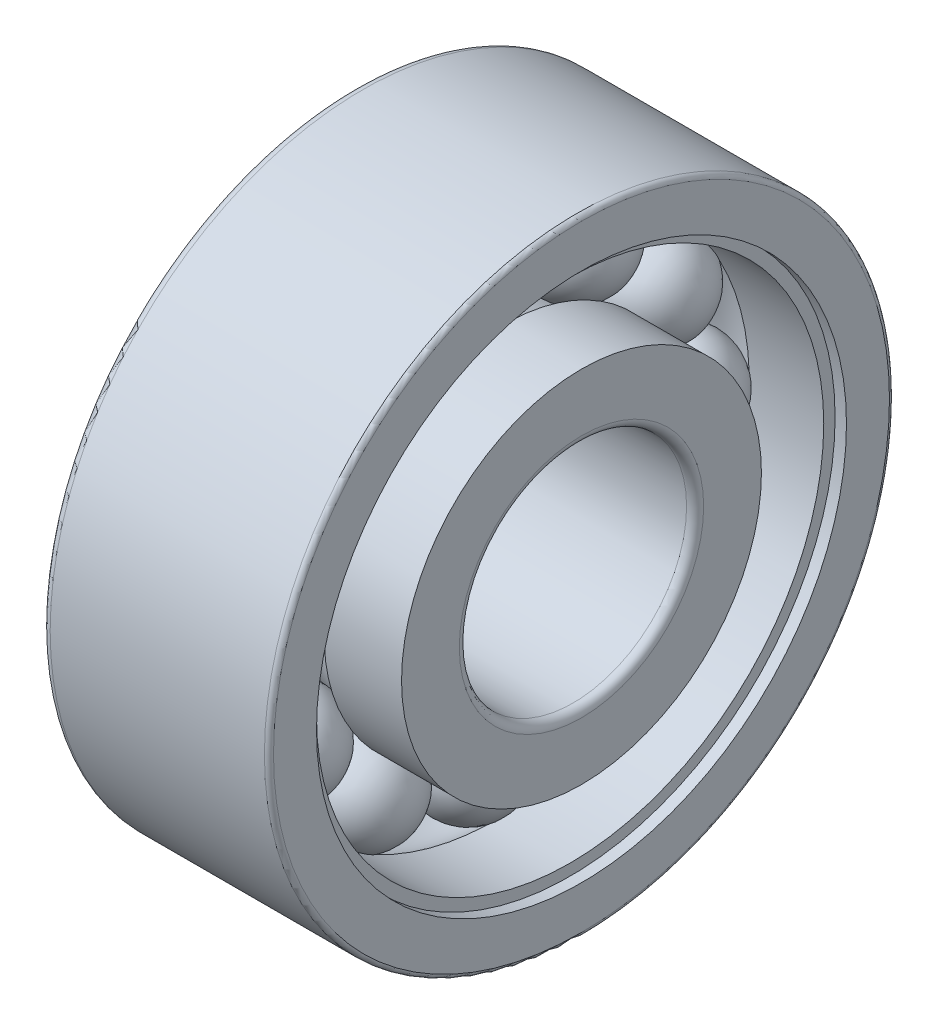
ISO-10303-21;
HEADER;
FILE_DESCRIPTION(('STEP AP214'),'2;1');
FILE_NAME('part.step','',(''),(''),'','','');
FILE_SCHEMA(('AUTOMOTIVE_DESIGN { 1 0 10303 214 1 1 1 1 }'));
ENDSEC;
DATA;
#1=APPLICATION_CONTEXT('core data for automotive mechanical design processes');
#2=APPLICATION_PROTOCOL_DEFINITION('international standard','automotive_design',2000,#1);
#3=PRODUCT_CONTEXT('',#1,'mechanical');
#4=PRODUCT('Part','Part','',(#3));
#5=PRODUCT_RELATED_PRODUCT_CATEGORY('part','',(#4));
#6=PRODUCT_DEFINITION_FORMATION('','',#4);
#7=PRODUCT_DEFINITION_CONTEXT('part definition',#1,'design');
#8=PRODUCT_DEFINITION('design','',#6,#7);
#9=PRODUCT_DEFINITION_SHAPE('','',#8);
#10=(LENGTH_UNIT() NAMED_UNIT(*) SI_UNIT(.MILLI.,.METRE.));
#11=(NAMED_UNIT(*) PLANE_ANGLE_UNIT() SI_UNIT($,.RADIAN.));
#12=(NAMED_UNIT(*) SI_UNIT($,.STERADIAN.) SOLID_ANGLE_UNIT());
#13=UNCERTAINTY_MEASURE_WITH_UNIT(LENGTH_MEASURE(1.E-05),#10,'distance_accuracy_value','');
#14=(GEOMETRIC_REPRESENTATION_CONTEXT(3) GLOBAL_UNCERTAINTY_ASSIGNED_CONTEXT((#13)) GLOBAL_UNIT_ASSIGNED_CONTEXT((#10,
#11,#12)) REPRESENTATION_CONTEXT('',''));
#15=CARTESIAN_POINT('',(0.,0.,0.));
#16=DIRECTION('',(0.,0.,1.));
#17=DIRECTION('',(1.,0.,0.));
#18=AXIS2_PLACEMENT_3D('',#15,#16,#17);
#19=CARTESIAN_POINT('',(0.,0.,0.));
#20=DIRECTION('',(-1.,0.,0.));
#21=DIRECTION('',(0.,0.,1.));
#22=AXIS2_PLACEMENT_3D('',#19,#20,#21);
#23=TOROIDAL_SURFACE('',#22,3.75,0.865000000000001);
#24=CARTESIAN_POINT('',(0.638707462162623,0.,0.));
#25=DIRECTION('',(-1.,0.,0.));
#26=DIRECTION('',(0.,0.,1.));
#27=AXIS2_PLACEMENT_3D('',#24,#25,#26);
#28=CIRCLE('',#27,3.16666666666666);
#29=CARTESIAN_POINT('',(0.638707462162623,3.16434666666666,-0.12119385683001));
#30=VERTEX_POINT('',#29);
#31=CARTESIAN_POINT('',(0.638707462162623,2.80100152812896,-1.4772163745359));
#32=VERTEX_POINT('',#31);
#33=EDGE_CURVE('E830',#30,#32,#28,.T.);
#34=ORIENTED_EDGE('',*,*,#33,.T.);
#35=CARTESIAN_POINT('',(0.638907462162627,2.80119333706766,-1.47732227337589));
#36=CARTESIAN_POINT('',(0.606136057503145,2.76969961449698,-1.45993434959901));
#37=CARTESIAN_POINT('',(0.570280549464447,2.74068118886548,-1.44391985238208));
#38=CARTESIAN_POINT('',(0.493563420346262,2.68831702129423,-1.41503021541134));
#39=CARTESIAN_POINT('',(0.45270590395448,2.66496667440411,-1.40215252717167));
#40=CARTESIAN_POINT('',(0.36706919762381,2.6245974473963,-1.37989408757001));
#41=CARTESIAN_POINT('',(0.322288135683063,2.60758161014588,-1.37051501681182));
#42=CARTESIAN_POINT('',(0.230106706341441,2.58037577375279,-1.35552138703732));
#43=CARTESIAN_POINT('',(0.182706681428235,2.57018488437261,-1.34990633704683));
#44=CARTESIAN_POINT('',(0.086629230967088,2.55691936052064,-1.34259752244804));
#45=CARTESIAN_POINT('',(0.0379519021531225,2.55384418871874,-1.34090346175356));
#46=CARTESIAN_POINT('',(-0.0593031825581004,2.55489581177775,-1.34148281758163));
#47=CARTESIAN_POINT('',(-0.107880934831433,2.55902286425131,-1.34375637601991));
#48=CARTESIAN_POINT('',(-0.203550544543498,2.57436084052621,-1.35220728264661));
#49=CARTESIAN_POINT('',(-0.25064252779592,2.58557116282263,-1.35838429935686));
#50=CARTESIAN_POINT('',(-0.342013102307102,2.61475551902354,-1.37446923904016));
#51=CARTESIAN_POINT('',(-0.386291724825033,2.63272947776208,-1.38437712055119));
#52=CARTESIAN_POINT('',(-0.467688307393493,2.67339120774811,-1.4067986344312));
#53=CARTESIAN_POINT('',(-0.505092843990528,2.6956410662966,-1.41907034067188));
#54=CARTESIAN_POINT('',(-0.57551375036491,2.7449510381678,-1.44627630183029));
#55=CARTESIAN_POINT('',(-0.608529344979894,2.77201199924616,-1.46121102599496));
#56=CARTESIAN_POINT('',(-0.638907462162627,2.80119333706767,-1.47732227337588));
#57=B_SPLINE_CURVE_WITH_KNOTS('',3,(#35,#36,#37,#38,#39,#40,#41,#42,#43,#44,#45,#46,#47,#48,#49,
#50,#51,#52,#53,#54,#55,#56),.UNSPECIFIED.,.F.,.F.,(4,2,2,2,2,2,2,2,2,2,4),(0.,
0.145797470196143,0.29147608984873,0.437224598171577,0.582954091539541,0.728672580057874,
0.874396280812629,1.02010760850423,1.16581731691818,1.30092953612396,1.43606558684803),.UNSPECIFIED.);
#58=CARTESIAN_POINT('',(-0.638707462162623,2.80100152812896,-1.47721637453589));
#59=VERTEX_POINT('',#58);
#60=EDGE_CURVE('E621',#32,#59,#57,.T.);
#61=ORIENTED_EDGE('',*,*,#60,.T.);
#62=CARTESIAN_POINT('',(-0.638707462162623,0.,0.));
#63=DIRECTION('',(-1.,0.,0.));
#64=DIRECTION('',(0.,0.,1.));
#65=AXIS2_PLACEMENT_3D('',#62,#63,#64);
#66=CIRCLE('',#65,3.16666666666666);
#67=CARTESIAN_POINT('',(-0.638707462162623,3.16434666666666,-0.12119385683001));
#68=VERTEX_POINT('',#67);
#69=EDGE_CURVE('E825',#68,#59,#66,.T.);
#70=ORIENTED_EDGE('',*,*,#69,.F.);
#71=CARTESIAN_POINT('',(0.638907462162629,3.16456572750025,-0.121198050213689));
#72=CARTESIAN_POINT('',(0.606136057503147,3.12859740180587,-0.120509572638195));
#73=CARTESIAN_POINT('',(0.57028054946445,3.09545945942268,-0.11986932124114));
#74=CARTESIAN_POINT('',(0.493563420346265,3.03566594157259,-0.118706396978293));
#75=CARTESIAN_POINT('',(0.452705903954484,3.00900510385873,-0.118183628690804));
#76=CARTESIAN_POINT('',(0.367069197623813,2.962915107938,-0.117275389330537));
#77=CARTESIAN_POINT('',(0.322288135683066,2.94348942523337,-0.116889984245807));
#78=CARTESIAN_POINT('',(0.230106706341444,2.91243166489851,-0.116271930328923));
#79=CARTESIAN_POINT('',(0.182706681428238,2.90079857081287,-0.116039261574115));
#80=CARTESIAN_POINT('',(0.086629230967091,2.88565588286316,-0.115736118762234));
#81=CARTESIAN_POINT('',(0.0379519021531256,2.88214567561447,-0.11566563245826));
#82=CARTESIAN_POINT('',(-0.0593031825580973,2.88334608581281,-0.11568970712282));
#83=CARTESIAN_POINT('',(-0.10788093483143,2.8880569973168,-0.115784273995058));
#84=CARTESIAN_POINT('',(-0.203550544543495,2.90556552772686,-0.116134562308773));
#85=CARTESIAN_POINT('',(-0.250642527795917,2.9183624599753,-0.116390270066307));
#86=CARTESIAN_POINT('',(-0.342013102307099,2.95167932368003,-0.117052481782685));
#87=CARTESIAN_POINT('',(-0.38629172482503,2.97219916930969,-0.117458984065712));
#88=CARTESIAN_POINT('',(-0.467688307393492,3.01862401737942,-0.118372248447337));
#89=CARTESIAN_POINT('',(-0.505092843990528,3.04402881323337,-0.118869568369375));
#90=CARTESIAN_POINT('',(-0.575513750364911,3.10033548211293,-0.119963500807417));
#91=CARTESIAN_POINT('',(-0.608529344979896,3.13123832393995,-0.120560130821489));
#92=CARTESIAN_POINT('',(-0.638907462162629,3.16456572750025,-0.121198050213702));
#93=B_SPLINE_CURVE_WITH_KNOTS('',3,(#71,#72,#73,#74,#75,#76,#77,#78,#79,#80,#81,#82,#83,#84,#85,
#86,#87,#88,#89,#90,#91,#92),.UNSPECIFIED.,.F.,.F.,(4,2,2,2,2,2,2,2,2,2,4),(0.,
0.145797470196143,0.29147608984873,0.437224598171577,0.582954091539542,0.728672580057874,
0.87439628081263,1.02010760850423,1.16581731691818,1.30092953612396,1.43606558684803),.UNSPECIFIED.);
#94=EDGE_CURVE('E477',#30,#68,#93,.T.);
#95=ORIENTED_EDGE('',*,*,#94,.F.);
#96=EDGE_LOOP('',(#34,#61,#70,#95));
#97=FACE_BOUND('',#96,.T.);
#98=ADVANCED_FACE('F32',(#97),#23,.F.);
#99=CARTESIAN_POINT('',(0.,0.,0.));
#100=DIRECTION('',(-1.,0.,0.));
#101=DIRECTION('',(0.,0.,1.));
#102=AXIS2_PLACEMENT_3D('',#99,#100,#101);
#103=TOROIDAL_SURFACE('',#102,3.75,0.865000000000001);
#104=CARTESIAN_POINT('',(0.489265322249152,0.,0.));
#105=DIRECTION('',(-1.,0.,0.));
#106=DIRECTION('',(0.,0.,1.));
#107=AXIS2_PLACEMENT_3D('',#104,#105,#106);
#108=CIRCLE('',#107,4.46333333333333);
#109=CARTESIAN_POINT('',(0.489265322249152,3.79140560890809,-2.35511951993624));
#110=VERTEX_POINT('',#109);
#111=CARTESIAN_POINT('',(0.489265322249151,2.35511951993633,-3.79140560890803));
#112=VERTEX_POINT('',#111);
#113=EDGE_CURVE('E359',#110,#112,#108,.T.);
#114=ORIENTED_EDGE('',*,*,#113,.F.);
#115=CARTESIAN_POINT('',(0.489465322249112,3.79128788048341,-2.3550489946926));
#116=CARTESIAN_POINT('',(0.449372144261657,3.81493859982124,-2.36921681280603));
#117=CARTESIAN_POINT('',(0.406920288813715,3.83562374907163,-2.38160600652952));
#118=CARTESIAN_POINT('',(0.318612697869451,3.87060453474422,-2.40255523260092));
#119=CARTESIAN_POINT('',(0.272759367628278,3.88490463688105,-2.41111794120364));
#120=CARTESIAN_POINT('',(0.178879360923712,3.9066967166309,-2.42416609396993));
#121=CARTESIAN_POINT('',(0.130851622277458,3.91418532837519,-2.42864952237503));
#122=CARTESIAN_POINT('',(0.0340269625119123,3.92213794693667,-2.43341073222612));
#123=CARTESIAN_POINT('',(-0.0147697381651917,3.92260393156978,-2.433689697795));
#124=CARTESIAN_POINT('',(-0.111753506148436,3.91650129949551,-2.43003609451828));
#125=CARTESIAN_POINT('',(-0.159940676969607,3.90993389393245,-2.42610425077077));
#126=CARTESIAN_POINT('',(-0.254373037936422,3.88994721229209,-2.41413730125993));
#127=CARTESIAN_POINT('',(-0.300617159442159,3.87652421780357,-2.40609996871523));
#128=CARTESIAN_POINT('',(-0.389848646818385,3.84320073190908,-2.3861439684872));
#129=CARTESIAN_POINT('',(-0.432833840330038,3.82329596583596,-2.37422273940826));
#130=CARTESIAN_POINT('',(-0.514228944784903,3.77760172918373,-2.34685077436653));
#131=CARTESIAN_POINT('',(-0.552647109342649,3.7518231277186,-2.3314065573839));
#132=CARTESIAN_POINT('',(-0.605848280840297,3.70949942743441,-2.30604419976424));
#133=CARTESIAN_POINT('',(-0.622754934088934,3.69488166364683,-2.2972836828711));
#134=CARTESIAN_POINT('',(-0.638907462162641,3.67969015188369,-2.28817824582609));
#135=B_SPLINE_CURVE_WITH_KNOTS('',3,(#115,#116,#117,#118,#119,#120,#121,#122,#123,#124,#125,
#126,#127,#128,#129,#130,#131,#132,#133,#134),.UNSPECIFIED.,.F.,.F.,(4,2,2,2,2,2,2,2,2,4),(0.,
0.145778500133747,0.29145488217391,0.437203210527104,0.582910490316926,0.728592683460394,
0.87435397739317,1.02021159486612,1.16580147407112,1.23772946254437),.UNSPECIFIED.);
#136=CARTESIAN_POINT('',(-0.638707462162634,3.67987807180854,-2.28829088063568));
#137=VERTEX_POINT('',#136);
#138=EDGE_CURVE('E55',#110,#137,#135,.T.);
#139=ORIENTED_EDGE('',*,*,#138,.T.);
#140=CARTESIAN_POINT('',(-0.638707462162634,0.,0.));
#141=DIRECTION('',(-1.,0.,0.));
#142=DIRECTION('',(0.,0.,1.));
#143=AXIS2_PLACEMENT_3D('',#140,#141,#142);
#144=CIRCLE('',#143,4.33333333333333);
#145=CARTESIAN_POINT('',(-0.638707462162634,2.28829088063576,-3.67987807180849));
#146=VERTEX_POINT('',#145);
#147=EDGE_CURVE('E818',#137,#146,#144,.T.);
#148=ORIENTED_EDGE('',*,*,#147,.T.);
#149=CARTESIAN_POINT('',(-0.638907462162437,2.28817824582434,-3.67969015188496));
#150=CARTESIAN_POINT('',(-0.606137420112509,2.30667132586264,-3.71054411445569));
#151=CARTESIAN_POINT('',(-0.570283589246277,2.32370609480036,-3.7389719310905));
#152=CARTESIAN_POINT('',(-0.493565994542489,2.35444137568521,-3.79027196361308));
#153=CARTESIAN_POINT('',(-0.452705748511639,2.36814420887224,-3.81314804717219));
#154=CARTESIAN_POINT('',(-0.367062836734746,2.39183081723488,-3.85269611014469));
#155=CARTESIAN_POINT('',(-0.322278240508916,2.40181274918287,-3.86936501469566));
#156=CARTESIAN_POINT('',(-0.230096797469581,2.41776933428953,-3.89601289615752));
#157=CARTESIAN_POINT('',(-0.182700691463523,2.42374511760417,-3.90599375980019));
#158=CARTESIAN_POINT('',(-0.0866378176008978,2.43152344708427,-3.91898553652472));
#159=CARTESIAN_POINT('',(-0.0379713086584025,2.43332683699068,-3.92199785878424));
#160=CARTESIAN_POINT('',(0.0592878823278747,2.4327115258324,-3.92097009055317));
#161=CARTESIAN_POINT('',(0.107880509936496,2.43029053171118,-3.9169261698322));
#162=CARTESIAN_POINT('',(0.203609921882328,2.42129010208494,-3.90189339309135));
#163=CARTESIAN_POINT('',(0.250745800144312,2.41470813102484,-3.89090030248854));
#164=CARTESIAN_POINT('',(0.342123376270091,2.39757522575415,-3.86228872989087));
#165=CARTESIAN_POINT('',(0.386370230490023,2.38703160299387,-3.8446824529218));
#166=CARTESIAN_POINT('',(0.44938888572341,2.36856618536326,-3.81385322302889));
#167=CARTESIAN_POINT('',(0.469717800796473,2.36201915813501,-3.80292326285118));
#168=CARTESIAN_POINT('',(0.489465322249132,2.35504899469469,-3.79128788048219));
#169=B_SPLINE_CURVE_WITH_KNOTS('',3,(#149,#150,#151,#152,#153,#154,#155,#156,#157,#158,#159,
#160,#161,#162,#163,#164,#165,#166,#167,#168),.UNSPECIFIED.,.F.,.F.,(4,2,2,2,2,2,2,2,2,4),(0.,
0.145787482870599,0.291473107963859,0.437230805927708,0.582947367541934,0.72863445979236,
0.874400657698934,1.02025576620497,1.16584300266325,1.23772936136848),.UNSPECIFIED.);
#170=EDGE_CURVE('E1718',#146,#112,#169,.T.);
#171=ORIENTED_EDGE('',*,*,#170,.T.);
#172=EDGE_LOOP('',(#114,#139,#148,#171));
#173=FACE_BOUND('',#172,.T.);
#174=ADVANCED_FACE('F932',(#173),#103,.F.);
#175=CARTESIAN_POINT('',(-0.638707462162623,2.67980767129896,-1.6871302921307));
#176=VERTEX_POINT('',#175);
#177=CARTESIAN_POINT('',(-0.638707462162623,1.68713029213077,-2.67980767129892));
#178=VERTEX_POINT('',#177);
#179=EDGE_CURVE('E829',#176,#178,#66,.T.);
#180=ORIENTED_EDGE('',*,*,#179,.F.);
#181=CARTESIAN_POINT('',(-0.638907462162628,2.67999528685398,-1.68724345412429));
#182=CARTESIAN_POINT('',(-0.606136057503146,2.64919004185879,-1.66866305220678));
#183=CARTESIAN_POINT('',(-0.570280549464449,2.62081186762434,-1.65153960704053));
#184=CARTESIAN_POINT('',(-0.493563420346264,2.56961062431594,-1.62063572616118));
#185=CARTESIAN_POINT('',(-0.452705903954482,2.54678304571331,-1.60685257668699));
#186=CARTESIAN_POINT('',(-0.367069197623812,2.50732205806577,-1.58302102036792));
#187=CARTESIAN_POINT('',(-0.322288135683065,2.49069162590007,-1.57297440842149));
#188=CARTESIAN_POINT('',(-0.230106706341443,2.46410384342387,-1.55691027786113));
#189=CARTESIAN_POINT('',(-0.182706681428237,2.4541456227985,-1.55089223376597));
#190=CARTESIAN_POINT('',(-0.0866292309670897,2.44118324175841,-1.54305836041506));
#191=CARTESIAN_POINT('',(-0.0379519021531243,2.43817855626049,-1.54124221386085));
#192=CARTESIAN_POINT('',(0.0593031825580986,2.43920610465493,-1.54186326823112));
#193=CARTESIAN_POINT('',(0.107880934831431,2.44323859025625,-1.54430062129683));
#194=CARTESIAN_POINT('',(0.203550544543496,2.45822627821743,-1.55335824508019));
#195=CARTESIAN_POINT('',(0.250642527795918,2.46918089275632,-1.55997816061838));
#196=CARTESIAN_POINT('',(0.3420131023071,2.49770303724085,-1.5772100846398));
#197=CARTESIAN_POINT('',(0.386291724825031,2.51527049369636,-1.58782204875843));
#198=CARTESIAN_POINT('',(0.467688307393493,2.55501895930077,-1.61182538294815));
#199=CARTESIAN_POINT('',(0.505092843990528,2.57677149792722,-1.62495847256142));
#200=CARTESIAN_POINT('',(0.57551375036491,2.62498753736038,-1.65405918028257));
#201=CARTESIAN_POINT('',(0.608529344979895,2.65145186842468,-1.67002729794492));
#202=CARTESIAN_POINT('',(0.638907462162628,2.67999528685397,-1.6872434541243));
#203=B_SPLINE_CURVE_WITH_KNOTS('',3,(#181,#182,#183,#184,#185,#186,#187,#188,#189,#190,#191,
#192,#193,#194,#195,#196,#197,#198,#199,#200,#201,#202),.UNSPECIFIED.,.F.,.F.,(4,2,2,2,2,2,2,2,
2,2,4),(0.,0.145797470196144,0.29147608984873,0.437224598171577,0.582954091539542,
0.728672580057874,0.87439628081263,1.02010760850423,1.16581731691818,1.30092953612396,
1.43606558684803),.UNSPECIFIED.);
#204=CARTESIAN_POINT('',(0.638707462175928,2.67980767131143,-1.68713029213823));
#205=VERTEX_POINT('',#204);
#206=EDGE_CURVE('E47',#176,#205,#203,.T.);
#207=ORIENTED_EDGE('',*,*,#206,.T.);
#208=CARTESIAN_POINT('',(0.638707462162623,1.68713029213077,-2.67980767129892));
#209=VERTEX_POINT('',#208);
#210=EDGE_CURVE('E834',#205,#209,#28,.T.);
#211=ORIENTED_EDGE('',*,*,#210,.T.);
#212=CARTESIAN_POINT('',(0.638907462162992,1.68724345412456,-2.67999528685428));
#213=CARTESIAN_POINT('',(0.606136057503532,1.66866305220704,-2.64919004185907));
#214=CARTESIAN_POINT('',(0.570280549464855,1.65153960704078,-2.6208118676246));
#215=CARTESIAN_POINT('',(0.493563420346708,1.62063572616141,-2.56961062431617));
#216=CARTESIAN_POINT('',(0.452705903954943,1.6068525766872,-2.54678304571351));
#217=CARTESIAN_POINT('',(0.367069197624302,1.5830210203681,-2.50732205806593));
#218=CARTESIAN_POINT('',(0.322288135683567,1.57297440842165,-2.49069162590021));
#219=CARTESIAN_POINT('',(0.230106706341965,1.55691027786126,-2.46410384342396));
#220=CARTESIAN_POINT('',(0.182706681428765,1.55089223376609,-2.45414562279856));
#221=CARTESIAN_POINT('',(0.086629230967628,1.54305836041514,-2.44118324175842));
#222=CARTESIAN_POINT('',(0.0379519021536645,1.54124221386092,-2.43817855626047));
#223=CARTESIAN_POINT('',(-0.0593031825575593,1.54186326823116,-2.43920610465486));
#224=CARTESIAN_POINT('',(-0.107880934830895,1.54430062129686,-2.44323859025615));
#225=CARTESIAN_POINT('',(-0.203550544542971,1.55335824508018,-2.45822627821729));
#226=CARTESIAN_POINT('',(-0.250642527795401,1.55997816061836,-2.46918089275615));
#227=CARTESIAN_POINT('',(-0.342013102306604,1.57721008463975,-2.49770303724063));
#228=CARTESIAN_POINT('',(-0.386291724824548,1.58782204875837,-2.51527049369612));
#229=CARTESIAN_POINT('',(-0.467688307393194,1.61182538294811,-2.55501895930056));
#230=CARTESIAN_POINT('',(-0.505092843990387,1.62495847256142,-2.57677149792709));
#231=CARTESIAN_POINT('',(-0.57551375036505,1.65405918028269,-2.62498753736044));
#232=CARTESIAN_POINT('',(-0.608529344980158,1.67002729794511,-2.65145186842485));
#233=CARTESIAN_POINT('',(-0.638907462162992,1.68724345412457,-2.67999528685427));
#234=B_SPLINE_CURVE_WITH_KNOTS('',3,(#212,#213,#214,#215,#216,#217,#218,#219,#220,#221,#222,
#223,#224,#225,#226,#227,#228,#229,#230,#231,#232,#233),.UNSPECIFIED.,.F.,.F.,(4,2,2,2,2,2,2,2,
2,2,4),(0.,0.145797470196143,0.29147608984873,0.437224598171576,0.582954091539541,
0.728672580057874,0.87439628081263,1.02010760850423,1.16581731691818,1.3009295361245,
1.43606558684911),.UNSPECIFIED.);
#235=EDGE_CURVE('E610',#209,#178,#234,.T.);
#236=ORIENTED_EDGE('',*,*,#235,.T.);
#237=EDGE_LOOP('',(#180,#207,#211,#236));
#238=FACE_BOUND('',#237,.T.);
#239=ADVANCED_FACE('F933',(#238),#23,.F.);
#240=CARTESIAN_POINT('',(0.489265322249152,2.10589381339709,-3.93529613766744));
#241=VERTEX_POINT('',#240);
#242=CARTESIAN_POINT('',(0.489265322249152,0.143890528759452,-4.46101333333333));
#243=VERTEX_POINT('',#242);
#244=EDGE_CURVE('E364',#241,#243,#108,.T.);
#245=ORIENTED_EDGE('',*,*,#244,.F.);
#246=CARTESIAN_POINT('',(0.489465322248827,2.10582712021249,-3.93517619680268));
#247=CARTESIAN_POINT('',(0.449372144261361,2.11922533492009,-3.959271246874));
#248=CARTESIAN_POINT('',(0.406920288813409,2.13094460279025,-3.98034317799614));
#249=CARTESIAN_POINT('',(0.318612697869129,2.15076423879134,-4.01597613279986));
#250=CARTESIAN_POINT('',(0.27275936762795,2.15886713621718,-4.03054170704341));
#251=CARTESIAN_POINT('',(0.178879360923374,2.17121555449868,-4.05273777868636));
#252=CARTESIAN_POINT('',(0.130851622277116,2.17545916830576,-4.06036484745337));
#253=CARTESIAN_POINT('',(0.0340269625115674,2.17996573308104,-4.06846448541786));
#254=CARTESIAN_POINT('',(-0.0147697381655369,2.18022980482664,-4.06893906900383));
#255=CARTESIAN_POINT('',(-0.111753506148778,2.17677157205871,-4.06272363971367));
#256=CARTESIAN_POINT('',(-0.159940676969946,2.17304995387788,-4.05603486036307));
#257=CARTESIAN_POINT('',(-0.254373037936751,2.16172445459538,-4.03567783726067));
#258=CARTESIAN_POINT('',(-0.300617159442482,2.15411846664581,-4.02200580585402));
#259=CARTESIAN_POINT('',(-0.389848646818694,2.13523748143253,-3.98806165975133));
#260=CARTESIAN_POINT('',(-0.432833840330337,2.12396006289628,-3.96778518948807));
#261=CARTESIAN_POINT('',(-0.514228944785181,2.09807367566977,-3.92123325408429));
#262=CARTESIAN_POINT('',(-0.552647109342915,2.08347086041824,-3.89496886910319));
#263=CARTESIAN_POINT('',(-0.605848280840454,2.05949863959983,-3.85184257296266));
#264=CARTESIAN_POINT('',(-0.622754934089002,2.05121954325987,-3.8369468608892));
#265=CARTESIAN_POINT('',(-0.638907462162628,2.04261602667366,-3.82146556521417));
#266=B_SPLINE_CURVE_WITH_KNOTS('',3,(#246,#247,#248,#249,#250,#251,#252,#253,#254,#255,#256,
#257,#258,#259,#260,#261,#262,#263,#264,#265),.UNSPECIFIED.,.F.,.F.,(4,2,2,2,2,2,2,2,2,4),(0.,
0.145778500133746,0.291454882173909,0.437203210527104,0.582910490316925,0.728592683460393,
0.874353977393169,1.02021159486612,1.16580147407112,1.237729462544),.UNSPECIFIED.);
#267=CARTESIAN_POINT('',(-0.638707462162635,2.04272245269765,-3.82165706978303));
#268=VERTEX_POINT('',#267);
#269=EDGE_CURVE('E736',#241,#268,#266,.T.);
#270=ORIENTED_EDGE('',*,*,#269,.T.);
#271=CARTESIAN_POINT('',(-0.638707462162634,0.141778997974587,-4.33101333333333));
#272=VERTEX_POINT('',#271);
#273=EDGE_CURVE('E816',#268,#272,#144,.T.);
#274=ORIENTED_EDGE('',*,*,#273,.T.);
#275=CARTESIAN_POINT('',(-0.6389074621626,0.141775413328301,-4.33079427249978));
#276=CARTESIAN_POINT('',(-0.606137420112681,0.142363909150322,-4.36676112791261));
#277=CARTESIAN_POINT('',(-0.570283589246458,0.142902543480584,-4.39989772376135));
#278=CARTESIAN_POINT('',(-0.493565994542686,0.143870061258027,-4.45969249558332));
#279=CARTESIAN_POINT('',(-0.452705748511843,0.144299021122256,-4.48635518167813));
#280=CARTESIAN_POINT('',(-0.367062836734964,0.145038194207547,-4.53244811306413));
#281=CARTESIAN_POINT('',(-0.322278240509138,0.145348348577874,-4.55187477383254));
#282=CARTESIAN_POINT('',(-0.230096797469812,0.145843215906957,-4.58293080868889));
#283=CARTESIAN_POINT('',(-0.182700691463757,0.146027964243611,-4.5945623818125));
#284=CARTESIAN_POINT('',(-0.086637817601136,0.146268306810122,-4.60970275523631));
#285=CARTESIAN_POINT('',(-0.0379713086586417,0.146323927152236,-4.61321319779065));
#286=CARTESIAN_POINT('',(0.0592878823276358,0.146304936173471,-4.61201546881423));
#287=CARTESIAN_POINT('',(0.107880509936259,0.146230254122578,-4.60730283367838));
#288=CARTESIAN_POINT('',(0.203609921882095,0.1459520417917,-4.5897838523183));
#289=CARTESIAN_POINT('',(0.250745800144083,0.145748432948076,-4.57697257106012));
#290=CARTESIAN_POINT('',(0.342123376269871,0.14521668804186,-4.543627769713));
#291=CARTESIAN_POINT('',(0.386370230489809,0.144888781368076,-4.52310847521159));
#292=CARTESIAN_POINT('',(0.449388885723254,0.144311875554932,-4.4871768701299));
#293=CARTESIAN_POINT('',(0.469717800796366,0.144106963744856,-4.4744377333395));
#294=CARTESIAN_POINT('',(0.489465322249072,0.143888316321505,-4.46087611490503));
#295=B_SPLINE_CURVE_WITH_KNOTS('',3,(#275,#276,#277,#278,#279,#280,#281,#282,#283,#284,#285,
#286,#287,#288,#289,#290,#291,#292,#293,#294),.UNSPECIFIED.,.F.,.F.,(4,2,2,2,2,2,2,2,2,4),(0.,
0.145787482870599,0.29147310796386,0.437230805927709,0.582947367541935,0.728634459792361,
0.874400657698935,1.02025576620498,1.16584300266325,1.23772936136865),.UNSPECIFIED.);
#296=EDGE_CURVE('E757',#272,#243,#295,.T.);
#297=ORIENTED_EDGE('',*,*,#296,.T.);
#298=EDGE_LOOP('',(#245,#270,#274,#297));
#299=FACE_BOUND('',#298,.T.);
#300=ADVANCED_FACE('F938',(#299),#103,.F.);
#301=CARTESIAN_POINT('',(-0.638707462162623,1.47721637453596,-2.80100152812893));
#302=VERTEX_POINT('',#301);
#303=CARTESIAN_POINT('',(-0.638707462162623,0.121193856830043,-3.16434666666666));
#304=VERTEX_POINT('',#303);
#305=EDGE_CURVE('E924',#302,#304,#66,.T.);
#306=ORIENTED_EDGE('',*,*,#305,.F.);
#307=CARTESIAN_POINT('',(-0.638907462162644,1.47732227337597,-2.80119333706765));
#308=CARTESIAN_POINT('',(-0.606136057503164,1.45993434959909,-2.76969961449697));
#309=CARTESIAN_POINT('',(-0.570280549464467,1.44391985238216,-2.74068118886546));
#310=CARTESIAN_POINT('',(-0.493563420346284,1.41503021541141,-2.68831702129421));
#311=CARTESIAN_POINT('',(-0.452705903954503,1.40215252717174,-2.66496667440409));
#312=CARTESIAN_POINT('',(-0.367069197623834,1.37989408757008,-2.62459744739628));
#313=CARTESIAN_POINT('',(-0.322288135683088,1.37051501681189,-2.60758161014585));
#314=CARTESIAN_POINT('',(-0.230106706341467,1.35552138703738,-2.58037577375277));
#315=CARTESIAN_POINT('',(-0.182706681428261,1.34990633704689,-2.57018488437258));
#316=CARTESIAN_POINT('',(-0.0866292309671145,1.3425975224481,-2.55691936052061));
#317=CARTESIAN_POINT('',(-0.0379519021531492,1.34090346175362,-2.55384418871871));
#318=CARTESIAN_POINT('',(0.0593031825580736,1.34148281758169,-2.55489581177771));
#319=CARTESIAN_POINT('',(0.107880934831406,1.34375637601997,-2.55902286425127));
#320=CARTESIAN_POINT('',(0.203550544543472,1.35220728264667,-2.57436084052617));
#321=CARTESIAN_POINT('',(0.250642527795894,1.35838429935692,-2.58557116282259));
#322=CARTESIAN_POINT('',(0.342013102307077,1.37446923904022,-2.61475551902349));
#323=CARTESIAN_POINT('',(0.386291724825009,1.38437712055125,-2.63272947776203));
#324=CARTESIAN_POINT('',(0.467688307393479,1.40679863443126,-2.67339120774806));
#325=CARTESIAN_POINT('',(0.505092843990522,1.41907034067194,-2.69564106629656));
#326=CARTESIAN_POINT('',(0.575513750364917,1.44627630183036,-2.74495103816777));
#327=CARTESIAN_POINT('',(0.608529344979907,1.46121102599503,-2.77201199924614));
#328=CARTESIAN_POINT('',(0.638907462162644,1.47732227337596,-2.80119333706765));
#329=B_SPLINE_CURVE_WITH_KNOTS('',3,(#307,#308,#309,#310,#311,#312,#313,#314,#315,#316,#317,
#318,#319,#320,#321,#322,#323,#324,#325,#326,#327,#328),.UNSPECIFIED.,.F.,.F.,(4,2,2,2,2,2,2,2,
2,2,4),(0.,0.145797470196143,0.29147608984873,0.437224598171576,0.582954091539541,
0.728672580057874,0.874396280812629,1.02010760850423,1.16581731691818,1.30092953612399,
1.43606558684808),.UNSPECIFIED.);
#330=CARTESIAN_POINT('',(0.638707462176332,1.47721637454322,-2.80100152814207));
#331=VERTEX_POINT('',#330);
#332=EDGE_CURVE('E603',#302,#331,#329,.T.);
#333=ORIENTED_EDGE('',*,*,#332,.T.);
#334=CARTESIAN_POINT('',(0.638707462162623,0.121193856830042,-3.16434666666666));
#335=VERTEX_POINT('',#334);
#336=EDGE_CURVE('E1049',#331,#335,#28,.T.);
#337=ORIENTED_EDGE('',*,*,#336,.T.);
#338=CARTESIAN_POINT('',(0.638907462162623,0.121198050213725,-3.16456572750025));
#339=CARTESIAN_POINT('',(0.606136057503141,0.120509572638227,-3.12859740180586));
#340=CARTESIAN_POINT('',(0.570280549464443,0.119869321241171,-3.09545945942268));
#341=CARTESIAN_POINT('',(0.493563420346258,0.118706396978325,-3.03566594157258));
#342=CARTESIAN_POINT('',(0.452705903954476,0.118183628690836,-3.00900510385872));
#343=CARTESIAN_POINT('',(0.367069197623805,0.11727538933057,-2.96291510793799));
#344=CARTESIAN_POINT('',(0.322288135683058,0.116889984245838,-2.94348942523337));
#345=CARTESIAN_POINT('',(0.230106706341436,0.116271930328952,-2.9124316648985));
#346=CARTESIAN_POINT('',(0.182706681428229,0.116039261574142,-2.90079857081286));
#347=CARTESIAN_POINT('',(0.0866292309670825,0.115736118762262,-2.88565588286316));
#348=CARTESIAN_POINT('',(0.0379519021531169,0.115665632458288,-2.88214567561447));
#349=CARTESIAN_POINT('',(-0.059303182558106,0.115689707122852,-2.88334608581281));
#350=CARTESIAN_POINT('',(-0.107880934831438,0.115784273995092,-2.8880569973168));
#351=CARTESIAN_POINT('',(-0.203550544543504,0.116134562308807,-2.90556552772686));
#352=CARTESIAN_POINT('',(-0.250642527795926,0.116390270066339,-2.9183624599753));
#353=CARTESIAN_POINT('',(-0.342013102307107,0.117052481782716,-2.95167932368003));
#354=CARTESIAN_POINT('',(-0.386291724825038,0.117458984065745,-2.97219916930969));
#355=CARTESIAN_POINT('',(-0.467688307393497,0.11837224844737,-3.01862401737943));
#356=CARTESIAN_POINT('',(-0.50509284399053,0.118869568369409,-3.04402881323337));
#357=CARTESIAN_POINT('',(-0.575513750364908,0.119963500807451,-3.10033548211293));
#358=CARTESIAN_POINT('',(-0.608529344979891,0.120560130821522,-3.13123832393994));
#359=CARTESIAN_POINT('',(-0.638907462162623,0.121198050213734,-3.16456572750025));
#360=B_SPLINE_CURVE_WITH_KNOTS('',3,(#338,#339,#340,#341,#342,#343,#344,#345,#346,#347,#348,
#349,#350,#351,#352,#353,#354,#355,#356,#357,#358,#359),.UNSPECIFIED.,.F.,.F.,(4,2,2,2,2,2,2,2,
2,2,4),(0.,0.145797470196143,0.29147608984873,0.437224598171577,0.582954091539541,
0.728672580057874,0.874396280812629,1.02010760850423,1.16581731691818,1.30092953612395,
1.43606558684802),.UNSPECIFIED.);
#361=EDGE_CURVE('E596',#335,#304,#360,.T.);
#362=ORIENTED_EDGE('',*,*,#361,.T.);
#363=EDGE_LOOP('',(#306,#333,#337,#362));
#364=FACE_BOUND('',#363,.T.);
#365=ADVANCED_FACE('F940',(#364),#23,.F.);
#366=CARTESIAN_POINT('',(0.489265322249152,-0.143890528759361,-4.46101333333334));
#367=VERTEX_POINT('',#366);
#368=CARTESIAN_POINT('',(0.489265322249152,-2.10589381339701,-3.93529613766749));
#369=VERTEX_POINT('',#368);
#370=EDGE_CURVE('E809',#367,#369,#108,.T.);
#371=ORIENTED_EDGE('',*,*,#370,.F.);
#372=CARTESIAN_POINT('',(0.489465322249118,-0.143888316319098,-4.46087611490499));
#373=CARTESIAN_POINT('',(0.449372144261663,-0.144332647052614,-4.48844214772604));
#374=CARTESIAN_POINT('',(0.406920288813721,-0.144719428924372,-4.5125506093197));
#375=CARTESIAN_POINT('',(0.318612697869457,-0.145371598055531,-4.5533194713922));
#376=CARTESIAN_POINT('',(0.272759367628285,-0.145637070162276,-4.56998507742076));
#377=CARTESIAN_POINT('',(0.178879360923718,-0.146041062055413,-4.59538164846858));
#378=CARTESIAN_POINT('',(0.130851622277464,-0.146179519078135,-4.60410869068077));
#379=CARTESIAN_POINT('',(0.0340269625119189,-0.146326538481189,-4.61337646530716));
#380=CARTESIAN_POINT('',(-0.0147697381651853,-0.146335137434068,-4.61391950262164));
#381=CARTESIAN_POINT('',(-0.111753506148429,-0.146222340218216,-4.60680766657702));
#382=CARTESIAN_POINT('',(-0.159940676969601,-0.14610096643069,-4.59915420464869));
#383=CARTESIAN_POINT('',(-0.254373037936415,-0.145730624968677,-4.57586175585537));
#384=CARTESIAN_POINT('',(-0.300617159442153,-0.145481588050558,-4.56021843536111));
#385=CARTESIAN_POINT('',(-0.38984864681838,-0.144860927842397,-4.52138144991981));
#386=CARTESIAN_POINT('',(-0.432833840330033,-0.144489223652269,-4.49818280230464));
#387=CARTESIAN_POINT('',(-0.514228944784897,-0.143631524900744,-4.4449244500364));
#388=CARTESIAN_POINT('',(-0.552647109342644,-0.14314574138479,-4.41487741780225));
#389=CARTESIAN_POINT('',(-0.605848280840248,-0.142343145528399,-4.36554283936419));
#390=CARTESIAN_POINT('',(-0.622754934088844,-0.142065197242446,-4.34850322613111));
#391=CARTESIAN_POINT('',(-0.638907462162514,-0.141775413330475,-4.33079427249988));
#392=B_SPLINE_CURVE_WITH_KNOTS('',3,(#372,#373,#374,#375,#376,#377,#378,#379,#380,#381,#382,
#383,#384,#385,#386,#387,#388,#389,#390,#391),.UNSPECIFIED.,.F.,.F.,(4,2,2,2,2,2,2,2,2,4),(0.,
0.145778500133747,0.291454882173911,0.437203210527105,0.582910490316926,0.728592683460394,
0.87435397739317,1.02021159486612,1.16580147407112,1.23772946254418),.UNSPECIFIED.);
#393=CARTESIAN_POINT('',(-0.638707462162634,-0.141778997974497,-4.33101333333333));
#394=VERTEX_POINT('',#393);
#395=EDGE_CURVE('E761',#367,#394,#392,.T.);
#396=ORIENTED_EDGE('',*,*,#395,.T.);
#397=CARTESIAN_POINT('',(-0.638707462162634,-2.04272245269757,-3.82165706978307));
#398=VERTEX_POINT('',#397);
#399=EDGE_CURVE('E807',#394,#398,#144,.T.);
#400=ORIENTED_EDGE('',*,*,#399,.T.);
#401=CARTESIAN_POINT('',(-0.638907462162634,-2.04261602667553,-3.82146556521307));
#402=CARTESIAN_POINT('',(-0.606137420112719,-2.06008980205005,-3.85290802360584));
#403=CARTESIAN_POINT('',(-0.570283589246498,-2.07619162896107,-3.88187447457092));
#404=CARTESIAN_POINT('',(-0.493565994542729,-2.10525111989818,-3.93414202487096));
#405=CARTESIAN_POINT('',(-0.452705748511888,-2.11821097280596,-3.95744706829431));
#406=CARTESIAN_POINT('',(-0.367062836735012,-2.14061729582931,-3.99773430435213));
#407=CARTESIAN_POINT('',(-0.322278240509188,-2.15006202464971,-4.01471336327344));
#408=CARTESIAN_POINT('',(-0.230096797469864,-2.1651614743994,-4.0418561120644));
#409=CARTESIAN_POINT('',(-0.182700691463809,-2.17081726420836,-4.05202172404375));
#410=CARTESIAN_POINT('',(-0.0866378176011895,-2.17817930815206,-4.06525384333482));
#411=CARTESIAN_POINT('',(-0.0379713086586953,-2.17988636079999,-4.06832178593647));
#412=CARTESIAN_POINT('',(0.0592878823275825,-2.17930394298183,-4.06727502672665));
#413=CARTESIAN_POINT('',(0.107880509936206,-2.1770123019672,-4.0631564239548));
#414=CARTESIAN_POINT('',(0.203609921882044,-2.16849375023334,-4.04784543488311));
#415=CARTESIAN_POINT('',(0.250745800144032,-2.16226444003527,-4.03664873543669));
#416=CARTESIAN_POINT('',(0.342123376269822,-2.14605254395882,-4.00750541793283));
#417=CARTESIAN_POINT('',(0.386370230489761,-2.13607687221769,-3.98957123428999));
#418=CARTESIAN_POINT('',(0.449388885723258,-2.11861068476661,-3.95816509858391));
#419=CARTESIAN_POINT('',(0.469717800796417,-2.11241857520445,-3.94703022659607));
#420=CARTESIAN_POINT('',(0.489465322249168,-2.10582712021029,-3.93517619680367));
#421=B_SPLINE_CURVE_WITH_KNOTS('',3,(#401,#402,#403,#404,#405,#406,#407,#408,#409,#410,#411,
#412,#413,#414,#415,#416,#417,#418,#419,#420),.UNSPECIFIED.,.F.,.F.,(4,2,2,2,2,2,2,2,2,4),(0.,
0.145787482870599,0.291473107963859,0.437230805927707,0.582947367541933,0.728634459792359,
0.874400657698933,1.02025576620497,1.16584300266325,1.23772936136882),.UNSPECIFIED.);
#422=EDGE_CURVE('E1059',#398,#369,#421,.T.);
#423=ORIENTED_EDGE('',*,*,#422,.T.);
#424=EDGE_LOOP('',(#371,#396,#400,#423));
#425=FACE_BOUND('',#424,.T.);
#426=ADVANCED_FACE('F805',(#425),#103,.F.);
#427=CARTESIAN_POINT('',(-0.638707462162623,-0.121193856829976,-3.16434666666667));
#428=VERTEX_POINT('',#427);
#429=CARTESIAN_POINT('',(-0.638707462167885,-1.47721637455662,-2.80100152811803));
#430=VERTEX_POINT('',#429);
#431=EDGE_CURVE('E920',#428,#430,#66,.T.);
#432=ORIENTED_EDGE('',*,*,#431,.F.);
#433=CARTESIAN_POINT('',(-0.638907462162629,-0.121198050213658,-3.16456572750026));
#434=CARTESIAN_POINT('',(-0.606136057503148,-0.120509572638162,-3.12859740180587));
#435=CARTESIAN_POINT('',(-0.57028054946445,-0.119869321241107,-3.09545945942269));
#436=CARTESIAN_POINT('',(-0.493563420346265,-0.118706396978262,-3.03566594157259));
#437=CARTESIAN_POINT('',(-0.452705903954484,-0.118183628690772,-3.00900510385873));
#438=CARTESIAN_POINT('',(-0.367069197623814,-0.117275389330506,-2.962915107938));
#439=CARTESIAN_POINT('',(-0.322288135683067,-0.116889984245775,-2.94348942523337));
#440=CARTESIAN_POINT('',(-0.230106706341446,-0.116271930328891,-2.91243166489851));
#441=CARTESIAN_POINT('',(-0.182706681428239,-0.116039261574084,-2.90079857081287));
#442=CARTESIAN_POINT('',(-0.0866292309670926,-0.115736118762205,-2.88565588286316));
#443=CARTESIAN_POINT('',(-0.0379519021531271,-0.115665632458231,-2.88214567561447));
#444=CARTESIAN_POINT('',(0.0593031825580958,-0.115689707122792,-2.88334608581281));
#445=CARTESIAN_POINT('',(0.107880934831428,-0.115784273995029,-2.8880569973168));
#446=CARTESIAN_POINT('',(0.203550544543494,-0.116134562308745,-2.90556552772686));
#447=CARTESIAN_POINT('',(0.250642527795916,-0.116390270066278,-2.9183624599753));
#448=CARTESIAN_POINT('',(0.342013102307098,-0.117052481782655,-2.95167932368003));
#449=CARTESIAN_POINT('',(0.386291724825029,-0.117458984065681,-2.97219916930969));
#450=CARTESIAN_POINT('',(0.467688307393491,-0.118372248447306,-3.01862401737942));
#451=CARTESIAN_POINT('',(0.505092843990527,-0.118869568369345,-3.04402881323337));
#452=CARTESIAN_POINT('',(0.57551375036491,-0.119963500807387,-3.10033548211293));
#453=CARTESIAN_POINT('',(0.608529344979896,-0.120560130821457,-3.13123832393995));
#454=CARTESIAN_POINT('',(0.638907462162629,-0.121198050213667,-3.16456572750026));
#455=B_SPLINE_CURVE_WITH_KNOTS('',3,(#433,#434,#435,#436,#437,#438,#439,#440,#441,#442,#443,
#444,#445,#446,#447,#448,#449,#450,#451,#452,#453,#454),.UNSPECIFIED.,.F.,.F.,(4,2,2,2,2,2,2,2,
2,2,4),(0.,0.145797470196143,0.291476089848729,0.437224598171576,0.582954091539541,
0.728672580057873,0.874396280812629,1.02010760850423,1.16581731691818,1.30092953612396,
1.43606558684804),.UNSPECIFIED.);
#456=CARTESIAN_POINT('',(0.638707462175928,-0.121193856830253,-3.16434666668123));
#457=VERTEX_POINT('',#456);
#458=EDGE_CURVE('E588',#428,#457,#455,.T.);
#459=ORIENTED_EDGE('',*,*,#458,.T.);
#460=CARTESIAN_POINT('',(0.638707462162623,-1.4772163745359,-2.80100152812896));
#461=VERTEX_POINT('',#460);
#462=EDGE_CURVE('E1044',#457,#461,#28,.T.);
#463=ORIENTED_EDGE('',*,*,#462,.T.);
#464=CARTESIAN_POINT('',(0.638907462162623,-1.4773222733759,-2.80119333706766));
#465=CARTESIAN_POINT('',(0.606136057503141,-1.45993434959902,-2.76969961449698));
#466=CARTESIAN_POINT('',(0.570280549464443,-1.44391985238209,-2.74068118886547));
#467=CARTESIAN_POINT('',(0.493563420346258,-1.41503021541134,-2.68831702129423));
#468=CARTESIAN_POINT('',(0.452705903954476,-1.40215252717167,-2.6649666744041));
#469=CARTESIAN_POINT('',(0.367069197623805,-1.37989408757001,-2.6245974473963));
#470=CARTESIAN_POINT('',(0.322288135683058,-1.37051501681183,-2.60758161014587));
#471=CARTESIAN_POINT('',(0.230106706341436,-1.35552138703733,-2.58037577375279));
#472=CARTESIAN_POINT('',(0.18270668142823,-1.34990633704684,-2.5701848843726));
#473=CARTESIAN_POINT('',(0.086629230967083,-1.34259752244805,-2.55691936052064));
#474=CARTESIAN_POINT('',(0.0379519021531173,-1.34090346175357,-2.55384418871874));
#475=CARTESIAN_POINT('',(-0.0593031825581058,-1.34148281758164,-2.55489581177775));
#476=CARTESIAN_POINT('',(-0.107880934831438,-1.34375637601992,-2.5590228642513));
#477=CARTESIAN_POINT('',(-0.203550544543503,-1.35220728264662,-2.57436084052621));
#478=CARTESIAN_POINT('',(-0.250642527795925,-1.35838429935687,-2.58557116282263));
#479=CARTESIAN_POINT('',(-0.342013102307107,-1.37446923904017,-2.61475551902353));
#480=CARTESIAN_POINT('',(-0.386291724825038,-1.3843771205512,-2.63272947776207));
#481=CARTESIAN_POINT('',(-0.467688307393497,-1.40679863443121,-2.6733912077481));
#482=CARTESIAN_POINT('',(-0.50509284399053,-1.41907034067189,-2.69564106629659));
#483=CARTESIAN_POINT('',(-0.575513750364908,-1.4462763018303,-2.74495103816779));
#484=CARTESIAN_POINT('',(-0.608529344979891,-1.46121102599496,-2.77201199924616));
#485=CARTESIAN_POINT('',(-0.638907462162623,-1.47732227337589,-2.80119333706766));
#486=B_SPLINE_CURVE_WITH_KNOTS('',3,(#464,#465,#466,#467,#468,#469,#470,#471,#472,#473,#474,
#475,#476,#477,#478,#479,#480,#481,#482,#483,#484,#485),.UNSPECIFIED.,.F.,.F.,(4,2,2,2,2,2,2,2,
2,2,4),(0.,0.145797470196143,0.29147608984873,0.437224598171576,0.582954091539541,
0.728672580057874,0.87439628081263,1.02010760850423,1.16581731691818,1.30092953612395,
1.43606558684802),.UNSPECIFIED.);
#487=EDGE_CURVE('E581',#461,#430,#486,.T.);
#488=ORIENTED_EDGE('',*,*,#487,.T.);
#489=EDGE_LOOP('',(#432,#459,#463,#488));
#490=FACE_BOUND('',#489,.T.);
#491=ADVANCED_FACE('F946',(#490),#23,.F.);
#492=CARTESIAN_POINT('',(0.489265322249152,-2.35511951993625,-3.79140560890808));
#493=VERTEX_POINT('',#492);
#494=CARTESIAN_POINT('',(0.489265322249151,-3.79140560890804,-2.35511951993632));
#495=VERTEX_POINT('',#494);
#496=EDGE_CURVE('E1713',#493,#495,#108,.T.);
#497=ORIENTED_EDGE('',*,*,#496,.F.);
#498=CARTESIAN_POINT('',(0.489465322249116,-2.35504899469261,-3.79128788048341));
#499=CARTESIAN_POINT('',(0.449372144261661,-2.36921681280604,-3.81493859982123));
#500=CARTESIAN_POINT('',(0.40692028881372,-2.38160600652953,-3.83562374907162));
#501=CARTESIAN_POINT('',(0.318612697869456,-2.40255523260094,-3.87060453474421));
#502=CARTESIAN_POINT('',(0.272759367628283,-2.41111794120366,-3.88490463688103));
#503=CARTESIAN_POINT('',(0.178879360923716,-2.42416609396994,-3.90669671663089));
#504=CARTESIAN_POINT('',(0.130851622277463,-2.42864952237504,-3.91418532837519));
#505=CARTESIAN_POINT('',(0.0340269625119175,-2.43341073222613,-3.92213794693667));
#506=CARTESIAN_POINT('',(-0.0147697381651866,-2.43368969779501,-3.92260393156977));
#507=CARTESIAN_POINT('',(-0.11175350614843,-2.4300360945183,-3.9165012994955));
#508=CARTESIAN_POINT('',(-0.159940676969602,-2.42610425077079,-3.90993389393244));
#509=CARTESIAN_POINT('',(-0.254373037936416,-2.41413730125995,-3.88994721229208));
#510=CARTESIAN_POINT('',(-0.300617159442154,-2.40609996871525,-3.87652421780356));
#511=CARTESIAN_POINT('',(-0.389848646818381,-2.38614396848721,-3.84320073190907));
#512=CARTESIAN_POINT('',(-0.432833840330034,-2.37422273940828,-3.82329596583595));
#513=CARTESIAN_POINT('',(-0.514228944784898,-2.34685077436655,-3.77760172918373));
#514=CARTESIAN_POINT('',(-0.552647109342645,-2.33140655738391,-3.7518231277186));
#515=CARTESIAN_POINT('',(-0.605848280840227,-2.30604419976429,-3.70949942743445));
#516=CARTESIAN_POINT('',(-0.622754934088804,-2.29728368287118,-3.69488166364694));
#517=CARTESIAN_POINT('',(-0.638907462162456,-2.28817824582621,-3.67969015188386));
#518=B_SPLINE_CURVE_WITH_KNOTS('',3,(#498,#499,#500,#501,#502,#503,#504,#505,#506,#507,#508,
#509,#510,#511,#512,#513,#514,#515,#516,#517),.UNSPECIFIED.,.F.,.F.,(4,2,2,2,2,2,2,2,2,4),(0.,
0.145778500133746,0.29145488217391,0.437203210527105,0.582910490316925,0.728592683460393,
0.87435397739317,1.02021159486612,1.16580147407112,1.2377294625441),.UNSPECIFIED.);
#519=CARTESIAN_POINT('',(-0.638707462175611,-2.28829088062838,-3.67987807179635));
#520=VERTEX_POINT('',#519);
#521=EDGE_CURVE('E1060',#493,#520,#518,.T.);
#522=ORIENTED_EDGE('',*,*,#521,.T.);
#523=CARTESIAN_POINT('',(-0.638707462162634,-3.67987807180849,-2.28829088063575));
#524=VERTEX_POINT('',#523);
#525=EDGE_CURVE('E817',#520,#524,#144,.T.);
#526=ORIENTED_EDGE('',*,*,#525,.T.);
#527=CARTESIAN_POINT('',(-0.638907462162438,-3.67969015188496,-2.28817824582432));
#528=CARTESIAN_POINT('',(-0.60613742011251,-3.7105441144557,-2.30667132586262));
#529=CARTESIAN_POINT('',(-0.570283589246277,-3.73897193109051,-2.32370609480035));
#530=CARTESIAN_POINT('',(-0.493565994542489,-3.79027196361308,-2.3544413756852));
#531=CARTESIAN_POINT('',(-0.452705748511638,-3.8131480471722,-2.36814420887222));
#532=CARTESIAN_POINT('',(-0.367062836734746,-3.8526961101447,-2.39183081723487));
#533=CARTESIAN_POINT('',(-0.322278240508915,-3.86936501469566,-2.40181274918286));
#534=CARTESIAN_POINT('',(-0.23009679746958,-3.89601289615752,-2.41776933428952));
#535=CARTESIAN_POINT('',(-0.182700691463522,-3.9059937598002,-2.42374511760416));
#536=CARTESIAN_POINT('',(-0.0866378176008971,-3.91898553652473,-2.43152344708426));
#537=CARTESIAN_POINT('',(-0.0379713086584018,-3.92199785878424,-2.43332683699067));
#538=CARTESIAN_POINT('',(0.0592878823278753,-3.92097009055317,-2.43271152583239));
#539=CARTESIAN_POINT('',(0.107880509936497,-3.9169261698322,-2.43029053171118));
#540=CARTESIAN_POINT('',(0.203609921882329,-3.90189339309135,-2.42129010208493));
#541=CARTESIAN_POINT('',(0.250745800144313,-3.89090030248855,-2.41470813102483));
#542=CARTESIAN_POINT('',(0.342123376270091,-3.86228872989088,-2.39757522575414));
#543=CARTESIAN_POINT('',(0.386370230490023,-3.84468245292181,-2.38703160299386));
#544=CARTESIAN_POINT('',(0.44938888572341,-3.8138532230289,-2.36856618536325));
#545=CARTESIAN_POINT('',(0.469717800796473,-3.80292326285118,-2.362019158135));
#546=CARTESIAN_POINT('',(0.489465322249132,-3.7912878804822,-2.35504899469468));
#547=B_SPLINE_CURVE_WITH_KNOTS('',3,(#527,#528,#529,#530,#531,#532,#533,#534,#535,#536,#537,
#538,#539,#540,#541,#542,#543,#544,#545,#546),.UNSPECIFIED.,.F.,.F.,(4,2,2,2,2,2,2,2,2,4),(0.,
0.145787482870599,0.291473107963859,0.437230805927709,0.582947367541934,0.72863445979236,
0.874400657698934,1.02025576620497,1.16584300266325,1.23772936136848),.UNSPECIFIED.);
#548=EDGE_CURVE('E1078',#524,#495,#547,.T.);
#549=ORIENTED_EDGE('',*,*,#548,.T.);
#550=EDGE_LOOP('',(#497,#522,#526,#549));
#551=FACE_BOUND('',#550,.T.);
#552=ADVANCED_FACE('F950',(#551),#103,.F.);
#553=CARTESIAN_POINT('',(-0.638707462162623,-1.68713029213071,-2.67980767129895));
#554=VERTEX_POINT('',#553);
#555=CARTESIAN_POINT('',(-0.638707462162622,-2.67980767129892,-1.68713029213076));
#556=VERTEX_POINT('',#555);
#557=EDGE_CURVE('E916',#554,#556,#66,.T.);
#558=ORIENTED_EDGE('',*,*,#557,.F.);
#559=CARTESIAN_POINT('',(-0.638907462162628,-1.6872434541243,-2.67999528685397));
#560=CARTESIAN_POINT('',(-0.606136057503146,-1.66866305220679,-2.64919004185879));
#561=CARTESIAN_POINT('',(-0.570280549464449,-1.65153960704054,-2.62081186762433));
#562=CARTESIAN_POINT('',(-0.493563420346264,-1.6206357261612,-2.56961062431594));
#563=CARTESIAN_POINT('',(-0.452705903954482,-1.60685257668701,-2.5467830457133));
#564=CARTESIAN_POINT('',(-0.367069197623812,-1.58302102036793,-2.50732205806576));
#565=CARTESIAN_POINT('',(-0.322288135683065,-1.5729744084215,-2.49069162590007));
#566=CARTESIAN_POINT('',(-0.230106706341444,-1.55691027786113,-2.46410384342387));
#567=CARTESIAN_POINT('',(-0.182706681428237,-1.55089223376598,-2.45414562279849));
#568=CARTESIAN_POINT('',(-0.0866292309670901,-1.54305836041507,-2.44118324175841));
#569=CARTESIAN_POINT('',(-0.0379519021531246,-1.54124221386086,-2.43817855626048));
#570=CARTESIAN_POINT('',(0.0593031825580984,-1.54186326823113,-2.43920610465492));
#571=CARTESIAN_POINT('',(0.107880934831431,-1.54430062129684,-2.44323859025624));
#572=CARTESIAN_POINT('',(0.203550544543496,-1.5533582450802,-2.45822627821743));
#573=CARTESIAN_POINT('',(0.250642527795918,-1.55997816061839,-2.46918089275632));
#574=CARTESIAN_POINT('',(0.3420131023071,-1.57721008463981,-2.49770303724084));
#575=CARTESIAN_POINT('',(0.386291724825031,-1.58782204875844,-2.51527049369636));
#576=CARTESIAN_POINT('',(0.467688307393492,-1.61182538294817,-2.55501895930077));
#577=CARTESIAN_POINT('',(0.505092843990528,-1.62495847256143,-2.57677149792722));
#578=CARTESIAN_POINT('',(0.57551375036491,-1.65405918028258,-2.62498753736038));
#579=CARTESIAN_POINT('',(0.608529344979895,-1.67002729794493,-2.65145186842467));
#580=CARTESIAN_POINT('',(0.638907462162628,-1.68724345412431,-2.67999528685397));
#581=B_SPLINE_CURVE_WITH_KNOTS('',3,(#559,#560,#561,#562,#563,#564,#565,#566,#567,#568,#569,
#570,#571,#572,#573,#574,#575,#576,#577,#578,#579,#580),.UNSPECIFIED.,.F.,.F.,(4,2,2,2,2,2,2,2,
2,2,4),(0.,0.145797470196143,0.29147608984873,0.437224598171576,0.582954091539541,
0.728672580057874,0.87439628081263,1.02010760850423,1.16581731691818,1.30092953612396,
1.43606558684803),.UNSPECIFIED.);
#582=CARTESIAN_POINT('',(0.638707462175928,-1.68713029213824,-2.67980767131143));
#583=VERTEX_POINT('',#582);
#584=EDGE_CURVE('E573',#554,#583,#581,.T.);
#585=ORIENTED_EDGE('',*,*,#584,.T.);
#586=CARTESIAN_POINT('',(0.638707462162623,-2.67980767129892,-1.68713029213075));
#587=VERTEX_POINT('',#586);
#588=EDGE_CURVE('E1039',#583,#587,#28,.T.);
#589=ORIENTED_EDGE('',*,*,#588,.T.);
#590=CARTESIAN_POINT('',(0.638907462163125,-2.67999528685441,-1.68724345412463));
#591=CARTESIAN_POINT('',(0.606136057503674,-2.6491900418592,-1.6686630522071));
#592=CARTESIAN_POINT('',(0.570280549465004,-2.62081186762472,-1.65153960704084));
#593=CARTESIAN_POINT('',(0.49356342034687,-2.56961062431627,-1.62063572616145));
#594=CARTESIAN_POINT('',(0.452705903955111,-2.54678304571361,-1.60685257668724));
#595=CARTESIAN_POINT('',(0.36706919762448,-2.507322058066,-1.58302102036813));
#596=CARTESIAN_POINT('',(0.322288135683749,-2.49069162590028,-1.57297440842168));
#597=CARTESIAN_POINT('',(0.230106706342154,-2.46410384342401,-1.55691027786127));
#598=CARTESIAN_POINT('',(0.182706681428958,-2.4541456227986,-1.5508922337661));
#599=CARTESIAN_POINT('',(0.0866292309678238,-2.44118324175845,-1.54305836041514));
#600=CARTESIAN_POINT('',(0.0379519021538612,-2.43817855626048,-1.54124221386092));
#601=CARTESIAN_POINT('',(-0.0593031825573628,-2.43920610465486,-1.54186326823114));
#602=CARTESIAN_POINT('',(-0.107880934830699,-2.44323859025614,-1.54430062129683));
#603=CARTESIAN_POINT('',(-0.203550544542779,-2.45822627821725,-1.55335824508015));
#604=CARTESIAN_POINT('',(-0.250642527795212,-2.46918089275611,-1.55997816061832));
#605=CARTESIAN_POINT('',(-0.342013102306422,-2.49770303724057,-1.5772100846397));
#606=CARTESIAN_POINT('',(-0.386291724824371,-2.51527049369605,-1.58782204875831));
#607=CARTESIAN_POINT('',(-0.467688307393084,-2.5550189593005,-1.61182538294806));
#608=CARTESIAN_POINT('',(-0.505092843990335,-2.57677149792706,-1.62495847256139));
#609=CARTESIAN_POINT('',(-0.575513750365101,-2.62498753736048,-1.6540591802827));
#610=CARTESIAN_POINT('',(-0.608529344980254,-2.65145186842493,-1.67002729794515));
#611=CARTESIAN_POINT('',(-0.638907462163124,-2.67999528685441,-1.68724345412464));
#612=B_SPLINE_CURVE_WITH_KNOTS('',3,(#590,#591,#592,#593,#594,#595,#596,#597,#598,#599,#600,
#601,#602,#603,#604,#605,#606,#607,#608,#609,#610,#611),.UNSPECIFIED.,.F.,.F.,(4,2,2,2,2,2,2,2,
2,2,4),(0.,0.145797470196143,0.29147608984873,0.437224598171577,0.582954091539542,
0.728672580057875,0.87439628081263,1.02010760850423,1.16581731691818,1.30092953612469,
1.4360655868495),.UNSPECIFIED.);
#613=EDGE_CURVE('E566',#587,#556,#612,.T.);
#614=ORIENTED_EDGE('',*,*,#613,.T.);
#615=EDGE_LOOP('',(#558,#585,#589,#614));
#616=FACE_BOUND('',#615,.T.);
#617=ADVANCED_FACE('F953',(#616),#23,.F.);
#618=CARTESIAN_POINT('',(0.489265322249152,-3.93529613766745,-2.10589381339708));
#619=VERTEX_POINT('',#618);
#620=CARTESIAN_POINT('',(0.489265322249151,-4.46101333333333,-0.143890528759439));
#621=VERTEX_POINT('',#620);
#622=EDGE_CURVE('E1120',#619,#621,#108,.T.);
#623=ORIENTED_EDGE('',*,*,#622,.F.);
#624=CARTESIAN_POINT('',(0.489465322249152,-3.93517619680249,-2.10582712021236));
#625=CARTESIAN_POINT('',(0.449372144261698,-3.95927124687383,-2.11922533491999));
#626=CARTESIAN_POINT('',(0.406920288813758,-3.98034317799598,-2.13094460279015));
#627=CARTESIAN_POINT('',(0.318612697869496,-4.01597613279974,-2.15076423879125));
#628=CARTESIAN_POINT('',(0.272759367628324,-4.03054170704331,-2.15886713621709));
#629=CARTESIAN_POINT('',(0.178879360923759,-4.0527377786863,-2.17121555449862));
#630=CARTESIAN_POINT('',(0.130851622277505,-4.06036484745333,-2.17545916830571));
#631=CARTESIAN_POINT('',(0.0340269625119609,-4.06846448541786,-2.17996573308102));
#632=CARTESIAN_POINT('',(-0.0147697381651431,-4.06893906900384,-2.18022980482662));
#633=CARTESIAN_POINT('',(-0.111753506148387,-4.06272363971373,-2.17677157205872));
#634=CARTESIAN_POINT('',(-0.159940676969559,-4.05603486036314,-2.1730499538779));
#635=CARTESIAN_POINT('',(-0.254373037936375,-4.03567783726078,-2.16172445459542));
#636=CARTESIAN_POINT('',(-0.300617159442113,-4.02200580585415,-2.15411846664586));
#637=CARTESIAN_POINT('',(-0.389848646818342,-3.98806165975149,-2.1352374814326));
#638=CARTESIAN_POINT('',(-0.432833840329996,-3.96778518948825,-2.12396006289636));
#639=CARTESIAN_POINT('',(-0.514228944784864,-3.9212332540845,-2.09807367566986));
#640=CARTESIAN_POINT('',(-0.552647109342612,-3.89496886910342,-2.08347086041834));
#641=CARTESIAN_POINT('',(-0.605848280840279,-3.85184257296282,-2.0594986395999));
#642=CARTESIAN_POINT('',(-0.622754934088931,-3.83694686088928,-2.0512195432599));
#643=CARTESIAN_POINT('',(-0.638907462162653,-3.82146556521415,-2.04261602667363));
#644=B_SPLINE_CURVE_WITH_KNOTS('',3,(#624,#625,#626,#627,#628,#629,#630,#631,#632,#633,#634,
#635,#636,#637,#638,#639,#640,#641,#642,#643),.UNSPECIFIED.,.F.,.F.,(4,2,2,2,2,2,2,2,2,4),(0.,
0.145778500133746,0.29145488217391,0.437203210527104,0.582910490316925,0.728592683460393,
0.87435397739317,1.02021159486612,1.16580147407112,1.23772946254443),.UNSPECIFIED.);
#645=CARTESIAN_POINT('',(-0.638707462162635,-3.82165706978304,-2.04272245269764));
#646=VERTEX_POINT('',#645);
#647=EDGE_CURVE('E1080',#619,#646,#644,.T.);
#648=ORIENTED_EDGE('',*,*,#647,.T.);
#649=CARTESIAN_POINT('',(-0.638707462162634,-4.33101333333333,-0.141778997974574));
#650=VERTEX_POINT('',#649);
#651=EDGE_CURVE('E819',#646,#650,#144,.T.);
#652=ORIENTED_EDGE('',*,*,#651,.T.);
#653=CARTESIAN_POINT('',(-0.638907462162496,-4.3307942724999,-0.141775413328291));
#654=CARTESIAN_POINT('',(-0.606137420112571,-4.36676112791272,-0.142363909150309));
#655=CARTESIAN_POINT('',(-0.570283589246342,-4.39989772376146,-0.142902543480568));
#656=CARTESIAN_POINT('',(-0.49356599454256,-4.45969249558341,-0.143870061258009));
#657=CARTESIAN_POINT('',(-0.452705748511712,-4.48635518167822,-0.144299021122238));
#658=CARTESIAN_POINT('',(-0.367062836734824,-4.5324481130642,-0.145038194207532));
#659=CARTESIAN_POINT('',(-0.322278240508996,-4.55187477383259,-0.145348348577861));
#660=CARTESIAN_POINT('',(-0.230096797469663,-4.58293080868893,-0.145843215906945));
#661=CARTESIAN_POINT('',(-0.182700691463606,-4.59456238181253,-0.146027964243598));
#662=CARTESIAN_POINT('',(-0.0866378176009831,-4.60970275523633,-0.146268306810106));
#663=CARTESIAN_POINT('',(-0.0379713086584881,-4.61321319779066,-0.146323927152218));
#664=CARTESIAN_POINT('',(0.0592878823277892,-4.61201546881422,-0.146304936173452));
#665=CARTESIAN_POINT('',(0.107880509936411,-4.60730283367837,-0.14623025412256));
#666=CARTESIAN_POINT('',(0.203609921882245,-4.58978385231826,-0.145952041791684));
#667=CARTESIAN_POINT('',(0.25074580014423,-4.57697257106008,-0.145748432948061));
#668=CARTESIAN_POINT('',(0.342123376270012,-4.54362776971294,-0.145216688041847));
#669=CARTESIAN_POINT('',(0.386370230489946,-4.52310847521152,-0.144888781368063));
#670=CARTESIAN_POINT('',(0.449388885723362,-4.48717687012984,-0.144311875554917));
#671=CARTESIAN_POINT('',(0.46971780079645,-4.47443773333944,-0.144106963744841));
#672=CARTESIAN_POINT('',(0.489465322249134,-4.46087611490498,-0.143888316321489));
#673=B_SPLINE_CURVE_WITH_KNOTS('',3,(#653,#654,#655,#656,#657,#658,#659,#660,#661,#662,#663,
#664,#665,#666,#667,#668,#669,#670,#671,#672),.UNSPECIFIED.,.F.,.F.,(4,2,2,2,2,2,2,2,2,4),(0.,
0.1457874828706,0.29147310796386,0.437230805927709,0.582947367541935,0.728634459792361,
0.874400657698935,1.02025576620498,1.16584300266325,1.23772936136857),.UNSPECIFIED.);
#674=EDGE_CURVE('E1326',#650,#621,#673,.T.);
#675=ORIENTED_EDGE('',*,*,#674,.T.);
#676=EDGE_LOOP('',(#623,#648,#652,#675));
#677=FACE_BOUND('',#676,.T.);
#678=ADVANCED_FACE('F958',(#677),#103,.F.);
#679=CARTESIAN_POINT('',(-0.638707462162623,-2.80100152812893,-1.47721637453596));
#680=VERTEX_POINT('',#679);
#681=CARTESIAN_POINT('',(-0.638707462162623,-3.16434666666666,-0.121193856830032));
#682=VERTEX_POINT('',#681);
#683=EDGE_CURVE('E912',#680,#682,#66,.T.);
#684=ORIENTED_EDGE('',*,*,#683,.F.);
#685=CARTESIAN_POINT('',(-0.638907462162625,-2.80119333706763,-1.47732227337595));
#686=CARTESIAN_POINT('',(-0.606136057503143,-2.76969961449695,-1.45993434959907));
#687=CARTESIAN_POINT('',(-0.570280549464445,-2.74068118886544,-1.44391985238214));
#688=CARTESIAN_POINT('',(-0.49356342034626,-2.6883170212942,-1.41503021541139));
#689=CARTESIAN_POINT('',(-0.452705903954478,-2.66496667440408,-1.40215252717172));
#690=CARTESIAN_POINT('',(-0.367069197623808,-2.62459744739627,-1.37989408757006));
#691=CARTESIAN_POINT('',(-0.322288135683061,-2.60758161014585,-1.37051501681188));
#692=CARTESIAN_POINT('',(-0.230106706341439,-2.58037577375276,-1.35552138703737));
#693=CARTESIAN_POINT('',(-0.182706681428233,-2.57018488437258,-1.34990633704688));
#694=CARTESIAN_POINT('',(-0.0866292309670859,-2.55691936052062,-1.3425975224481));
#695=CARTESIAN_POINT('',(-0.0379519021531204,-2.55384418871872,-1.34090346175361));
#696=CARTESIAN_POINT('',(0.0593031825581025,-2.55489581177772,-1.34148281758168));
#697=CARTESIAN_POINT('',(0.107880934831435,-2.55902286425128,-1.34375637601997));
#698=CARTESIAN_POINT('',(0.2035505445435,-2.57436084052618,-1.35220728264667));
#699=CARTESIAN_POINT('',(0.250642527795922,-2.5855711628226,-1.35838429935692));
#700=CARTESIAN_POINT('',(0.342013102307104,-2.61475551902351,-1.37446923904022));
#701=CARTESIAN_POINT('',(0.386291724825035,-2.63272947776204,-1.38437712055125));
#702=CARTESIAN_POINT('',(0.467688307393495,-2.67339120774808,-1.40679863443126));
#703=CARTESIAN_POINT('',(0.505092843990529,-2.69564106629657,-1.41907034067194));
#704=CARTESIAN_POINT('',(0.575513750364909,-2.74495103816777,-1.44627630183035));
#705=CARTESIAN_POINT('',(0.608529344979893,-2.77201199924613,-1.46121102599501));
#706=CARTESIAN_POINT('',(0.638907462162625,-2.80119333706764,-1.47732227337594));
#707=B_SPLINE_CURVE_WITH_KNOTS('',3,(#685,#686,#687,#688,#689,#690,#691,#692,#693,#694,#695,
#696,#697,#698,#699,#700,#701,#702,#703,#704,#705,#706),.UNSPECIFIED.,.F.,.F.,(4,2,2,2,2,2,2,2,
2,2,4),(0.,0.145797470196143,0.29147608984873,0.437224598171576,0.582954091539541,
0.728672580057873,0.874396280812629,1.02010760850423,1.16581731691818,1.30092953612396,
1.43606558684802),.UNSPECIFIED.);
#708=CARTESIAN_POINT('',(0.638707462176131,-2.80100152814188,-1.4772163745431));
#709=VERTEX_POINT('',#708);
#710=EDGE_CURVE('E558',#680,#709,#707,.T.);
#711=ORIENTED_EDGE('',*,*,#710,.T.);
#712=CARTESIAN_POINT('',(0.638707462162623,-3.16434666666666,-0.121193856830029));
#713=VERTEX_POINT('',#712);
#714=EDGE_CURVE('E1034',#709,#713,#28,.T.);
#715=ORIENTED_EDGE('',*,*,#714,.T.);
#716=CARTESIAN_POINT('',(0.638907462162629,-3.16456572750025,-0.121198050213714));
#717=CARTESIAN_POINT('',(0.606136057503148,-3.12859740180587,-0.120509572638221));
#718=CARTESIAN_POINT('',(0.57028054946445,-3.09545945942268,-0.119869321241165));
#719=CARTESIAN_POINT('',(0.493563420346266,-3.03566594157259,-0.118706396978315));
#720=CARTESIAN_POINT('',(0.452705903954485,-3.00900510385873,-0.118183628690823));
#721=CARTESIAN_POINT('',(0.367069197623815,-2.962915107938,-0.117275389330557));
#722=CARTESIAN_POINT('',(0.322288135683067,-2.94348942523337,-0.11688998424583));
#723=CARTESIAN_POINT('',(0.230106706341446,-2.91243166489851,-0.116271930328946));
#724=CARTESIAN_POINT('',(0.18270668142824,-2.90079857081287,-0.116039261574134));
#725=CARTESIAN_POINT('',(0.0866292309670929,-2.88565588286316,-0.115736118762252));
#726=CARTESIAN_POINT('',(0.0379519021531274,-2.88214567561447,-0.115665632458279));
#727=CARTESIAN_POINT('',(-0.0593031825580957,-2.88334608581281,-0.115689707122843));
#728=CARTESIAN_POINT('',(-0.107880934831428,-2.8880569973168,-0.115784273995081));
#729=CARTESIAN_POINT('',(-0.203550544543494,-2.90556552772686,-0.116134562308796));
#730=CARTESIAN_POINT('',(-0.250642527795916,-2.9183624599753,-0.116390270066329));
#731=CARTESIAN_POINT('',(-0.342013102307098,-2.95167932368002,-0.117052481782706));
#732=CARTESIAN_POINT('',(-0.386291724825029,-2.97219916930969,-0.117458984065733));
#733=CARTESIAN_POINT('',(-0.467688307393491,-3.01862401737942,-0.118372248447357));
#734=CARTESIAN_POINT('',(-0.505092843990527,-3.04402881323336,-0.118869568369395));
#735=CARTESIAN_POINT('',(-0.575513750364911,-3.10033548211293,-0.119963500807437));
#736=CARTESIAN_POINT('',(-0.608529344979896,-3.13123832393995,-0.120560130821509));
#737=CARTESIAN_POINT('',(-0.63890746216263,-3.16456572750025,-0.121198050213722));
#738=B_SPLINE_CURVE_WITH_KNOTS('',3,(#716,#717,#718,#719,#720,#721,#722,#723,#724,#725,#726,
#727,#728,#729,#730,#731,#732,#733,#734,#735,#736,#737),.UNSPECIFIED.,.F.,.F.,(4,2,2,2,2,2,2,2,
2,2,4),(0.,0.145797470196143,0.29147608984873,0.437224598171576,0.582954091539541,
0.728672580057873,0.874396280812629,1.02010760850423,1.16581731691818,1.30092953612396,
1.43606558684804),.UNSPECIFIED.);
#739=EDGE_CURVE('E551',#713,#682,#738,.T.);
#740=ORIENTED_EDGE('',*,*,#739,.T.);
#741=EDGE_LOOP('',(#684,#711,#715,#740));
#742=FACE_BOUND('',#741,.T.);
#743=ADVANCED_FACE('F961',(#742),#23,.F.);
#744=CARTESIAN_POINT('',(0.489265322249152,-4.46101333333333,0.143890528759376));
#745=VERTEX_POINT('',#744);
#746=CARTESIAN_POINT('',(0.489265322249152,-3.93529613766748,2.10589381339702));
#747=VERTEX_POINT('',#746);
#748=EDGE_CURVE('E1225',#745,#747,#108,.T.);
#749=ORIENTED_EDGE('',*,*,#748,.F.);
#750=CARTESIAN_POINT('',(0.489465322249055,-4.46087611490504,0.14388831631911));
#751=CARTESIAN_POINT('',(0.449372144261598,-4.48844214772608,0.144332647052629));
#752=CARTESIAN_POINT('',(0.406920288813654,-4.51255060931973,0.144719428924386));
#753=CARTESIAN_POINT('',(0.318612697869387,-4.55331947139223,0.145371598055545));
#754=CARTESIAN_POINT('',(0.272759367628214,-4.56998507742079,0.145637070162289));
#755=CARTESIAN_POINT('',(0.178879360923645,-4.59538164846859,0.146041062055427));
#756=CARTESIAN_POINT('',(0.130851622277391,-4.60410869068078,0.146179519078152));
#757=CARTESIAN_POINT('',(0.0340269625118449,-4.61337646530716,0.146326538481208));
#758=CARTESIAN_POINT('',(-0.014769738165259,-4.61391950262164,0.146335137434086));
#759=CARTESIAN_POINT('',(-0.111753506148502,-4.60680766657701,0.146222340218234));
#760=CARTESIAN_POINT('',(-0.159940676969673,-4.59915420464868,0.146100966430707));
#761=CARTESIAN_POINT('',(-0.254373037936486,-4.57586175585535,0.145730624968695));
#762=CARTESIAN_POINT('',(-0.300617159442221,-4.56021843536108,0.145481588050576));
#763=CARTESIAN_POINT('',(-0.389848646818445,-4.52138144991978,0.144860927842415));
#764=CARTESIAN_POINT('',(-0.432833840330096,-4.4981828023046,0.144489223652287));
#765=CARTESIAN_POINT('',(-0.514228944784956,-4.44492445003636,0.14363152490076));
#766=CARTESIAN_POINT('',(-0.552647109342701,-4.41487741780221,0.143145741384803));
#767=CARTESIAN_POINT('',(-0.60584828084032,-4.36554283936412,0.142343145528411));
#768=CARTESIAN_POINT('',(-0.622754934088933,-4.34850322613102,0.142065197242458));
#769=CARTESIAN_POINT('',(-0.638907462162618,-4.33079427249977,0.141775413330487));
#770=B_SPLINE_CURVE_WITH_KNOTS('',3,(#750,#751,#752,#753,#754,#755,#756,#757,#758,#759,#760,
#761,#762,#763,#764,#765,#766,#767,#768,#769),.UNSPECIFIED.,.F.,.F.,(4,2,2,2,2,2,2,2,2,4),(0.,
0.145778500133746,0.291454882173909,0.437203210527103,0.582910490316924,0.728592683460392,
0.874353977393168,1.02021159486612,1.16580147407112,1.23772946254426),.UNSPECIFIED.);
#771=CARTESIAN_POINT('',(-0.638707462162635,-4.33101333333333,0.14177899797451));
#772=VERTEX_POINT('',#771);
#773=EDGE_CURVE('E1322',#745,#772,#770,.T.);
#774=ORIENTED_EDGE('',*,*,#773,.T.);
#775=CARTESIAN_POINT('',(-0.638707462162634,-3.82165706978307,2.04272245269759));
#776=VERTEX_POINT('',#775);
#777=EDGE_CURVE('E1125',#772,#776,#144,.T.);
#778=ORIENTED_EDGE('',*,*,#777,.T.);
#779=CARTESIAN_POINT('',(-0.638907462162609,-3.82146556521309,2.04261602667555));
#780=CARTESIAN_POINT('',(-0.606137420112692,-3.85290802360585,2.06008980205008));
#781=CARTESIAN_POINT('',(-0.570283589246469,-3.88187447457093,2.07619162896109));
#782=CARTESIAN_POINT('',(-0.493565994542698,-3.93414202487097,2.1052511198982));
#783=CARTESIAN_POINT('',(-0.452705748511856,-3.95744706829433,2.11821097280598));
#784=CARTESIAN_POINT('',(-0.367062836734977,-3.99773430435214,2.14061729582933));
#785=CARTESIAN_POINT('',(-0.322278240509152,-4.01471336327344,2.15006202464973));
#786=CARTESIAN_POINT('',(-0.230096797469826,-4.04185611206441,2.16516147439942));
#787=CARTESIAN_POINT('',(-0.182700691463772,-4.05202172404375,2.17081726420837));
#788=CARTESIAN_POINT('',(-0.0866378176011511,-4.06525384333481,2.17817930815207));
#789=CARTESIAN_POINT('',(-0.0379713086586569,-4.06832178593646,2.17988636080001));
#790=CARTESIAN_POINT('',(0.0592878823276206,-4.06727502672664,2.17930394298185));
#791=CARTESIAN_POINT('',(0.107880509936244,-4.06315642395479,2.1770123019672));
#792=CARTESIAN_POINT('',(0.203609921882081,-4.04784543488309,2.16849375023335));
#793=CARTESIAN_POINT('',(0.250745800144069,-4.03664873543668,2.16226444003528));
#794=CARTESIAN_POINT('',(0.342123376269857,-4.00750541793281,2.14605254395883));
#795=CARTESIAN_POINT('',(0.386370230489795,-3.98957123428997,2.13607687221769));
#796=CARTESIAN_POINT('',(0.449388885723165,-3.95816509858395,2.11861068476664));
#797=CARTESIAN_POINT('',(0.469717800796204,-3.94703022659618,2.11241857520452));
#798=CARTESIAN_POINT('',(0.489465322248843,-3.93517619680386,2.10582712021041));
#799=B_SPLINE_CURVE_WITH_KNOTS('',3,(#779,#780,#781,#782,#783,#784,#785,#786,#787,#788,#789,
#790,#791,#792,#793,#794,#795,#796,#797,#798),.UNSPECIFIED.,.F.,.F.,(4,2,2,2,2,2,2,2,2,4),(0.,
0.145787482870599,0.29147310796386,0.437230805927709,0.582947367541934,0.72863445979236,
0.874400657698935,1.02025576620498,1.16584300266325,1.23772936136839),.UNSPECIFIED.);
#800=EDGE_CURVE('E1300',#776,#747,#799,.T.);
#801=ORIENTED_EDGE('',*,*,#800,.T.);
#802=EDGE_LOOP('',(#749,#774,#778,#801));
#803=FACE_BOUND('',#802,.T.);
#804=ADVANCED_FACE('F966',(#803),#103,.F.);
#805=CARTESIAN_POINT('',(-0.638707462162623,-3.16434666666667,0.121193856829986));
#806=VERTEX_POINT('',#805);
#807=CARTESIAN_POINT('',(-0.638707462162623,-2.80100152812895,1.47721637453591));
#808=VERTEX_POINT('',#807);
#809=EDGE_CURVE('E908',#806,#808,#66,.T.);
#810=ORIENTED_EDGE('',*,*,#809,.F.);
#811=CARTESIAN_POINT('',(-0.638907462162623,-3.16456572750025,0.12119805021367));
#812=CARTESIAN_POINT('',(-0.606136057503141,-3.12859740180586,0.120509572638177));
#813=CARTESIAN_POINT('',(-0.570280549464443,-3.09545945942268,0.119869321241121));
#814=CARTESIAN_POINT('',(-0.493563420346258,-3.03566594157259,0.118706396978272));
#815=CARTESIAN_POINT('',(-0.452705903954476,-3.00900510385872,0.118183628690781));
#816=CARTESIAN_POINT('',(-0.367069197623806,-2.96291510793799,0.117275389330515));
#817=CARTESIAN_POINT('',(-0.322288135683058,-2.94348942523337,0.116889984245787));
#818=CARTESIAN_POINT('',(-0.230106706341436,-2.91243166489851,0.116271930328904));
#819=CARTESIAN_POINT('',(-0.18270668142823,-2.90079857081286,0.116039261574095));
#820=CARTESIAN_POINT('',(-0.0866292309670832,-2.88565588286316,0.115736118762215));
#821=CARTESIAN_POINT('',(-0.0379519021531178,-2.88214567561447,0.115665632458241));
#822=CARTESIAN_POINT('',(0.0593031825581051,-2.88334608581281,0.115689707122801));
#823=CARTESIAN_POINT('',(0.107880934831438,-2.8880569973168,0.115784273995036));
#824=CARTESIAN_POINT('',(0.203550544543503,-2.90556552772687,0.116134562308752));
#825=CARTESIAN_POINT('',(0.250642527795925,-2.91836245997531,0.116390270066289));
#826=CARTESIAN_POINT('',(0.342013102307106,-2.95167932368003,0.117052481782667));
#827=CARTESIAN_POINT('',(0.386291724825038,-2.9721991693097,0.117458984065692));
#828=CARTESIAN_POINT('',(0.467688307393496,-3.01862401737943,0.118372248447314));
#829=CARTESIAN_POINT('',(0.50509284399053,-3.04402881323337,0.118869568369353));
#830=CARTESIAN_POINT('',(0.575513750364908,-3.10033548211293,0.119963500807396));
#831=CARTESIAN_POINT('',(0.608529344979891,-3.13123832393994,0.120560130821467));
#832=CARTESIAN_POINT('',(0.638907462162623,-3.16456572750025,0.121198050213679));
#833=B_SPLINE_CURVE_WITH_KNOTS('',3,(#811,#812,#813,#814,#815,#816,#817,#818,#819,#820,#821,
#822,#823,#824,#825,#826,#827,#828,#829,#830,#831,#832),.UNSPECIFIED.,.F.,.F.,(4,2,2,2,2,2,2,2,
2,2,4),(0.,0.145797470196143,0.291476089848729,0.437224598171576,0.582954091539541,
0.728672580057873,0.874396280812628,1.02010760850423,1.16581731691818,1.30092953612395,
1.43606558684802),.UNSPECIFIED.);
#834=CARTESIAN_POINT('',(0.638707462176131,-3.16434666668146,0.121193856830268));
#835=VERTEX_POINT('',#834);
#836=EDGE_CURVE('E543',#806,#835,#833,.T.);
#837=ORIENTED_EDGE('',*,*,#836,.T.);
#838=CARTESIAN_POINT('',(0.638707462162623,-2.80100152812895,1.47721637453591));
#839=VERTEX_POINT('',#838);
#840=EDGE_CURVE('E1029',#835,#839,#28,.T.);
#841=ORIENTED_EDGE('',*,*,#840,.T.);
#842=CARTESIAN_POINT('',(0.638907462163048,-2.80119333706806,1.47732227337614));
#843=CARTESIAN_POINT('',(0.606136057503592,-2.76969961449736,1.45993434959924));
#844=CARTESIAN_POINT('',(0.570280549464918,-2.74068118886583,1.4439198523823));
#845=CARTESIAN_POINT('',(0.493563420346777,-2.68831702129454,1.41503021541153));
#846=CARTESIAN_POINT('',(0.452705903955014,-2.66496667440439,1.40215252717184));
#847=CARTESIAN_POINT('',(0.367069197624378,-2.62459744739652,1.37989408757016));
#848=CARTESIAN_POINT('',(0.322288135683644,-2.60758161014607,1.37051501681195));
#849=CARTESIAN_POINT('',(0.230106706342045,-2.58037577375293,1.35552138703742));
#850=CARTESIAN_POINT('',(0.182706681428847,-2.57018488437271,1.34990633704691));
#851=CARTESIAN_POINT('',(0.0866292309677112,-2.55691936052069,1.34259752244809));
#852=CARTESIAN_POINT('',(0.0379519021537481,-2.55384418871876,1.34090346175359));
#853=CARTESIAN_POINT('',(-0.0593031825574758,-2.5548958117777,1.34148281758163));
#854=CARTESIAN_POINT('',(-0.107880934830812,-2.55902286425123,1.34375637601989));
#855=CARTESIAN_POINT('',(-0.20355054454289,-2.57436084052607,1.35220728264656));
#856=CARTESIAN_POINT('',(-0.250642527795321,-2.58557116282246,1.35838429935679));
#857=CARTESIAN_POINT('',(-0.342013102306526,-2.61475551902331,1.37446923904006));
#858=CARTESIAN_POINT('',(-0.386291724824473,-2.63272947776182,1.38437712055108));
#859=CARTESIAN_POINT('',(-0.467688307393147,-2.67339120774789,1.40679863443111));
#860=CARTESIAN_POINT('',(-0.505092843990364,-2.69564106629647,1.41907034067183));
#861=CARTESIAN_POINT('',(-0.575513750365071,-2.7449510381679,1.44627630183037));
#862=CARTESIAN_POINT('',(-0.608529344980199,-2.7720119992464,1.46121102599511));
#863=CARTESIAN_POINT('',(-0.638907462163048,-2.80119333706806,1.47732227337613));
#864=B_SPLINE_CURVE_WITH_KNOTS('',3,(#842,#843,#844,#845,#846,#847,#848,#849,#850,#851,#852,
#853,#854,#855,#856,#857,#858,#859,#860,#861,#862,#863),.UNSPECIFIED.,.F.,.F.,(4,2,2,2,2,2,2,2,
2,2,4),(0.,0.145797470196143,0.29147608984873,0.437224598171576,0.582954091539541,
0.728672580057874,0.87439628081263,1.02010760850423,1.16581731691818,1.30092953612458,
1.43606558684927),.UNSPECIFIED.);
#865=EDGE_CURVE('E536',#839,#808,#864,.T.);
#866=ORIENTED_EDGE('',*,*,#865,.T.);
#867=EDGE_LOOP('',(#810,#837,#841,#866));
#868=FACE_BOUND('',#867,.T.);
#869=ADVANCED_FACE('F969',(#868),#23,.F.);
#870=CARTESIAN_POINT('',(0.489265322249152,-3.79140560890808,2.35511951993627));
#871=VERTEX_POINT('',#870);
#872=CARTESIAN_POINT('',(0.489265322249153,-2.35511951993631,3.79140560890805));
#873=VERTEX_POINT('',#872);
#874=EDGE_CURVE('E1221',#871,#873,#108,.T.);
#875=ORIENTED_EDGE('',*,*,#874,.F.);
#876=CARTESIAN_POINT('',(0.489465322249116,-3.7912878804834,2.35504899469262));
#877=CARTESIAN_POINT('',(0.449372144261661,-3.81493859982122,2.36921681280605));
#878=CARTESIAN_POINT('',(0.406920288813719,-3.83562374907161,2.38160600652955));
#879=CARTESIAN_POINT('',(0.318612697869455,-3.87060453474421,2.40255523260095));
#880=CARTESIAN_POINT('',(0.272759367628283,-3.88490463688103,2.41111794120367));
#881=CARTESIAN_POINT('',(0.178879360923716,-3.90669671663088,2.42416609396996));
#882=CARTESIAN_POINT('',(0.130851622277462,-3.91418532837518,2.42864952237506));
#883=CARTESIAN_POINT('',(0.0340269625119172,-3.92213794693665,2.43341073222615));
#884=CARTESIAN_POINT('',(-0.0147697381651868,-3.92260393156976,2.43368969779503));
#885=CARTESIAN_POINT('',(-0.11175350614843,-3.91650129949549,2.43003609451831));
#886=CARTESIAN_POINT('',(-0.159940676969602,-3.90993389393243,2.4261042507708));
#887=CARTESIAN_POINT('',(-0.254373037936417,-3.88994721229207,2.41413730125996));
#888=CARTESIAN_POINT('',(-0.300617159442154,-3.87652421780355,2.40609996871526));
#889=CARTESIAN_POINT('',(-0.389848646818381,-3.84320073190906,2.38614396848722));
#890=CARTESIAN_POINT('',(-0.432833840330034,-3.82329596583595,2.37422273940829));
#891=CARTESIAN_POINT('',(-0.514228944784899,-3.77760172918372,2.34685077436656));
#892=CARTESIAN_POINT('',(-0.552647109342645,-3.75182312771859,2.33140655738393));
#893=CARTESIAN_POINT('',(-0.605848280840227,-3.70949942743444,2.3060441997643));
#894=CARTESIAN_POINT('',(-0.622754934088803,-3.69488166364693,2.2972836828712));
#895=CARTESIAN_POINT('',(-0.638907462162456,-3.67969015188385,2.28817824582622));
#896=B_SPLINE_CURVE_WITH_KNOTS('',3,(#876,#877,#878,#879,#880,#881,#882,#883,#884,#885,#886,
#887,#888,#889,#890,#891,#892,#893,#894,#895),.UNSPECIFIED.,.F.,.F.,(4,2,2,2,2,2,2,2,2,4),(0.,
0.145778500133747,0.29145488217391,0.437203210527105,0.582910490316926,0.728592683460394,
0.87435397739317,1.02021159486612,1.16580147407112,1.2377294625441),.UNSPECIFIED.);
#897=CARTESIAN_POINT('',(-0.638707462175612,-3.67987807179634,2.2882908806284));
#898=VERTEX_POINT('',#897);
#899=EDGE_CURVE('E1305',#871,#898,#896,.T.);
#900=ORIENTED_EDGE('',*,*,#899,.T.);
#901=CARTESIAN_POINT('',(-0.638707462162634,-2.28829088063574,3.6798780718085));
#902=VERTEX_POINT('',#901);
#903=EDGE_CURVE('E1126',#898,#902,#144,.T.);
#904=ORIENTED_EDGE('',*,*,#903,.T.);
#905=CARTESIAN_POINT('',(-0.638907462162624,-2.28817824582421,3.6796901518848));
#906=CARTESIAN_POINT('',(-0.606137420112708,-2.30667132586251,3.71054411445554));
#907=CARTESIAN_POINT('',(-0.570283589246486,-2.32370609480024,3.73897193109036));
#908=CARTESIAN_POINT('',(-0.493565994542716,-2.35444137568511,3.79027196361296));
#909=CARTESIAN_POINT('',(-0.452705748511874,-2.36814420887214,3.81314804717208));
#910=CARTESIAN_POINT('',(-0.367062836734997,-2.3918308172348,3.85269611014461));
#911=CARTESIAN_POINT('',(-0.322278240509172,-2.4018127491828,3.86936501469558));
#912=CARTESIAN_POINT('',(-0.230096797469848,-2.41776933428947,3.89601289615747));
#913=CARTESIAN_POINT('',(-0.182700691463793,-2.42374511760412,3.90599375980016));
#914=CARTESIAN_POINT('',(-0.0866378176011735,-2.43152344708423,3.91898553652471));
#915=CARTESIAN_POINT('',(-0.0379713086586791,-2.43332683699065,3.92199785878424));
#916=CARTESIAN_POINT('',(0.0592878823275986,-2.43271152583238,3.92097009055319));
#917=CARTESIAN_POINT('',(0.107880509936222,-2.43029053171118,3.91692616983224));
#918=CARTESIAN_POINT('',(0.203609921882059,-2.42129010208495,3.90189339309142));
#919=CARTESIAN_POINT('',(0.250745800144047,-2.41470813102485,3.89090030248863));
#920=CARTESIAN_POINT('',(0.342123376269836,-2.39757522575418,3.86228872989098));
#921=CARTESIAN_POINT('',(0.386370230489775,-2.38703160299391,3.84468245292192));
#922=CARTESIAN_POINT('',(0.449388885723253,-2.36856618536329,3.81385322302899));
#923=CARTESIAN_POINT('',(0.469717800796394,-2.36201915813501,3.80292326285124));
#924=CARTESIAN_POINT('',(0.489465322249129,-2.35504899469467,3.79128788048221));
#925=B_SPLINE_CURVE_WITH_KNOTS('',3,(#905,#906,#907,#908,#909,#910,#911,#912,#913,#914,#915,
#916,#917,#918,#919,#920,#921,#922,#923,#924),.UNSPECIFIED.,.F.,.F.,(4,2,2,2,2,2,2,2,2,4),(0.,
0.145787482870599,0.291473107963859,0.437230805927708,0.582947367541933,0.728634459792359,
0.874400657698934,1.02025576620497,1.16584300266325,1.23772936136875),.UNSPECIFIED.);
#926=EDGE_CURVE('E1278',#902,#873,#925,.T.);
#927=ORIENTED_EDGE('',*,*,#926,.T.);
#928=EDGE_LOOP('',(#875,#900,#904,#927));
#929=FACE_BOUND('',#928,.T.);
#930=ADVANCED_FACE('F974',(#929),#103,.F.);
#931=CARTESIAN_POINT('',(-0.638707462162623,-2.67980767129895,1.68713029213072));
#932=VERTEX_POINT('',#931);
#933=CARTESIAN_POINT('',(-0.638707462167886,-1.68713029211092,2.67980767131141));
#934=VERTEX_POINT('',#933);
#935=EDGE_CURVE('E904',#932,#934,#66,.T.);
#936=ORIENTED_EDGE('',*,*,#935,.F.);
#937=CARTESIAN_POINT('',(-0.638907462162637,-2.67999528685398,1.68724345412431));
#938=CARTESIAN_POINT('',(-0.606136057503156,-2.64919004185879,1.6686630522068));
#939=CARTESIAN_POINT('',(-0.570280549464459,-2.62081186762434,1.65153960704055));
#940=CARTESIAN_POINT('',(-0.493563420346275,-2.56961062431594,1.62063572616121));
#941=CARTESIAN_POINT('',(-0.452705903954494,-2.5467830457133,1.60685257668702));
#942=CARTESIAN_POINT('',(-0.367069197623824,-2.50732205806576,1.58302102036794));
#943=CARTESIAN_POINT('',(-0.322288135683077,-2.49069162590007,1.57297440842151));
#944=CARTESIAN_POINT('',(-0.230106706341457,-2.46410384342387,1.55691027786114));
#945=CARTESIAN_POINT('',(-0.18270668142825,-2.45414562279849,1.55089223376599));
#946=CARTESIAN_POINT('',(-0.0866292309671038,-2.4411832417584,1.54305836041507));
#947=CARTESIAN_POINT('',(-0.0379519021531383,-2.43817855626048,1.54124221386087));
#948=CARTESIAN_POINT('',(0.0593031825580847,-2.43920610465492,1.54186326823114));
#949=CARTESIAN_POINT('',(0.107880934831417,-2.44323859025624,1.54430062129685));
#950=CARTESIAN_POINT('',(0.203550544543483,-2.45822627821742,1.5533582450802));
#951=CARTESIAN_POINT('',(0.250642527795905,-2.46918089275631,1.55997816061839));
#952=CARTESIAN_POINT('',(0.342013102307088,-2.49770303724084,1.57721008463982));
#953=CARTESIAN_POINT('',(0.38629172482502,-2.51527049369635,1.58782204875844));
#954=CARTESIAN_POINT('',(0.467688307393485,-2.55501895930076,1.61182538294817));
#955=CARTESIAN_POINT('',(0.505092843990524,-2.57677149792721,1.62495847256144));
#956=CARTESIAN_POINT('',(0.575513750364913,-2.62498753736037,1.65405918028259));
#957=CARTESIAN_POINT('',(0.608529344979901,-2.65145186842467,1.67002729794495));
#958=CARTESIAN_POINT('',(0.638907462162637,-2.67999528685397,1.68724345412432));
#959=B_SPLINE_CURVE_WITH_KNOTS('',3,(#937,#938,#939,#940,#941,#942,#943,#944,#945,#946,#947,
#948,#949,#950,#951,#952,#953,#954,#955,#956,#957,#958),.UNSPECIFIED.,.F.,.F.,(4,2,2,2,2,2,2,2,
2,2,4),(0.,0.145797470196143,0.29147608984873,0.437224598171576,0.582954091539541,
0.728672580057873,0.874396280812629,1.02010760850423,1.16581731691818,1.30092953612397,
1.43606558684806),.UNSPECIFIED.);
#960=CARTESIAN_POINT('',(0.63870746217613,-2.67980767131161,1.68713029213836));
#961=VERTEX_POINT('',#960);
#962=EDGE_CURVE('E528',#932,#961,#959,.T.);
#963=ORIENTED_EDGE('',*,*,#962,.T.);
#964=CARTESIAN_POINT('',(0.638707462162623,-1.68713029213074,2.67980767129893));
#965=VERTEX_POINT('',#964);
#966=EDGE_CURVE('E1024',#961,#965,#28,.T.);
#967=ORIENTED_EDGE('',*,*,#966,.T.);
#968=CARTESIAN_POINT('',(0.638907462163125,-1.68724345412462,2.67999528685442));
#969=CARTESIAN_POINT('',(0.606136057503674,-1.66866305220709,2.64919004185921));
#970=CARTESIAN_POINT('',(0.570280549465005,-1.65153960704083,2.62081186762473));
#971=CARTESIAN_POINT('',(0.493563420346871,-1.62063572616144,2.56961062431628));
#972=CARTESIAN_POINT('',(0.452705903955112,-1.60685257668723,2.54678304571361));
#973=CARTESIAN_POINT('',(0.367069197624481,-1.58302102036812,2.50732205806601));
#974=CARTESIAN_POINT('',(0.32228813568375,-1.57297440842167,2.49069162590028));
#975=CARTESIAN_POINT('',(0.230106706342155,-1.55691027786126,2.46410384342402));
#976=CARTESIAN_POINT('',(0.182706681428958,-1.55089223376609,2.45414562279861));
#977=CARTESIAN_POINT('',(0.0866292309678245,-1.54305836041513,2.44118324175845));
#978=CARTESIAN_POINT('',(0.037951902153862,-1.54124221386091,2.43817855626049));
#979=CARTESIAN_POINT('',(-0.0593031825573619,-1.54186326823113,2.43920610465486));
#980=CARTESIAN_POINT('',(-0.107880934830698,-1.54430062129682,2.44323859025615));
#981=CARTESIAN_POINT('',(-0.203550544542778,-1.55335824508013,2.45822627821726));
#982=CARTESIAN_POINT('',(-0.250642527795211,-1.5599781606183,2.46918089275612));
#983=CARTESIAN_POINT('',(-0.342013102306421,-1.57721008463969,2.49770303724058));
#984=CARTESIAN_POINT('',(-0.38629172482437,-1.5878220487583,2.51527049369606));
#985=CARTESIAN_POINT('',(-0.467688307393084,-1.61182538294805,2.55501895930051));
#986=CARTESIAN_POINT('',(-0.505092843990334,-1.62495847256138,2.57677149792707));
#987=CARTESIAN_POINT('',(-0.575513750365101,-1.65405918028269,2.62498753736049));
#988=CARTESIAN_POINT('',(-0.608529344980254,-1.67002729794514,2.65145186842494));
#989=CARTESIAN_POINT('',(-0.638907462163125,-1.68724345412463,2.67999528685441));
#990=B_SPLINE_CURVE_WITH_KNOTS('',3,(#968,#969,#970,#971,#972,#973,#974,#975,#976,#977,#978,
#979,#980,#981,#982,#983,#984,#985,#986,#987,#988,#989),.UNSPECIFIED.,.F.,.F.,(4,2,2,2,2,2,2,2,
2,2,4),(0.,0.145797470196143,0.29147608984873,0.437224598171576,0.582954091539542,
0.728672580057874,0.87439628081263,1.02010760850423,1.16581731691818,1.30092953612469,
1.4360655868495),.UNSPECIFIED.);
#991=EDGE_CURVE('E521',#965,#934,#990,.T.);
#992=ORIENTED_EDGE('',*,*,#991,.T.);
#993=EDGE_LOOP('',(#936,#963,#967,#992));
#994=FACE_BOUND('',#993,.T.);
#995=ADVANCED_FACE('F977',(#994),#23,.F.);
#996=CARTESIAN_POINT('',(0.489265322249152,-2.10589381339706,3.93529613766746));
#997=VERTEX_POINT('',#996);
#998=CARTESIAN_POINT('',(0.489265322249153,-0.143890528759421,4.46101333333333));
#999=VERTEX_POINT('',#998);
#1000=EDGE_CURVE('E1219',#997,#999,#108,.T.);
#1001=ORIENTED_EDGE('',*,*,#1000,.F.);
#1002=CARTESIAN_POINT('',(0.489465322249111,-2.10582712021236,3.93517619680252));
#1003=CARTESIAN_POINT('',(0.449372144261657,-2.11922533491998,3.95927124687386));
#1004=CARTESIAN_POINT('',(0.406920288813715,-2.13094460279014,3.98034317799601));
#1005=CARTESIAN_POINT('',(0.318612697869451,-2.15076423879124,4.01597613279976));
#1006=CARTESIAN_POINT('',(0.272759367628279,-2.15886713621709,4.03054170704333));
#1007=CARTESIAN_POINT('',(0.178879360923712,-2.17121555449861,4.05273777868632));
#1008=CARTESIAN_POINT('',(0.130851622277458,-2.1754591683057,4.06036484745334));
#1009=CARTESIAN_POINT('',(0.034026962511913,-2.179965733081,4.06846448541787));
#1010=CARTESIAN_POINT('',(-0.014769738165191,-2.1802298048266,4.06893906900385));
#1011=CARTESIAN_POINT('',(-0.111753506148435,-2.1767715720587,4.06272363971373));
#1012=CARTESIAN_POINT('',(-0.159940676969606,-2.17304995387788,4.05603486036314));
#1013=CARTESIAN_POINT('',(-0.254373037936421,-2.1617244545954,4.03567783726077));
#1014=CARTESIAN_POINT('',(-0.300617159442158,-2.15411846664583,4.02200580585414));
#1015=CARTESIAN_POINT('',(-0.389848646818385,-2.13523748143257,3.98806165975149));
#1016=CARTESIAN_POINT('',(-0.432833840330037,-2.12396006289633,3.96778518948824));
#1017=CARTESIAN_POINT('',(-0.514228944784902,-2.09807367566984,3.92123325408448));
#1018=CARTESIAN_POINT('',(-0.552647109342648,-2.08347086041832,3.8949688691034));
#1019=CARTESIAN_POINT('',(-0.605848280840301,-2.05949863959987,3.85184257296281));
#1020=CARTESIAN_POINT('',(-0.622754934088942,-2.05121954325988,3.83694686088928));
#1021=CARTESIAN_POINT('',(-0.638907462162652,-2.04261602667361,3.82146556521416));
#1022=B_SPLINE_CURVE_WITH_KNOTS('',3,(#1002,#1003,#1004,#1005,#1006,#1007,#1008,#1009,#1010,
#1011,#1012,#1013,#1014,#1015,#1016,#1017,#1018,#1019,#1020,#1021),.UNSPECIFIED.,.F.,.F.,(4,2,2,
2,2,2,2,2,2,4),(0.,0.145778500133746,0.291454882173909,0.437203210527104,0.582910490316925,
0.728592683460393,0.874353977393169,1.02021159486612,1.16580147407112,1.23772946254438),.UNSPECIFIED.);
#1023=CARTESIAN_POINT('',(-0.638707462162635,-2.04272245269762,3.82165706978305));
#1024=VERTEX_POINT('',#1023);
#1025=EDGE_CURVE('E1223',#997,#1024,#1022,.T.);
#1026=ORIENTED_EDGE('',*,*,#1025,.T.);
#1027=CARTESIAN_POINT('',(-0.638707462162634,-0.141778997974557,4.33101333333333));
#1028=VERTEX_POINT('',#1027);
#1029=EDGE_CURVE('E1130',#1024,#1028,#144,.T.);
#1030=ORIENTED_EDGE('',*,*,#1029,.T.);
#1031=CARTESIAN_POINT('',(-0.638907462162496,-0.141775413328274,4.3307942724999));
#1032=CARTESIAN_POINT('',(-0.606137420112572,-0.142363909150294,4.36676112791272));
#1033=CARTESIAN_POINT('',(-0.570283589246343,-0.142902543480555,4.39989772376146));
#1034=CARTESIAN_POINT('',(-0.49356599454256,-0.143870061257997,4.45969249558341));
#1035=CARTESIAN_POINT('',(-0.452705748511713,-0.144299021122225,4.48635518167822));
#1036=CARTESIAN_POINT('',(-0.367062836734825,-0.145038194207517,4.5324481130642));
#1037=CARTESIAN_POINT('',(-0.322278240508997,-0.145348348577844,4.55187477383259));
#1038=CARTESIAN_POINT('',(-0.230096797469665,-0.145843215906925,4.58293080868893));
#1039=CARTESIAN_POINT('',(-0.182700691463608,-0.146027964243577,4.59456238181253));
#1040=CARTESIAN_POINT('',(-0.0866378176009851,-0.146268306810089,4.60970275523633));
#1041=CARTESIAN_POINT('',(-0.0379713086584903,-0.146323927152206,4.61321319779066));
#1042=CARTESIAN_POINT('',(0.0592878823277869,-0.14630493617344,4.61201546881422));
#1043=CARTESIAN_POINT('',(0.107880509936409,-0.146230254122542,4.60730283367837));
#1044=CARTESIAN_POINT('',(0.203609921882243,-0.145952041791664,4.58978385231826));
#1045=CARTESIAN_POINT('',(0.250745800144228,-0.145748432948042,4.57697257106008));
#1046=CARTESIAN_POINT('',(0.34212337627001,-0.14521668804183,4.54362776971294));
#1047=CARTESIAN_POINT('',(0.386370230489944,-0.144888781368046,4.52310847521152));
#1048=CARTESIAN_POINT('',(0.449388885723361,-0.144311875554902,4.48717687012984));
#1049=CARTESIAN_POINT('',(0.469717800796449,-0.144106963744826,4.47443773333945));
#1050=CARTESIAN_POINT('',(0.489465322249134,-0.143888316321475,4.46087611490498));
#1051=B_SPLINE_CURVE_WITH_KNOTS('',3,(#1031,#1032,#1033,#1034,#1035,#1036,#1037,#1038,#1039,
#1040,#1041,#1042,#1043,#1044,#1045,#1046,#1047,#1048,#1049,#1050),.UNSPECIFIED.,.F.,.F.,(4,2,2,
2,2,2,2,2,2,4),(0.,0.145787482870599,0.291473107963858,0.437230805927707,0.582947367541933,
0.728634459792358,0.874400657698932,1.02025576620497,1.16584300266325,1.23772936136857),.UNSPECIFIED.);
#1052=EDGE_CURVE('E1224',#1028,#999,#1051,.T.);
#1053=ORIENTED_EDGE('',*,*,#1052,.T.);
#1054=EDGE_LOOP('',(#1001,#1026,#1030,#1053));
#1055=FACE_BOUND('',#1054,.T.);
#1056=ADVANCED_FACE('F982',(#1055),#103,.F.);
#1057=CARTESIAN_POINT('',(-0.638707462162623,-1.47721637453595,2.80100152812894));
#1058=VERTEX_POINT('',#1057);
#1059=CARTESIAN_POINT('',(-0.638707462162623,-0.121193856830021,3.16434666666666));
#1060=VERTEX_POINT('',#1059);
#1061=EDGE_CURVE('E900',#1058,#1060,#66,.T.);
#1062=ORIENTED_EDGE('',*,*,#1061,.F.);
#1063=CARTESIAN_POINT('',(-0.63890746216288,-1.47732227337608,2.80119333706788));
#1064=CARTESIAN_POINT('',(-0.606136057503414,-1.45993434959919,2.76969961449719));
#1065=CARTESIAN_POINT('',(-0.570280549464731,-1.44391985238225,2.74068118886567));
#1066=CARTESIAN_POINT('',(-0.493563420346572,-1.41503021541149,2.6883170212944));
#1067=CARTESIAN_POINT('',(-0.452705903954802,-1.40215252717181,2.66496667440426));
#1068=CARTESIAN_POINT('',(-0.367069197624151,-1.37989408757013,2.62459744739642));
#1069=CARTESIAN_POINT('',(-0.322288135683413,-1.37051501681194,2.60758161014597));
#1070=CARTESIAN_POINT('',(-0.230106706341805,-1.35552138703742,2.58037577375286));
#1071=CARTESIAN_POINT('',(-0.182706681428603,-1.34990633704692,2.57018488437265));
#1072=CARTESIAN_POINT('',(-0.0866292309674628,-1.34259752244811,2.55691936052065));
#1073=CARTESIAN_POINT('',(-0.0379519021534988,-1.34090346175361,2.55384418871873));
#1074=CARTESIAN_POINT('',(0.0593031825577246,-1.34148281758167,2.5548958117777));
#1075=CARTESIAN_POINT('',(0.107880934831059,-1.34375637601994,2.55902286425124));
#1076=CARTESIAN_POINT('',(0.203550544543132,-1.35220728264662,2.57436084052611));
#1077=CARTESIAN_POINT('',(0.250642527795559,-1.35838429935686,2.58557116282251));
#1078=CARTESIAN_POINT('',(0.342013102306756,-1.37446923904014,2.61475551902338));
#1079=CARTESIAN_POINT('',(0.386291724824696,-1.38437712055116,2.6327294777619));
#1080=CARTESIAN_POINT('',(0.467688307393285,-1.40679863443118,2.67339120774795));
#1081=CARTESIAN_POINT('',(0.50509284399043,-1.41907034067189,2.6956410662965));
#1082=CARTESIAN_POINT('',(0.575513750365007,-1.44627630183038,2.74495103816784));
#1083=CARTESIAN_POINT('',(0.608529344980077,-1.46121102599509,2.77201199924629));
#1084=CARTESIAN_POINT('',(0.63890746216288,-1.47732227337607,2.80119333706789));
#1085=B_SPLINE_CURVE_WITH_KNOTS('',3,(#1063,#1064,#1065,#1066,#1067,#1068,#1069,#1070,#1071,
#1072,#1073,#1074,#1075,#1076,#1077,#1078,#1079,#1080,#1081,#1082,#1083,#1084),.UNSPECIFIED.,
.F.,.F.,(4,2,2,2,2,2,2,2,2,2,4),(0.,0.145797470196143,0.29147608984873,0.437224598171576,
0.582954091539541,0.728672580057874,0.874396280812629,1.02010760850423,1.16581731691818,
1.30092953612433,1.43606558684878),.UNSPECIFIED.);
#1086=CARTESIAN_POINT('',(0.638707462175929,-1.47721637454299,2.80100152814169));
#1087=VERTEX_POINT('',#1086);
#1088=EDGE_CURVE('E513',#1058,#1087,#1085,.T.);
#1089=ORIENTED_EDGE('',*,*,#1088,.T.);
#1090=CARTESIAN_POINT('',(0.638707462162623,-0.121193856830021,3.16434666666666));
#1091=VERTEX_POINT('',#1090);
#1092=EDGE_CURVE('E1020',#1087,#1091,#28,.T.);
#1093=ORIENTED_EDGE('',*,*,#1092,.T.);
#1094=CARTESIAN_POINT('',(0.638907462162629,-0.121198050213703,3.16456572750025));
#1095=CARTESIAN_POINT('',(0.606136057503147,-0.120509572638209,3.12859740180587));
#1096=CARTESIAN_POINT('',(0.570280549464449,-0.119869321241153,3.09545945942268));
#1097=CARTESIAN_POINT('',(0.493563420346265,-0.118706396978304,3.03566594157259));
#1098=CARTESIAN_POINT('',(0.452705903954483,-0.118183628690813,3.00900510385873));
#1099=CARTESIAN_POINT('',(0.367069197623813,-0.117275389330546,2.962915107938));
#1100=CARTESIAN_POINT('',(0.322288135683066,-0.116889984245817,2.94348942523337));
#1101=CARTESIAN_POINT('',(0.230106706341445,-0.116271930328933,2.91243166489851));
#1102=CARTESIAN_POINT('',(0.182706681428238,-0.116039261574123,2.90079857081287));
#1103=CARTESIAN_POINT('',(0.0866292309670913,-0.115736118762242,2.88565588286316));
#1104=CARTESIAN_POINT('',(0.0379519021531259,-0.115665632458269,2.88214567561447));
#1105=CARTESIAN_POINT('',(-0.0593031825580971,-0.115689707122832,2.88334608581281));
#1106=CARTESIAN_POINT('',(-0.10788093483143,-0.115784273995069,2.8880569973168));
#1107=CARTESIAN_POINT('',(-0.203550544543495,-0.116134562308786,2.90556552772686));
#1108=CARTESIAN_POINT('',(-0.250642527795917,-0.116390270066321,2.9183624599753));
#1109=CARTESIAN_POINT('',(-0.342013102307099,-0.117052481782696,2.95167932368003));
#1110=CARTESIAN_POINT('',(-0.38629172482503,-0.11745898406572,2.97219916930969));
#1111=CARTESIAN_POINT('',(-0.467688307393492,-0.118372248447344,3.01862401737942));
#1112=CARTESIAN_POINT('',(-0.505092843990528,-0.118869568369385,3.04402881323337));
#1113=CARTESIAN_POINT('',(-0.57551375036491,-0.119963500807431,3.10033548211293));
#1114=CARTESIAN_POINT('',(-0.608529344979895,-0.120560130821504,3.13123832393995));
#1115=CARTESIAN_POINT('',(-0.638907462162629,-0.121198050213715,3.16456572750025));
#1116=B_SPLINE_CURVE_WITH_KNOTS('',3,(#1094,#1095,#1096,#1097,#1098,#1099,#1100,#1101,#1102,
#1103,#1104,#1105,#1106,#1107,#1108,#1109,#1110,#1111,#1112,#1113,#1114,#1115),.UNSPECIFIED.,
.F.,.F.,(4,2,2,2,2,2,2,2,2,2,4),(0.,0.145797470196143,0.29147608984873,0.437224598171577,
0.582954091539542,0.728672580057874,0.87439628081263,1.02010760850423,1.16581731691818,
1.30092953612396,1.43606558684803),.UNSPECIFIED.);
#1117=EDGE_CURVE('E506',#1091,#1060,#1116,.T.);
#1118=ORIENTED_EDGE('',*,*,#1117,.T.);
#1119=EDGE_LOOP('',(#1062,#1089,#1093,#1118));
#1120=FACE_BOUND('',#1119,.T.);
#1121=ADVANCED_FACE('F985',(#1120),#23,.F.);
#1122=CARTESIAN_POINT('',(0.489265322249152,0.143890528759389,4.46101333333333));
#1123=VERTEX_POINT('',#1122);
#1124=CARTESIAN_POINT('',(0.489265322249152,2.10589381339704,3.93529613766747));
#1125=VERTEX_POINT('',#1124);
#1126=EDGE_CURVE('E371',#1123,#1125,#108,.T.);
#1127=ORIENTED_EDGE('',*,*,#1126,.F.);
#1128=CARTESIAN_POINT('',(0.489465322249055,0.143888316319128,4.46087611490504));
#1129=CARTESIAN_POINT('',(0.449372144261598,0.144332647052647,4.48844214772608));
#1130=CARTESIAN_POINT('',(0.406920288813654,0.144719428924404,4.51255060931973));
#1131=CARTESIAN_POINT('',(0.318612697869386,0.145371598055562,4.55331947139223));
#1132=CARTESIAN_POINT('',(0.272759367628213,0.145637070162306,4.56998507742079));
#1133=CARTESIAN_POINT('',(0.178879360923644,0.146041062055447,4.59538164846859));
#1134=CARTESIAN_POINT('',(0.130851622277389,0.146179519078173,4.60410869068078));
#1135=CARTESIAN_POINT('',(0.0340269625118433,0.146326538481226,4.61337646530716));
#1136=CARTESIAN_POINT('',(-0.0147697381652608,0.146335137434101,4.61391950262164));
#1137=CARTESIAN_POINT('',(-0.111753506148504,0.146222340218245,4.60680766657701));
#1138=CARTESIAN_POINT('',(-0.159940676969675,0.146100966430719,4.59915420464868));
#1139=CARTESIAN_POINT('',(-0.254373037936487,0.145730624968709,4.57586175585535));
#1140=CARTESIAN_POINT('',(-0.300617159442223,0.145481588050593,4.56021843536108));
#1141=CARTESIAN_POINT('',(-0.389848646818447,0.14486092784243,4.52138144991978));
#1142=CARTESIAN_POINT('',(-0.432833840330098,0.144489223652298,4.4981828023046));
#1143=CARTESIAN_POINT('',(-0.514228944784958,0.143631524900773,4.44492445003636));
#1144=CARTESIAN_POINT('',(-0.552647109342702,0.143145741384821,4.4148774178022));
#1145=CARTESIAN_POINT('',(-0.605848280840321,0.142343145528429,4.36554283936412));
#1146=CARTESIAN_POINT('',(-0.622754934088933,0.142065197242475,4.34850322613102));
#1147=CARTESIAN_POINT('',(-0.638907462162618,0.141775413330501,4.33079427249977));
#1148=B_SPLINE_CURVE_WITH_KNOTS('',3,(#1128,#1129,#1130,#1131,#1132,#1133,#1134,#1135,#1136,
#1137,#1138,#1139,#1140,#1141,#1142,#1143,#1144,#1145,#1146,#1147),.UNSPECIFIED.,.F.,.F.,(4,2,2,
2,2,2,2,2,2,4),(0.,0.145778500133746,0.29145488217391,0.437203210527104,0.582910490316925,
0.728592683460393,0.874353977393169,1.02021159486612,1.16580147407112,1.23772946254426),.UNSPECIFIED.);
#1149=CARTESIAN_POINT('',(-0.638707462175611,0.141778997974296,4.33101333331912));
#1150=VERTEX_POINT('',#1149);
#1151=EDGE_CURVE('E1257',#1123,#1150,#1148,.T.);
#1152=ORIENTED_EDGE('',*,*,#1151,.T.);
#1153=CARTESIAN_POINT('',(-0.638707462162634,2.0427224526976,3.82165706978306));
#1154=VERTEX_POINT('',#1153);
#1155=EDGE_CURVE('E1135',#1150,#1154,#144,.T.);
#1156=ORIENTED_EDGE('',*,*,#1155,.T.);
#1157=CARTESIAN_POINT('',(-0.638907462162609,2.04261602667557,3.82146556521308));
#1158=CARTESIAN_POINT('',(-0.606137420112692,2.06008980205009,3.85290802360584));
#1159=CARTESIAN_POINT('',(-0.57028358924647,2.07619162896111,3.88187447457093));
#1160=CARTESIAN_POINT('',(-0.493565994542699,2.10525111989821,3.93414202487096));
#1161=CARTESIAN_POINT('',(-0.452705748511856,2.118210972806,3.95744706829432));
#1162=CARTESIAN_POINT('',(-0.367062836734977,2.14061729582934,3.99773430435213));
#1163=CARTESIAN_POINT('',(-0.322278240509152,2.15006202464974,4.01471336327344));
#1164=CARTESIAN_POINT('',(-0.230096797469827,2.16516147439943,4.0418561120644));
#1165=CARTESIAN_POINT('',(-0.182700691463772,2.17081726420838,4.05202172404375));
#1166=CARTESIAN_POINT('',(-0.0866378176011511,2.17817930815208,4.06525384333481));
#1167=CARTESIAN_POINT('',(-0.0379713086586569,2.17988636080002,4.06832178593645));
#1168=CARTESIAN_POINT('',(0.0592878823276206,2.17930394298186,4.06727502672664));
#1169=CARTESIAN_POINT('',(0.107880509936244,2.17701230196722,4.06315642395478));
#1170=CARTESIAN_POINT('',(0.203609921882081,2.16849375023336,4.04784543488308));
#1171=CARTESIAN_POINT('',(0.250745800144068,2.16226444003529,4.03664873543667));
#1172=CARTESIAN_POINT('',(0.342123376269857,2.14605254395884,4.0075054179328));
#1173=CARTESIAN_POINT('',(0.386370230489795,2.1360768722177,3.98957123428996));
#1174=CARTESIAN_POINT('',(0.449388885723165,2.11861068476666,3.95816509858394));
#1175=CARTESIAN_POINT('',(0.469717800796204,2.11241857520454,3.94703022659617));
#1176=CARTESIAN_POINT('',(0.489465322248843,2.10582712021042,3.93517619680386));
#1177=B_SPLINE_CURVE_WITH_KNOTS('',3,(#1157,#1158,#1159,#1160,#1161,#1162,#1163,#1164,#1165,
#1166,#1167,#1168,#1169,#1170,#1171,#1172,#1173,#1174,#1175,#1176),.UNSPECIFIED.,.F.,.F.,(4,2,2,
2,2,2,2,2,2,4),(0.,0.145787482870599,0.29147310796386,0.437230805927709,0.582947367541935,
0.728634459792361,0.874400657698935,1.02025576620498,1.16584300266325,1.23772936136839),.UNSPECIFIED.);
#1178=EDGE_CURVE('E1229',#1154,#1125,#1177,.T.);
#1179=ORIENTED_EDGE('',*,*,#1178,.T.);
#1180=EDGE_LOOP('',(#1127,#1152,#1156,#1179));
#1181=FACE_BOUND('',#1180,.T.);
#1182=ADVANCED_FACE('F990',(#1181),#103,.F.);
#1183=CARTESIAN_POINT('',(-0.638707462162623,0.121193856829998,3.16434666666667));
#1184=VERTEX_POINT('',#1183);
#1185=CARTESIAN_POINT('',(-0.638707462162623,1.47721637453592,2.80100152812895));
#1186=VERTEX_POINT('',#1185);
#1187=EDGE_CURVE('E897',#1184,#1186,#66,.T.);
#1188=ORIENTED_EDGE('',*,*,#1187,.F.);
#1189=CARTESIAN_POINT('',(-0.638907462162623,0.121198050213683,3.16456572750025));
#1190=CARTESIAN_POINT('',(-0.606136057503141,0.120509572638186,3.12859740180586));
#1191=CARTESIAN_POINT('',(-0.570280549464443,0.11986932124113,3.09545945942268));
#1192=CARTESIAN_POINT('',(-0.493563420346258,0.118706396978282,3.03566594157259));
#1193=CARTESIAN_POINT('',(-0.452705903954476,0.118183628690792,3.00900510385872));
#1194=CARTESIAN_POINT('',(-0.367069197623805,0.117275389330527,2.96291510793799));
#1195=CARTESIAN_POINT('',(-0.322288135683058,0.116889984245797,2.94348942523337));
#1196=CARTESIAN_POINT('',(-0.230106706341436,0.116271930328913,2.91243166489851));
#1197=CARTESIAN_POINT('',(-0.182706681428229,0.116039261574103,2.90079857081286));
#1198=CARTESIAN_POINT('',(-0.0866292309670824,0.115736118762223,2.88565588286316));
#1199=CARTESIAN_POINT('',(-0.0379519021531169,0.11566563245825,2.88214567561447));
#1200=CARTESIAN_POINT('',(0.0593031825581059,0.115689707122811,2.88334608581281));
#1201=CARTESIAN_POINT('',(0.107880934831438,0.115784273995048,2.8880569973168));
#1202=CARTESIAN_POINT('',(0.203550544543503,0.116134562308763,2.90556552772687));
#1203=CARTESIAN_POINT('',(0.250642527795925,0.116390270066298,2.91836245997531));
#1204=CARTESIAN_POINT('',(0.342013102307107,0.117052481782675,2.95167932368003));
#1205=CARTESIAN_POINT('',(0.386291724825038,0.117458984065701,2.9721991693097));
#1206=CARTESIAN_POINT('',(0.467688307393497,0.118372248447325,3.01862401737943));
#1207=CARTESIAN_POINT('',(0.50509284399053,0.118869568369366,3.04402881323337));
#1208=CARTESIAN_POINT('',(0.575513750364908,0.119963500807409,3.10033548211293));
#1209=CARTESIAN_POINT('',(0.608529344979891,0.12056013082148,3.13123832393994));
#1210=CARTESIAN_POINT('',(0.638907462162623,0.12119805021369,3.16456572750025));
#1211=B_SPLINE_CURVE_WITH_KNOTS('',3,(#1189,#1190,#1191,#1192,#1193,#1194,#1195,#1196,#1197,
#1198,#1199,#1200,#1201,#1202,#1203,#1204,#1205,#1206,#1207,#1208,#1209,#1210),.UNSPECIFIED.,
.F.,.F.,(4,2,2,2,2,2,2,2,2,2,4),(0.,0.145797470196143,0.29147608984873,0.437224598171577,
0.582954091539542,0.728672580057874,0.87439628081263,1.02010760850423,1.16581731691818,
1.30092953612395,1.43606558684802),.UNSPECIFIED.);
#1212=CARTESIAN_POINT('',(0.63870746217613,0.12119385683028,3.16434666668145));
#1213=VERTEX_POINT('',#1212);
#1214=EDGE_CURVE('E499',#1184,#1213,#1211,.T.);
#1215=ORIENTED_EDGE('',*,*,#1214,.T.);
#1216=CARTESIAN_POINT('',(0.638707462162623,1.47721637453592,2.80100152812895));
#1217=VERTEX_POINT('',#1216);
#1218=EDGE_CURVE('E1019',#1213,#1217,#28,.T.);
#1219=ORIENTED_EDGE('',*,*,#1218,.T.);
#1220=CARTESIAN_POINT('',(0.63890746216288,1.47732227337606,2.80119333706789));
#1221=CARTESIAN_POINT('',(0.606136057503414,1.45993434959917,2.7696996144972));
#1222=CARTESIAN_POINT('',(0.570280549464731,1.44391985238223,2.74068118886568));
#1223=CARTESIAN_POINT('',(0.493563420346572,1.41503021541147,2.68831702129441));
#1224=CARTESIAN_POINT('',(0.452705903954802,1.40215252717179,2.66496667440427));
#1225=CARTESIAN_POINT('',(0.367069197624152,1.37989408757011,2.62459744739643));
#1226=CARTESIAN_POINT('',(0.322288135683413,1.37051501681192,2.60758161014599));
#1227=CARTESIAN_POINT('',(0.230106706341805,1.3555213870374,2.58037577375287));
#1228=CARTESIAN_POINT('',(0.182706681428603,1.3499063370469,2.57018488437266));
#1229=CARTESIAN_POINT('',(0.0866292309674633,1.34259752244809,2.55691936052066));
#1230=CARTESIAN_POINT('',(0.0379519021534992,1.34090346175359,2.55384418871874));
#1231=CARTESIAN_POINT('',(-0.0593031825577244,1.34148281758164,2.55489581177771));
#1232=CARTESIAN_POINT('',(-0.107880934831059,1.34375637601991,2.55902286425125));
#1233=CARTESIAN_POINT('',(-0.203550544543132,1.3522072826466,2.57436084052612));
#1234=CARTESIAN_POINT('',(-0.250642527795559,1.35838429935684,2.58557116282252));
#1235=CARTESIAN_POINT('',(-0.342013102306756,1.37446923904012,2.61475551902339));
#1236=CARTESIAN_POINT('',(-0.386291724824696,1.38437712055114,2.63272947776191));
#1237=CARTESIAN_POINT('',(-0.467688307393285,1.40679863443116,2.67339120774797));
#1238=CARTESIAN_POINT('',(-0.505092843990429,1.41907034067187,2.69564106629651));
#1239=CARTESIAN_POINT('',(-0.575513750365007,1.44627630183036,2.74495103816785));
#1240=CARTESIAN_POINT('',(-0.608529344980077,1.46121102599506,2.7720119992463));
#1241=CARTESIAN_POINT('',(-0.63890746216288,1.47732227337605,2.8011933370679));
#1242=B_SPLINE_CURVE_WITH_KNOTS('',3,(#1220,#1221,#1222,#1223,#1224,#1225,#1226,#1227,#1228,
#1229,#1230,#1231,#1232,#1233,#1234,#1235,#1236,#1237,#1238,#1239,#1240,#1241),.UNSPECIFIED.,
.F.,.F.,(4,2,2,2,2,2,2,2,2,2,4),(0.,0.145797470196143,0.291476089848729,0.437224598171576,
0.582954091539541,0.728672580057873,0.874396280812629,1.02010760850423,1.16581731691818,
1.30092953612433,1.43606558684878),.UNSPECIFIED.);
#1243=EDGE_CURVE('E493',#1217,#1186,#1242,.T.);
#1244=ORIENTED_EDGE('',*,*,#1243,.T.);
#1245=EDGE_LOOP('',(#1188,#1215,#1219,#1244));
#1246=FACE_BOUND('',#1245,.T.);
#1247=ADVANCED_FACE('F993',(#1246),#23,.F.);
#1248=CARTESIAN_POINT('',(0.489265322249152,2.35511951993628,3.79140560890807));
#1249=VERTEX_POINT('',#1248);
#1250=CARTESIAN_POINT('',(0.489265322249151,3.79140560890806,2.35511951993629));
#1251=VERTEX_POINT('',#1250);
#1252=EDGE_CURVE('E366',#1249,#1251,#108,.T.);
#1253=ORIENTED_EDGE('',*,*,#1252,.F.);
#1254=CARTESIAN_POINT('',(0.489465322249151,2.35504899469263,3.79128788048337));
#1255=CARTESIAN_POINT('',(0.449372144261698,2.36921681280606,3.81493859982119));
#1256=CARTESIAN_POINT('',(0.406920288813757,2.38160600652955,3.83562374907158));
#1257=CARTESIAN_POINT('',(0.318612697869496,2.40255523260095,3.87060453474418));
#1258=CARTESIAN_POINT('',(0.272759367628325,2.41111794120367,3.88490463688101));
#1259=CARTESIAN_POINT('',(0.178879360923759,2.42416609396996,3.90669671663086));
#1260=CARTESIAN_POINT('',(0.130851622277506,2.42864952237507,3.91418532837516));
#1261=CARTESIAN_POINT('',(0.0340269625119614,2.43341073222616,3.92213794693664));
#1262=CARTESIAN_POINT('',(-0.0147697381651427,2.43368969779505,3.92260393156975));
#1263=CARTESIAN_POINT('',(-0.111753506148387,2.43003609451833,3.91650129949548));
#1264=CARTESIAN_POINT('',(-0.159940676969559,2.42610425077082,3.90993389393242));
#1265=CARTESIAN_POINT('',(-0.254373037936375,2.41413730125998,3.88994721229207));
#1266=CARTESIAN_POINT('',(-0.300617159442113,2.40609996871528,3.87652421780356));
#1267=CARTESIAN_POINT('',(-0.389848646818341,2.38614396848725,3.84320073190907));
#1268=CARTESIAN_POINT('',(-0.432833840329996,2.37422273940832,3.82329596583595));
#1269=CARTESIAN_POINT('',(-0.514228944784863,2.34685077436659,3.77760172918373));
#1270=CARTESIAN_POINT('',(-0.552647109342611,2.33140655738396,3.7518231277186));
#1271=CARTESIAN_POINT('',(-0.605848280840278,2.30604419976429,3.7094994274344));
#1272=CARTESIAN_POINT('',(-0.62275493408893,2.29728368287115,3.69488166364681));
#1273=CARTESIAN_POINT('',(-0.638907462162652,2.28817824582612,3.67969015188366));
#1274=B_SPLINE_CURVE_WITH_KNOTS('',3,(#1254,#1255,#1256,#1257,#1258,#1259,#1260,#1261,#1262,
#1263,#1264,#1265,#1266,#1267,#1268,#1269,#1270,#1271,#1272,#1273),.UNSPECIFIED.,.F.,.F.,(4,2,2,
2,2,2,2,2,2,4),(0.,0.145778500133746,0.29145488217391,0.437203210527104,0.582910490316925,
0.728592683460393,0.874353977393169,1.02021159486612,1.16580147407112,1.23772946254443),.UNSPECIFIED.);
#1275=CARTESIAN_POINT('',(-0.638707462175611,2.28829088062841,3.67987807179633));
#1276=VERTEX_POINT('',#1275);
#1277=EDGE_CURVE('E1149',#1249,#1276,#1274,.T.);
#1278=ORIENTED_EDGE('',*,*,#1277,.T.);
#1279=CARTESIAN_POINT('',(-0.638707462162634,3.67987807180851,2.28829088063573));
#1280=VERTEX_POINT('',#1279);
#1281=EDGE_CURVE('E362',#1276,#1280,#144,.T.);
#1282=ORIENTED_EDGE('',*,*,#1281,.T.);
#1283=CARTESIAN_POINT('',(-0.638907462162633,3.6796901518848,2.28817824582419));
#1284=CARTESIAN_POINT('',(-0.606137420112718,3.71054411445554,2.30667132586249));
#1285=CARTESIAN_POINT('',(-0.570283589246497,3.73897193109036,2.32370609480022));
#1286=CARTESIAN_POINT('',(-0.493565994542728,3.79027196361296,2.35444137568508));
#1287=CARTESIAN_POINT('',(-0.452705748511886,3.81314804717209,2.36814420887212));
#1288=CARTESIAN_POINT('',(-0.367062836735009,3.85269611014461,2.39183081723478));
#1289=CARTESIAN_POINT('',(-0.322278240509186,3.86936501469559,2.40181274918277));
#1290=CARTESIAN_POINT('',(-0.230096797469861,3.89601289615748,2.41776933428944));
#1291=CARTESIAN_POINT('',(-0.182700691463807,3.90599375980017,2.42374511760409));
#1292=CARTESIAN_POINT('',(-0.0866378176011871,3.91898553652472,2.43152344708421));
#1293=CARTESIAN_POINT('',(-0.0379713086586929,3.92199785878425,2.43332683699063));
#1294=CARTESIAN_POINT('',(0.0592878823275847,3.92097009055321,2.43271152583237));
#1295=CARTESIAN_POINT('',(0.107880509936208,3.91692616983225,2.43029053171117));
#1296=CARTESIAN_POINT('',(0.203609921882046,3.90189339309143,2.42129010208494));
#1297=CARTESIAN_POINT('',(0.250745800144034,3.89090030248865,2.41470813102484));
#1298=CARTESIAN_POINT('',(0.342123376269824,3.862288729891,2.39757522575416));
#1299=CARTESIAN_POINT('',(0.386370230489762,3.84468245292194,2.3870316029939));
#1300=CARTESIAN_POINT('',(0.449388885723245,3.813853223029,2.36856618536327));
#1301=CARTESIAN_POINT('',(0.46971780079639,3.80292326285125,2.362019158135));
#1302=CARTESIAN_POINT('',(0.489465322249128,3.79128788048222,2.35504899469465));
#1303=B_SPLINE_CURVE_WITH_KNOTS('',3,(#1283,#1284,#1285,#1286,#1287,#1288,#1289,#1290,#1291,
#1292,#1293,#1294,#1295,#1296,#1297,#1298,#1299,#1300,#1301,#1302),.UNSPECIFIED.,.F.,.F.,(4,2,2,
2,2,2,2,2,2,4),(0.,0.145787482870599,0.29147310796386,0.437230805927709,0.582947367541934,
0.72863445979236,0.874400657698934,1.02025576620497,1.16584300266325,1.23772936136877),.UNSPECIFIED.);
#1304=EDGE_CURVE('E426',#1280,#1251,#1303,.T.);
#1305=ORIENTED_EDGE('',*,*,#1304,.T.);
#1306=EDGE_LOOP('',(#1253,#1278,#1282,#1305));
#1307=FACE_BOUND('',#1306,.T.);
#1308=ADVANCED_FACE('F998',(#1307),#103,.F.);
#1309=CARTESIAN_POINT('',(-0.638707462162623,1.68713029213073,2.67980767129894));
#1310=VERTEX_POINT('',#1309);
#1311=CARTESIAN_POINT('',(-0.638707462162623,2.67980767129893,1.68713029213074));
#1312=VERTEX_POINT('',#1311);
#1313=EDGE_CURVE('E896',#1310,#1312,#66,.T.);
#1314=ORIENTED_EDGE('',*,*,#1313,.F.);
#1315=CARTESIAN_POINT('',(-0.638907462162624,1.68724345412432,2.67999528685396));
#1316=CARTESIAN_POINT('',(-0.606136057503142,1.66866305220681,2.64919004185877));
#1317=CARTESIAN_POINT('',(-0.570280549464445,1.65153960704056,2.62081186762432));
#1318=CARTESIAN_POINT('',(-0.49356342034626,1.62063572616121,2.56961062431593));
#1319=CARTESIAN_POINT('',(-0.452705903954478,1.60685257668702,2.54678304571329));
#1320=CARTESIAN_POINT('',(-0.367069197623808,1.58302102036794,2.50732205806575));
#1321=CARTESIAN_POINT('',(-0.32228813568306,1.57297440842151,2.49069162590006));
#1322=CARTESIAN_POINT('',(-0.230106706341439,1.55691027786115,2.46410384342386));
#1323=CARTESIAN_POINT('',(-0.182706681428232,1.550892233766,2.45414562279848));
#1324=CARTESIAN_POINT('',(-0.0866292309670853,1.54305836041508,2.4411832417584));
#1325=CARTESIAN_POINT('',(-0.0379519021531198,1.54124221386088,2.43817855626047));
#1326=CARTESIAN_POINT('',(0.0593031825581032,1.54186326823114,2.43920610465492));
#1327=CARTESIAN_POINT('',(0.107880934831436,1.54430062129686,2.44323859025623));
#1328=CARTESIAN_POINT('',(0.203550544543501,1.55335824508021,2.45822627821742));
#1329=CARTESIAN_POINT('',(0.250642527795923,1.5599781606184,2.46918089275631));
#1330=CARTESIAN_POINT('',(0.342013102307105,1.57721008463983,2.49770303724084));
#1331=CARTESIAN_POINT('',(0.386291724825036,1.58782204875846,2.51527049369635));
#1332=CARTESIAN_POINT('',(0.467688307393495,1.61182538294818,2.55501895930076));
#1333=CARTESIAN_POINT('',(0.505092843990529,1.62495847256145,2.57677149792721));
#1334=CARTESIAN_POINT('',(0.575513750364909,1.6540591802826,2.62498753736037));
#1335=CARTESIAN_POINT('',(0.608529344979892,1.67002729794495,2.65145186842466));
#1336=CARTESIAN_POINT('',(0.638907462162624,1.68724345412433,2.67999528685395));
#1337=B_SPLINE_CURVE_WITH_KNOTS('',3,(#1315,#1316,#1317,#1318,#1319,#1320,#1321,#1322,#1323,
#1324,#1325,#1326,#1327,#1328,#1329,#1330,#1331,#1332,#1333,#1334,#1335,#1336),.UNSPECIFIED.,
.F.,.F.,(4,2,2,2,2,2,2,2,2,2,4),(0.,0.145797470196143,0.291476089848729,0.437224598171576,
0.582954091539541,0.728672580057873,0.874396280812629,1.02010760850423,1.16581731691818,
1.30092953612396,1.43606558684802),.UNSPECIFIED.);
#1338=CARTESIAN_POINT('',(0.63870746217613,1.68713029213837,2.67980767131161));
#1339=VERTEX_POINT('',#1338);
#1340=EDGE_CURVE('E486',#1310,#1339,#1337,.T.);
#1341=ORIENTED_EDGE('',*,*,#1340,.T.);
#1342=CARTESIAN_POINT('',(0.638707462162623,2.67980767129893,1.68713029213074));
#1343=VERTEX_POINT('',#1342);
#1344=EDGE_CURVE('E885',#1339,#1343,#28,.T.);
#1345=ORIENTED_EDGE('',*,*,#1344,.T.);
#1346=CARTESIAN_POINT('',(0.638907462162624,2.67999528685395,1.68724345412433));
#1347=CARTESIAN_POINT('',(0.606136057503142,2.64919004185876,1.66866305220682));
#1348=CARTESIAN_POINT('',(0.570280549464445,2.62081186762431,1.65153960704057));
#1349=CARTESIAN_POINT('',(0.49356342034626,2.56961062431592,1.62063572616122));
#1350=CARTESIAN_POINT('',(0.452705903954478,2.54678304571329,1.60685257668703));
#1351=CARTESIAN_POINT('',(0.367069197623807,2.50732205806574,1.58302102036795));
#1352=CARTESIAN_POINT('',(0.32228813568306,2.49069162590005,1.57297440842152));
#1353=CARTESIAN_POINT('',(0.230106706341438,2.46410384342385,1.55691027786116));
#1354=CARTESIAN_POINT('',(0.182706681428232,2.45414562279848,1.550892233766));
#1355=CARTESIAN_POINT('',(0.0866292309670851,2.44118324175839,1.54305836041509));
#1356=CARTESIAN_POINT('',(0.0379519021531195,2.43817855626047,1.54124221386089));
#1357=CARTESIAN_POINT('',(-0.0593031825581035,2.43920610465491,1.54186326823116));
#1358=CARTESIAN_POINT('',(-0.107880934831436,2.44323859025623,1.54430062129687));
#1359=CARTESIAN_POINT('',(-0.203550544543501,2.45822627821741,1.55335824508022));
#1360=CARTESIAN_POINT('',(-0.250642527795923,2.4691808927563,1.55997816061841));
#1361=CARTESIAN_POINT('',(-0.342013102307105,2.49770303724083,1.57721008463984));
#1362=CARTESIAN_POINT('',(-0.386291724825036,2.51527049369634,1.58782204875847));
#1363=CARTESIAN_POINT('',(-0.467688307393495,2.55501895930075,1.61182538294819));
#1364=CARTESIAN_POINT('',(-0.505092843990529,2.5767714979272,1.62495847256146));
#1365=CARTESIAN_POINT('',(-0.575513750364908,2.62498753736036,1.65405918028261));
#1366=CARTESIAN_POINT('',(-0.608529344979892,2.65145186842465,1.67002729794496));
#1367=CARTESIAN_POINT('',(-0.638907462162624,2.67999528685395,1.68724345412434));
#1368=B_SPLINE_CURVE_WITH_KNOTS('',3,(#1346,#1347,#1348,#1349,#1350,#1351,#1352,#1353,#1354,
#1355,#1356,#1357,#1358,#1359,#1360,#1361,#1362,#1363,#1364,#1365,#1366,#1367),.UNSPECIFIED.,
.F.,.F.,(4,2,2,2,2,2,2,2,2,2,4),(0.,0.145797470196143,0.291476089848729,0.437224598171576,
0.582954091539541,0.728672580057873,0.874396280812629,1.02010760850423,1.16581731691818,
1.30092953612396,1.43606558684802),.UNSPECIFIED.);
#1369=EDGE_CURVE('E393',#1343,#1312,#1368,.T.);
#1370=ORIENTED_EDGE('',*,*,#1369,.T.);
#1371=EDGE_LOOP('',(#1314,#1341,#1345,#1370));
#1372=FACE_BOUND('',#1371,.T.);
#1373=ADVANCED_FACE('F462',(#1372),#23,.F.);
#1374=CARTESIAN_POINT('',(0.489265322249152,3.93529613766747,2.10589381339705));
#1375=VERTEX_POINT('',#1374);
#1376=CARTESIAN_POINT('',(0.489265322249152,4.46101333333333,0.143890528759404));
#1377=VERTEX_POINT('',#1376);
#1378=EDGE_CURVE('E361',#1375,#1377,#108,.T.);
#1379=ORIENTED_EDGE('',*,*,#1378,.F.);
#1380=CARTESIAN_POINT('',(0.489465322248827,3.9351761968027,2.10582712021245));
#1381=CARTESIAN_POINT('',(0.449372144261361,3.95927124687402,2.11922533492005));
#1382=CARTESIAN_POINT('',(0.406920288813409,3.98034317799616,2.13094460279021));
#1383=CARTESIAN_POINT('',(0.318612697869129,4.01597613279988,2.1507642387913));
#1384=CARTESIAN_POINT('',(0.27275936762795,4.03054170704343,2.15886713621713));
#1385=CARTESIAN_POINT('',(0.178879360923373,4.05273777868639,2.17121555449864));
#1386=CARTESIAN_POINT('',(0.130851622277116,4.06036484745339,2.17545916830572));
#1387=CARTESIAN_POINT('',(0.0340269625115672,4.06846448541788,2.179965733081));
#1388=CARTESIAN_POINT('',(-0.0147697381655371,4.06893906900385,2.1802298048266));
#1389=CARTESIAN_POINT('',(-0.111753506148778,4.0627236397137,2.17677157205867));
#1390=CARTESIAN_POINT('',(-0.159940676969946,4.05603486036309,2.17304995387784));
#1391=CARTESIAN_POINT('',(-0.254373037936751,4.03567783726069,2.16172445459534));
#1392=CARTESIAN_POINT('',(-0.300617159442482,4.02200580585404,2.15411846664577));
#1393=CARTESIAN_POINT('',(-0.389848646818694,3.98806165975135,2.13523748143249));
#1394=CARTESIAN_POINT('',(-0.432833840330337,3.96778518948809,2.12396006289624));
#1395=CARTESIAN_POINT('',(-0.51422894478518,3.92123325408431,2.09807367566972));
#1396=CARTESIAN_POINT('',(-0.552647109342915,3.89496886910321,2.0834708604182));
#1397=CARTESIAN_POINT('',(-0.605848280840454,3.85184257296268,2.05949863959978));
#1398=CARTESIAN_POINT('',(-0.622754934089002,3.83694686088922,2.05121954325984));
#1399=CARTESIAN_POINT('',(-0.638907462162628,3.82146556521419,2.04261602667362));
#1400=B_SPLINE_CURVE_WITH_KNOTS('',3,(#1380,#1381,#1382,#1383,#1384,#1385,#1386,#1387,#1388,
#1389,#1390,#1391,#1392,#1393,#1394,#1395,#1396,#1397,#1398,#1399),.UNSPECIFIED.,.F.,.F.,(4,2,2,
2,2,2,2,2,2,4),(0.,0.145778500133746,0.291454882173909,0.437203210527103,0.582910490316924,
0.728592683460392,0.874353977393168,1.02021159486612,1.16580147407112,1.237729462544),.UNSPECIFIED.);
#1401=CARTESIAN_POINT('',(-0.638707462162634,3.82165706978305,2.04272245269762));
#1402=VERTEX_POINT('',#1401);
#1403=EDGE_CURVE('E434',#1375,#1402,#1400,.T.);
#1404=ORIENTED_EDGE('',*,*,#1403,.T.);
#1405=CARTESIAN_POINT('',(-0.638707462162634,4.33101333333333,0.141778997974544));
#1406=VERTEX_POINT('',#1405);
#1407=EDGE_CURVE('E358',#1402,#1406,#144,.T.);
#1408=ORIENTED_EDGE('',*,*,#1407,.T.);
#1409=CARTESIAN_POINT('',(0.489465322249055,4.46087611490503,0.143888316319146));
#1410=CARTESIAN_POINT('',(0.449372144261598,4.48844214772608,0.144332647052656));
#1411=CARTESIAN_POINT('',(0.406920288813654,4.51255060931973,0.144719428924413));
#1412=CARTESIAN_POINT('',(0.318612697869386,4.55331947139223,0.145371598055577));
#1413=CARTESIAN_POINT('',(0.272759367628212,4.56998507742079,0.145637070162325));
#1414=CARTESIAN_POINT('',(0.178879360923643,4.59538164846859,0.146041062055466));
#1415=CARTESIAN_POINT('',(0.130851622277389,4.60410869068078,0.146179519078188));
#1416=CARTESIAN_POINT('',(0.034026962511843,4.61337646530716,0.146326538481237));
#1417=CARTESIAN_POINT('',(-0.0147697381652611,4.61391950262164,0.146335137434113));
#1418=CARTESIAN_POINT('',(-0.111753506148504,4.60680766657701,0.146222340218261));
#1419=CARTESIAN_POINT('',(-0.159940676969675,4.59915420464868,0.146100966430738));
#1420=CARTESIAN_POINT('',(-0.254373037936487,4.57586175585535,0.145730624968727));
#1421=CARTESIAN_POINT('',(-0.300617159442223,4.56021843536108,0.145481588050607));
#1422=CARTESIAN_POINT('',(-0.389848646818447,4.52138144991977,0.144860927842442));
#1423=CARTESIAN_POINT('',(-0.432833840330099,4.4981828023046,0.144489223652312));
#1424=CARTESIAN_POINT('',(-0.514228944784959,4.44492445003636,0.143631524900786));
#1425=CARTESIAN_POINT('',(-0.552647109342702,4.4148774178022,0.143145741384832));
#1426=CARTESIAN_POINT('',(-0.605848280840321,4.36554283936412,0.142343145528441));
#1427=CARTESIAN_POINT('',(-0.622754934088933,4.34850322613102,0.142065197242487));
#1428=CARTESIAN_POINT('',(-0.638907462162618,4.33079427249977,0.141775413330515));
#1429=B_SPLINE_CURVE_WITH_KNOTS('',3,(#1409,#1410,#1411,#1412,#1413,#1414,#1415,#1416,#1417,
#1418,#1419,#1420,#1421,#1422,#1423,#1424,#1425,#1426,#1427,#1428),.UNSPECIFIED.,.F.,.F.,(4,2,2,
2,2,2,2,2,2,4),(0.,0.145778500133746,0.29145488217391,0.437203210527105,0.582910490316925,
0.728592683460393,0.87435397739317,1.02021159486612,1.16580147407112,1.23772946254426),.UNSPECIFIED.);
#1430=EDGE_CURVE('E871',#1377,#1406,#1429,.T.);
#1431=ORIENTED_EDGE('',*,*,#1430,.F.);
#1432=EDGE_LOOP('',(#1379,#1404,#1408,#1431));
#1433=FACE_BOUND('',#1432,.T.);
#1434=ADVANCED_FACE('F847',(#1433),#103,.F.);
#1435=CARTESIAN_POINT('',(0.,3.75,0.));
#1436=DIRECTION('',(-1.,0.,0.));
#1437=DIRECTION('',(0.,1.,0.));
#1438=AXIS2_PLACEMENT_3D('',#1435,#1436,#1437);
#1439=SPHERICAL_SURFACE('',#1438,0.875000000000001);
#1440=CARTESIAN_POINT('',(-0.638907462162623,3.16456572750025,0.121198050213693));
#1441=CARTESIAN_POINT('',(-0.606136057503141,3.12859740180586,0.120509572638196));
#1442=CARTESIAN_POINT('',(-0.570280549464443,3.09545945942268,0.119869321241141));
#1443=CARTESIAN_POINT('',(-0.493563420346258,3.03566594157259,0.118706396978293));
#1444=CARTESIAN_POINT('',(-0.452705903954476,3.00900510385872,0.118183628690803));
#1445=CARTESIAN_POINT('',(-0.367069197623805,2.96291510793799,0.117275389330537));
#1446=CARTESIAN_POINT('',(-0.322288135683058,2.94348942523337,0.116889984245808));
#1447=CARTESIAN_POINT('',(-0.230106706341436,2.91243166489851,0.116271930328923));
#1448=CARTESIAN_POINT('',(-0.182706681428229,2.90079857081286,0.116039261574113));
#1449=CARTESIAN_POINT('',(-0.0866292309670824,2.88565588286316,0.115736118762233));
#1450=CARTESIAN_POINT('',(-0.0379519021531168,2.88214567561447,0.11566563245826));
#1451=CARTESIAN_POINT('',(0.0593031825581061,2.88334608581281,0.115689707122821));
#1452=CARTESIAN_POINT('',(0.107880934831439,2.8880569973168,0.115784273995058));
#1453=CARTESIAN_POINT('',(0.203550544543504,2.90556552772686,0.116134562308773));
#1454=CARTESIAN_POINT('',(0.250642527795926,2.91836245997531,0.116390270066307));
#1455=CARTESIAN_POINT('',(0.342013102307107,2.95167932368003,0.117052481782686));
#1456=CARTESIAN_POINT('',(0.386291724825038,2.9721991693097,0.117458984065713));
#1457=CARTESIAN_POINT('',(0.467688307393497,3.01862401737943,0.118372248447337));
#1458=CARTESIAN_POINT('',(0.50509284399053,3.04402881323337,0.118869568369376));
#1459=CARTESIAN_POINT('',(0.575513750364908,3.10033548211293,0.119963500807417));
#1460=CARTESIAN_POINT('',(0.608529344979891,3.13123832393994,0.120560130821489));
#1461=CARTESIAN_POINT('',(0.638907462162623,3.16456572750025,0.121198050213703));
#1462=B_SPLINE_CURVE_WITH_KNOTS('',3,(#1440,#1441,#1442,#1443,#1444,#1445,#1446,#1447,#1448,
#1449,#1450,#1451,#1452,#1453,#1454,#1455,#1456,#1457,#1458,#1459,#1460,#1461),.UNSPECIFIED.,
.F.,.F.,(4,2,2,2,2,2,2,2,2,2,4),(0.,0.145797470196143,0.29147608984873,0.437224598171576,
0.582954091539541,0.728672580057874,0.87439628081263,1.02010760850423,1.16581731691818,
1.30092953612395,1.43606558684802),.UNSPECIFIED.);
#1463=CARTESIAN_POINT('',(-0.638707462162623,3.16434666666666,0.121193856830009));
#1464=VERTEX_POINT('',#1463);
#1465=CARTESIAN_POINT('',(0.638707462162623,3.16434666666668,0.121193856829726));
#1466=VERTEX_POINT('',#1465);
#1467=EDGE_CURVE('E467',#1464,#1466,#1462,.T.);
#1468=ORIENTED_EDGE('',*,*,#1467,.T.);
#1469=CARTESIAN_POINT('',(0.638507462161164,3.16431260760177,0.122079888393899));
#1470=CARTESIAN_POINT('',(0.645387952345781,3.16549826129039,0.0919434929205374));
#1471=CARTESIAN_POINT('',(0.649665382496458,3.16623301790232,0.0612005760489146));
#1472=CARTESIAN_POINT('',(0.653006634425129,3.16680476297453,7.0323891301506E-07));
#1473=CARTESIAN_POINT('',(0.652166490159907,3.16665828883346,-0.0304508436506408));
#1474=CARTESIAN_POINT('',(0.646563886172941,3.16569467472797,-0.081283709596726));
#1475=CARTESIAN_POINT('',(0.643117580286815,3.16510285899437,-0.101821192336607));
#1476=CARTESIAN_POINT('',(0.638507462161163,3.16431260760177,-0.1220798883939));
#1477=B_SPLINE_CURVE_WITH_KNOTS('',3,(#1469,#1470,#1471,#1472,#1473,#1474,#1475,#1476),
.UNSPECIFIED.,.F.,.F.,(4,2,2,4),(0.,0.0926890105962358,0.18364409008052,0.246004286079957),.UNSPECIFIED.);
#1478=EDGE_CURVE('E857',#1466,#30,#1477,.T.);
#1479=ORIENTED_EDGE('',*,*,#1478,.T.);
#1480=ORIENTED_EDGE('',*,*,#94,.T.);
#1481=CARTESIAN_POINT('',(-0.638507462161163,3.16431260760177,-0.1220798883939));
#1482=CARTESIAN_POINT('',(-0.64538795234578,3.16549826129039,-0.0919434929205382));
#1483=CARTESIAN_POINT('',(-0.649665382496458,3.16623301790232,-0.0612005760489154));
#1484=CARTESIAN_POINT('',(-0.653006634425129,3.16680476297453,-7.03238913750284E-07));
#1485=CARTESIAN_POINT('',(-0.652166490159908,3.16665828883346,0.03045084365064));
#1486=CARTESIAN_POINT('',(-0.646563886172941,3.16569467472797,0.0812837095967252));
#1487=CARTESIAN_POINT('',(-0.643117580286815,3.16510285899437,0.101821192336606));
#1488=CARTESIAN_POINT('',(-0.638507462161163,3.16431260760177,0.122079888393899));
#1489=B_SPLINE_CURVE_WITH_KNOTS('',3,(#1481,#1482,#1483,#1484,#1485,#1486,#1487,#1488),
.UNSPECIFIED.,.F.,.F.,(4,2,2,4),(0.,0.0926890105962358,0.18364409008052,0.246004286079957),.UNSPECIFIED.);
#1490=EDGE_CURVE('E836',#68,#1464,#1489,.T.);
#1491=ORIENTED_EDGE('',*,*,#1490,.T.);
#1492=EDGE_LOOP('',(#1468,#1479,#1480,#1491));
#1493=FACE_BOUND('',#1492,.T.);
#1494=ORIENTED_EDGE('',*,*,#1430,.T.);
#1495=CARTESIAN_POINT('',(-0.638507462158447,4.33097927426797,0.142815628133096));
#1496=CARTESIAN_POINT('',(-0.643082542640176,4.33176034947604,0.119202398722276));
#1497=CARTESIAN_POINT('',(-0.646512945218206,4.3323507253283,0.0953627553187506));
#1498=CARTESIAN_POINT('',(-0.65105429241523,4.33313540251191,0.0476806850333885));
#1499=CARTESIAN_POINT('',(-0.652186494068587,4.33333333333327,0.0238403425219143));
#1500=CARTESIAN_POINT('',(-0.652186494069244,4.33333333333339,-0.023840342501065));
#1501=CARTESIAN_POINT('',(-0.651054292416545,4.33313540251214,-0.0476806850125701));
#1502=CARTESIAN_POINT('',(-0.64651294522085,4.33235072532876,-0.0953627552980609));
#1503=CARTESIAN_POINT('',(-0.643082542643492,4.33176034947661,-0.119202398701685));
#1504=CARTESIAN_POINT('',(-0.638507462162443,4.33097927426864,-0.142815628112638));
#1505=B_SPLINE_CURVE_WITH_KNOTS('',3,(#1495,#1496,#1497,#1498,#1499,#1500,#1501,#1502,#1503,
#1504),.UNSPECIFIED.,.F.,.F.,(4,2,2,2,4),(0.,0.0721639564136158,0.143657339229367,
0.215150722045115,0.287314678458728),.UNSPECIFIED.);
#1506=CARTESIAN_POINT('',(-0.638707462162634,4.33101333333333,-0.141778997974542));
#1507=VERTEX_POINT('',#1506);
#1508=EDGE_CURVE('E666',#1406,#1507,#1505,.T.);
#1509=ORIENTED_EDGE('',*,*,#1508,.T.);
#1510=CARTESIAN_POINT('',(-0.638907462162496,4.3307942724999,-0.141775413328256));
#1511=CARTESIAN_POINT('',(-0.606137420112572,4.36676112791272,-0.142363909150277));
#1512=CARTESIAN_POINT('',(-0.570283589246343,4.39989772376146,-0.142902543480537));
#1513=CARTESIAN_POINT('',(-0.49356599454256,4.45969249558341,-0.143870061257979));
#1514=CARTESIAN_POINT('',(-0.452705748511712,4.48635518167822,-0.144299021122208));
#1515=CARTESIAN_POINT('',(-0.367062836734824,4.5324481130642,-0.145038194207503));
#1516=CARTESIAN_POINT('',(-0.322278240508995,4.55187477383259,-0.145348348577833));
#1517=CARTESIAN_POINT('',(-0.230096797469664,4.58293080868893,-0.145843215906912));
#1518=CARTESIAN_POINT('',(-0.182700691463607,4.59456238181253,-0.146027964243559));
#1519=CARTESIAN_POINT('',(-0.086637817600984,4.60970275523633,-0.146268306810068));
#1520=CARTESIAN_POINT('',(-0.0379713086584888,4.61321319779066,-0.146323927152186));
#1521=CARTESIAN_POINT('',(0.0592878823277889,4.61201546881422,-0.146304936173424));
#1522=CARTESIAN_POINT('',(0.107880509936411,4.60730283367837,-0.146230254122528));
#1523=CARTESIAN_POINT('',(0.203609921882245,4.58978385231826,-0.14595204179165));
#1524=CARTESIAN_POINT('',(0.25074580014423,4.57697257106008,-0.145748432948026));
#1525=CARTESIAN_POINT('',(0.342123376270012,4.54362776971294,-0.145216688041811));
#1526=CARTESIAN_POINT('',(0.386370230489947,4.52310847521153,-0.144888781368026));
#1527=CARTESIAN_POINT('',(0.449388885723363,4.48717687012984,-0.144311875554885));
#1528=CARTESIAN_POINT('',(0.46971780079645,4.47443773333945,-0.144106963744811));
#1529=CARTESIAN_POINT('',(0.489465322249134,4.46087611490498,-0.143888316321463));
#1530=B_SPLINE_CURVE_WITH_KNOTS('',3,(#1510,#1511,#1512,#1513,#1514,#1515,#1516,#1517,#1518,
#1519,#1520,#1521,#1522,#1523,#1524,#1525,#1526,#1527,#1528,#1529),.UNSPECIFIED.,.F.,.F.,(4,2,2,
2,2,2,2,2,2,4),(0.,0.145787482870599,0.29147310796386,0.437230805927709,0.582947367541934,
0.72863445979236,0.874400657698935,1.02025576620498,1.16584300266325,1.23772936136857),.UNSPECIFIED.);
#1531=CARTESIAN_POINT('',(0.489265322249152,4.46101333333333,-0.143890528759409));
#1532=VERTEX_POINT('',#1531);
#1533=EDGE_CURVE('E867',#1507,#1532,#1530,.T.);
#1534=ORIENTED_EDGE('',*,*,#1533,.T.);
#1535=CARTESIAN_POINT('',(0.489065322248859,4.46098724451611,-0.144697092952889));
#1536=CARTESIAN_POINT('',(0.497232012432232,4.46206593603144,-0.111944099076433));
#1537=CARTESIAN_POINT('',(0.502567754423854,4.46277526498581,-0.0784594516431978));
#1538=CARTESIAN_POINT('',(0.507524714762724,4.46343577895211,-0.0117414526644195));
#1539=CARTESIAN_POINT('',(0.507259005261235,4.46340196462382,0.0214833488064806));
#1540=CARTESIAN_POINT('',(0.502900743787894,4.46281735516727,0.0695721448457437));
#1541=CARTESIAN_POINT('',(0.500953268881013,4.46255573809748,0.0846579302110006));
#1542=CARTESIAN_POINT('',(0.495892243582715,4.46188284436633,0.114775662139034));
#1543=CARTESIAN_POINT('',(0.492767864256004,4.4614701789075,0.12980575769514));
#1544=CARTESIAN_POINT('',(0.489065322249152,4.46098724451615,0.144697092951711));
#1545=B_SPLINE_CURVE_WITH_KNOTS('',3,(#1535,#1536,#1537,#1538,#1539,#1540,#1541,#1542,#1543,
#1544),.UNSPECIFIED.,.F.,.F.,(4,2,2,2,4),(0.,0.101232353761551,0.200423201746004,
0.246024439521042,0.292055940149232),.UNSPECIFIED.);
#1546=EDGE_CURVE('E357',#1532,#1377,#1545,.T.);
#1547=ORIENTED_EDGE('',*,*,#1546,.T.);
#1548=EDGE_LOOP('',(#1494,#1509,#1534,#1547));
#1549=FACE_BOUND('',#1548,.T.);
#1550=ADVANCED_FACE('F841',(#1493,#1549),#1439,.T.);
#1551=CARTESIAN_POINT('',(-2.00000000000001,2.,0.));
#1552=DIRECTION('',(1.,0.,0.));
#1553=DIRECTION('',(0.,0.,-1.));
#1554=AXIS2_PLACEMENT_3D('',#1551,#1552,#1553);
#1555=PLANE('',#1554);
#1556=CARTESIAN_POINT('',(-2.00000000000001,0.,0.));
#1557=DIRECTION('',(1.,0.,0.));
#1558=DIRECTION('',(0.,0.,-1.));
#1559=AXIS2_PLACEMENT_3D('',#1556,#1557,#1558);
#1560=CIRCLE('',#1559,2.08);
#1561=CARTESIAN_POINT('',(-2.00000000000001,0.,-2.08));
#1562=VERTEX_POINT('',#1561);
#1563=EDGE_CURVE('E11',#1562,#1562,#1560,.T.);
#1564=ORIENTED_EDGE('',*,*,#1563,.T.);
#1565=EDGE_LOOP('',(#1564));
#1566=FACE_BOUND('',#1565,.T.);
#1567=CARTESIAN_POINT('',(-2.00000000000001,0.,0.));
#1568=DIRECTION('',(-1.,0.,0.));
#1569=DIRECTION('',(0.,0.,1.));
#1570=AXIS2_PLACEMENT_3D('',#1567,#1568,#1569);
#1571=CIRCLE('',#1570,3.16666666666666);
#1572=CARTESIAN_POINT('',(-2.00000000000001,0.,3.16666666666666));
#1573=VERTEX_POINT('',#1572);
#1574=EDGE_CURVE('E821',#1573,#1573,#1571,.T.);
#1575=ORIENTED_EDGE('',*,*,#1574,.T.);
#1576=EDGE_LOOP('',(#1575));
#1577=FACE_BOUND('',#1576,.T.);
#1578=ADVANCED_FACE('F846',(#1566,#1577),#1555,.F.);
#1579=CARTESIAN_POINT('',(-2.99235894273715,0.,0.));
#1580=DIRECTION('',(-1.,0.,0.));
#1581=DIRECTION('',(0.,0.,1.));
#1582=AXIS2_PLACEMENT_3D('',#1579,#1580,#1581);
#1583=CYLINDRICAL_SURFACE('',#1582,2.);
#1584=CARTESIAN_POINT('',(-1.92000000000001,0.,0.));
#1585=DIRECTION('',(1.,0.,0.));
#1586=DIRECTION('',(0.,0.,-1.));
#1587=AXIS2_PLACEMENT_3D('',#1584,#1585,#1586);
#1588=CIRCLE('',#1587,2.);
#1589=CARTESIAN_POINT('',(-1.92000000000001,0.,-2.));
#1590=VERTEX_POINT('',#1589);
#1591=EDGE_CURVE('E40',#1590,#1590,#1588,.F.);
#1592=ORIENTED_EDGE('',*,*,#1591,.T.);
#1593=EDGE_LOOP('',(#1592));
#1594=FACE_BOUND('',#1593,.T.);
#1595=CARTESIAN_POINT('',(1.85,0.,0.));
#1596=DIRECTION('',(-1.,0.,0.));
#1597=DIRECTION('',(0.,0.,1.));
#1598=AXIS2_PLACEMENT_3D('',#1595,#1596,#1597);
#1599=CIRCLE('',#1598,2.);
#1600=CARTESIAN_POINT('',(1.85,0.,2.));
#1601=VERTEX_POINT('',#1600);
#1602=EDGE_CURVE('E1486',#1601,#1601,#1599,.F.);
#1603=ORIENTED_EDGE('',*,*,#1602,.T.);
#1604=EDGE_LOOP('',(#1603));
#1605=FACE_BOUND('',#1604,.T.);
#1606=ADVANCED_FACE('F1384',(#1594,#1605),#1583,.F.);
#1607=CARTESIAN_POINT('',(2.00000000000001,3.16666666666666,0.));
#1608=DIRECTION('',(-1.,0.,0.));
#1609=DIRECTION('',(0.,0.,1.));
#1610=AXIS2_PLACEMENT_3D('',#1607,#1608,#1609);
#1611=PLANE('',#1610);
#1612=CARTESIAN_POINT('',(2.00000000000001,0.,0.));
#1613=DIRECTION('',(-1.,0.,0.));
#1614=DIRECTION('',(0.,0.,1.));
#1615=AXIS2_PLACEMENT_3D('',#1612,#1613,#1614);
#1616=CIRCLE('',#1615,2.15);
#1617=CARTESIAN_POINT('',(2.00000000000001,0.,2.15));
#1618=VERTEX_POINT('',#1617);
#1619=EDGE_CURVE('E342',#1618,#1618,#1616,.T.);
#1620=ORIENTED_EDGE('',*,*,#1619,.T.);
#1621=EDGE_LOOP('',(#1620));
#1622=FACE_BOUND('',#1621,.T.);
#1623=CARTESIAN_POINT('',(2.00000000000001,0.,0.));
#1624=DIRECTION('',(-1.,0.,0.));
#1625=DIRECTION('',(0.,0.,1.));
#1626=AXIS2_PLACEMENT_3D('',#1623,#1624,#1625);
#1627=CIRCLE('',#1626,3.16666666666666);
#1628=CARTESIAN_POINT('',(2.00000000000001,0.,3.16666666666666));
#1629=VERTEX_POINT('',#1628);
#1630=EDGE_CURVE('E833',#1629,#1629,#1627,.T.);
#1631=ORIENTED_EDGE('',*,*,#1630,.F.);
#1632=EDGE_LOOP('',(#1631));
#1633=FACE_BOUND('',#1632,.T.);
#1634=ADVANCED_FACE('F1379',(#1622,#1633),#1611,.F.);
#1635=CARTESIAN_POINT('',(-2.99235894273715,0.,0.));
#1636=DIRECTION('',(-1.,0.,0.));
#1637=DIRECTION('',(0.,0.,1.));
#1638=AXIS2_PLACEMENT_3D('',#1635,#1636,#1637);
#1639=CYLINDRICAL_SURFACE('',#1638,3.16666666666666);
#1640=ORIENTED_EDGE('',*,*,#210,.F.);
#1641=CARTESIAN_POINT('',(0.638507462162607,2.67933515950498,-1.68788058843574));
#1642=CARTESIAN_POINT('',(0.645387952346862,2.69543016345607,-1.66237453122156));
#1643=CARTESIAN_POINT('',(0.649665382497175,2.71143793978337,-1.63611776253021));
#1644=CARTESIAN_POINT('',(0.65300663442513,2.7425330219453,-1.5834029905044));
#1645=CARTESIAN_POINT('',(0.652166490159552,2.75763194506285,-1.55695794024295));
#1646=CARTESIAN_POINT('',(0.646563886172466,2.78221386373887,-1.51245357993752));
#1647=CARTESIAN_POINT('',(0.643117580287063,2.79197007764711,-1.494371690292));
#1648=CARTESIAN_POINT('',(0.638507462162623,2.80141504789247,-1.47643201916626));
#1649=B_SPLINE_CURVE_WITH_KNOTS('',3,(#1641,#1642,#1643,#1644,#1645,#1646,#1647,#1648),
.UNSPECIFIED.,.F.,.F.,(4,2,2,4),(0.,0.0926890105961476,0.183644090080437,0.246004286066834),.UNSPECIFIED.);
#1650=EDGE_CURVE('E889',#205,#32,#1649,.T.);
#1651=ORIENTED_EDGE('',*,*,#1650,.T.);
#1652=ORIENTED_EDGE('',*,*,#33,.F.);
#1653=ORIENTED_EDGE('',*,*,#1478,.F.);
#1654=CARTESIAN_POINT('',(0.638707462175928,2.8010015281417,1.47721637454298));
#1655=VERTEX_POINT('',#1654);
#1656=EDGE_CURVE('E828',#1655,#1466,#28,.T.);
#1657=ORIENTED_EDGE('',*,*,#1656,.F.);
#1658=CARTESIAN_POINT('',(0.638507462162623,2.80141504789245,1.4764320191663));
#1659=CARTESIAN_POINT('',(0.645387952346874,2.78737365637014,1.50312373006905));
#1660=CARTESIAN_POINT('',(0.649665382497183,2.77263851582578,1.53011525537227));
#1661=CARTESIAN_POINT('',(0.653006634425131,2.74253372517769,1.58340177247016));
#1662=CARTESIAN_POINT('',(0.652166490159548,2.72718110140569,1.60970034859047));
#1663=CARTESIAN_POINT('',(0.646563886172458,2.70093015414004,1.65324109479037));
#1664=CARTESIAN_POINT('',(0.643117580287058,2.69014888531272,1.6707311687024));
#1665=CARTESIAN_POINT('',(0.638507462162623,2.679335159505,1.68788058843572));
#1666=B_SPLINE_CURVE_WITH_KNOTS('',3,(#1658,#1659,#1660,#1661,#1662,#1663,#1664,#1665),
.UNSPECIFIED.,.F.,.F.,(4,2,2,4),(0.,0.0926890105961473,0.183644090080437,0.246004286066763),.UNSPECIFIED.);
#1667=EDGE_CURVE('E385',#1655,#1343,#1666,.T.);
#1668=ORIENTED_EDGE('',*,*,#1667,.T.);
#1669=ORIENTED_EDGE('',*,*,#1344,.F.);
#1670=CARTESIAN_POINT('',(0.638507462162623,1.68788058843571,2.679335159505));
#1671=CARTESIAN_POINT('',(0.645387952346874,1.66237453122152,2.6954301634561));
#1672=CARTESIAN_POINT('',(0.649665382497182,1.63611776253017,2.71143793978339));
#1673=CARTESIAN_POINT('',(0.65300663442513,1.58340299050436,2.74253302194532));
#1674=CARTESIAN_POINT('',(0.652166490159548,1.55695794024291,2.75763194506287));
#1675=CARTESIAN_POINT('',(0.646563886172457,1.51245357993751,2.78221386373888));
#1676=CARTESIAN_POINT('',(0.643117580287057,1.49437169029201,2.7919700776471));
#1677=CARTESIAN_POINT('',(0.638507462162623,1.47643201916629,2.80141504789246));
#1678=B_SPLINE_CURVE_WITH_KNOTS('',3,(#1670,#1671,#1672,#1673,#1674,#1675,#1676,#1677),
.UNSPECIFIED.,.F.,.F.,(4,2,2,4),(0.,0.0926890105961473,0.183644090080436,0.24600428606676),.UNSPECIFIED.);
#1679=EDGE_CURVE('E1018',#1339,#1217,#1678,.T.);
#1680=ORIENTED_EDGE('',*,*,#1679,.T.);
#1681=ORIENTED_EDGE('',*,*,#1218,.F.);
#1682=CARTESIAN_POINT('',(0.638507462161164,0.122079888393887,3.16431260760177));
#1683=CARTESIAN_POINT('',(0.645387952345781,0.0919434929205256,3.16549826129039));
#1684=CARTESIAN_POINT('',(0.649665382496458,0.0612005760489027,3.16623301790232));
#1685=CARTESIAN_POINT('',(0.653006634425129,7.03238901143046E-07,3.16680476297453));
#1686=CARTESIAN_POINT('',(0.652166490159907,-0.0304508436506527,3.16665828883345));
#1687=CARTESIAN_POINT('',(0.646563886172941,-0.0812837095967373,3.16569467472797));
#1688=CARTESIAN_POINT('',(0.643117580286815,-0.101821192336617,3.16510285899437));
#1689=CARTESIAN_POINT('',(0.638507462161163,-0.12207988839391,3.16431260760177));
#1690=B_SPLINE_CURVE_WITH_KNOTS('',3,(#1682,#1683,#1684,#1685,#1686,#1687,#1688,#1689),
.UNSPECIFIED.,.F.,.F.,(4,2,2,4),(0.,0.0926890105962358,0.18364409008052,0.246004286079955),.UNSPECIFIED.);
#1691=EDGE_CURVE('E1230',#1213,#1091,#1690,.T.);
#1692=ORIENTED_EDGE('',*,*,#1691,.T.);
#1693=ORIENTED_EDGE('',*,*,#1092,.F.);
#1694=CARTESIAN_POINT('',(0.638507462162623,-1.47643201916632,2.80141504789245));
#1695=CARTESIAN_POINT('',(0.645387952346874,-1.50312373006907,2.78737365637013));
#1696=CARTESIAN_POINT('',(0.649665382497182,-1.53011525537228,2.77263851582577));
#1697=CARTESIAN_POINT('',(0.65300663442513,-1.58340177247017,2.74253372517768));
#1698=CARTESIAN_POINT('',(0.652166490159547,-1.60970034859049,2.72718110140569));
#1699=CARTESIAN_POINT('',(0.646563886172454,-1.6532410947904,2.70093015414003));
#1700=CARTESIAN_POINT('',(0.643117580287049,-1.67073116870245,2.69014888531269));
#1701=CARTESIAN_POINT('',(0.638507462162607,-1.68788058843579,2.67933515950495));
#1702=B_SPLINE_CURVE_WITH_KNOTS('',3,(#1694,#1695,#1696,#1697,#1698,#1699,#1700,#1701),
.UNSPECIFIED.,.F.,.F.,(4,2,2,4),(0.,0.0926890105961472,0.183644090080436,0.246004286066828),.UNSPECIFIED.);
#1703=EDGE_CURVE('E1268',#1087,#965,#1702,.T.);
#1704=ORIENTED_EDGE('',*,*,#1703,.T.);
#1705=ORIENTED_EDGE('',*,*,#966,.F.);
#1706=CARTESIAN_POINT('',(0.638507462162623,-2.67933515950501,1.6878805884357));
#1707=CARTESIAN_POINT('',(0.645387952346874,-2.6954301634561,1.66237453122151));
#1708=CARTESIAN_POINT('',(0.649665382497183,-2.71143793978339,1.63611776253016));
#1709=CARTESIAN_POINT('',(0.65300663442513,-2.74253302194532,1.58340299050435));
#1710=CARTESIAN_POINT('',(0.652166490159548,-2.75763194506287,1.5569579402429));
#1711=CARTESIAN_POINT('',(0.646563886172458,-2.78221386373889,1.5124535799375));
#1712=CARTESIAN_POINT('',(0.643117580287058,-2.79197007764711,1.494371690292));
#1713=CARTESIAN_POINT('',(0.638507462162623,-2.80141504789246,1.47643201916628));
#1714=B_SPLINE_CURVE_WITH_KNOTS('',3,(#1706,#1707,#1708,#1709,#1710,#1711,#1712,#1713),
.UNSPECIFIED.,.F.,.F.,(4,2,2,4),(0.,0.0926890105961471,0.183644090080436,0.24600428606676),.UNSPECIFIED.);
#1715=EDGE_CURVE('E1279',#961,#839,#1714,.T.);
#1716=ORIENTED_EDGE('',*,*,#1715,.T.);
#1717=ORIENTED_EDGE('',*,*,#840,.F.);
#1718=CARTESIAN_POINT('',(0.638507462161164,-3.16431260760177,0.122079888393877));
#1719=CARTESIAN_POINT('',(0.64538795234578,-3.16549826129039,0.0919434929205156));
#1720=CARTESIAN_POINT('',(0.649665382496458,-3.16623301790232,0.0612005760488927));
#1721=CARTESIAN_POINT('',(0.653006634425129,-3.16680476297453,7.03238891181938E-07));
#1722=CARTESIAN_POINT('',(0.652166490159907,-3.16665828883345,-0.0304508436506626));
#1723=CARTESIAN_POINT('',(0.646563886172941,-3.16569467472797,-0.0812837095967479));
#1724=CARTESIAN_POINT('',(0.643117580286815,-3.16510285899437,-0.101821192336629));
#1725=CARTESIAN_POINT('',(0.638507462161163,-3.16431260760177,-0.122079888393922));
#1726=B_SPLINE_CURVE_WITH_KNOTS('',3,(#1718,#1719,#1720,#1721,#1722,#1723,#1724,#1725),
.UNSPECIFIED.,.F.,.F.,(4,2,2,4),(0.,0.0926890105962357,0.18364409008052,0.246004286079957),.UNSPECIFIED.);
#1727=EDGE_CURVE('E1316',#835,#713,#1726,.T.);
#1728=ORIENTED_EDGE('',*,*,#1727,.T.);
#1729=ORIENTED_EDGE('',*,*,#714,.F.);
#1730=CARTESIAN_POINT('',(0.638507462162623,-2.80141504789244,-1.47643201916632));
#1731=CARTESIAN_POINT('',(0.645387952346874,-2.78737365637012,-1.50312373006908));
#1732=CARTESIAN_POINT('',(0.649665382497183,-2.77263851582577,-1.53011525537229));
#1733=CARTESIAN_POINT('',(0.65300663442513,-2.74253372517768,-1.58340177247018));
#1734=CARTESIAN_POINT('',(0.652166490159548,-2.72718110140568,-1.6097003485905));
#1735=CARTESIAN_POINT('',(0.646563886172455,-2.70093015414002,-1.65324109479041));
#1736=CARTESIAN_POINT('',(0.643117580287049,-2.69014888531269,-1.67073116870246));
#1737=CARTESIAN_POINT('',(0.638507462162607,-2.67933515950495,-1.6878805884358));
#1738=B_SPLINE_CURVE_WITH_KNOTS('',3,(#1730,#1731,#1732,#1733,#1734,#1735,#1736,#1737),
.UNSPECIFIED.,.F.,.F.,(4,2,2,4),(0.,0.0926890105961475,0.183644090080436,0.246004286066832),.UNSPECIFIED.);
#1739=EDGE_CURVE('E1327',#709,#587,#1738,.T.);
#1740=ORIENTED_EDGE('',*,*,#1739,.T.);
#1741=ORIENTED_EDGE('',*,*,#588,.F.);
#1742=CARTESIAN_POINT('',(0.638507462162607,-1.68788058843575,-2.67933515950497));
#1743=CARTESIAN_POINT('',(0.645387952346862,-1.66237453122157,-2.69543016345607));
#1744=CARTESIAN_POINT('',(0.649665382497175,-1.63611776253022,-2.71143793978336));
#1745=CARTESIAN_POINT('',(0.653006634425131,-1.58340299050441,-2.74253302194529));
#1746=CARTESIAN_POINT('',(0.652166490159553,-1.55695794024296,-2.75763194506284));
#1747=CARTESIAN_POINT('',(0.646563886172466,-1.51245357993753,-2.78221386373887));
#1748=CARTESIAN_POINT('',(0.643117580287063,-1.49437169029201,-2.7919700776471));
#1749=CARTESIAN_POINT('',(0.638507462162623,-1.47643201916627,-2.80141504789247));
#1750=B_SPLINE_CURVE_WITH_KNOTS('',3,(#1742,#1743,#1744,#1745,#1746,#1747,#1748,#1749),
.UNSPECIFIED.,.F.,.F.,(4,2,2,4),(0.,0.0926890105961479,0.183644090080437,0.246004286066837),.UNSPECIFIED.);
#1751=EDGE_CURVE('E1077',#583,#461,#1750,.T.);
#1752=ORIENTED_EDGE('',*,*,#1751,.T.);
#1753=ORIENTED_EDGE('',*,*,#462,.F.);
#1754=CARTESIAN_POINT('',(0.638507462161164,-0.122079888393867,-3.16431260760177));
#1755=CARTESIAN_POINT('',(0.64538795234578,-0.091943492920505,-3.16549826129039));
#1756=CARTESIAN_POINT('',(0.649665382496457,-0.0612005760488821,-3.16623301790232));
#1757=CARTESIAN_POINT('',(0.653006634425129,-7.03238880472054E-07,-3.16680476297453));
#1758=CARTESIAN_POINT('',(0.652166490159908,0.0304508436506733,-3.16665828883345));
#1759=CARTESIAN_POINT('',(0.646563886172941,0.0812837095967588,-3.16569467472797));
#1760=CARTESIAN_POINT('',(0.643117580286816,0.10182119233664,-3.16510285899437));
#1761=CARTESIAN_POINT('',(0.638507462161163,0.122079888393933,-3.16431260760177));
#1762=B_SPLINE_CURVE_WITH_KNOTS('',3,(#1754,#1755,#1756,#1757,#1758,#1759,#1760,#1761),
.UNSPECIFIED.,.F.,.F.,(4,2,2,4),(0.,0.0926890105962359,0.18364409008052,0.246004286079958),.UNSPECIFIED.);
#1763=EDGE_CURVE('E1057',#457,#335,#1762,.T.);
#1764=ORIENTED_EDGE('',*,*,#1763,.T.);
#1765=ORIENTED_EDGE('',*,*,#336,.F.);
#1766=CARTESIAN_POINT('',(0.638507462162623,1.47643201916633,-2.80141504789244));
#1767=CARTESIAN_POINT('',(0.645387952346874,1.50312373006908,-2.78737365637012));
#1768=CARTESIAN_POINT('',(0.649665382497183,1.5301152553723,-2.77263851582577));
#1769=CARTESIAN_POINT('',(0.653006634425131,1.58340177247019,-2.74253372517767));
#1770=CARTESIAN_POINT('',(0.652166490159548,1.6097003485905,-2.72718110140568));
#1771=CARTESIAN_POINT('',(0.646563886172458,1.6532410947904,-2.70093015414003));
#1772=CARTESIAN_POINT('',(0.643117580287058,1.67073116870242,-2.69014888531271));
#1773=CARTESIAN_POINT('',(0.638507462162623,1.68788058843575,-2.67933515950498));
#1774=B_SPLINE_CURVE_WITH_KNOTS('',3,(#1766,#1767,#1768,#1769,#1770,#1771,#1772,#1773),
.UNSPECIFIED.,.F.,.F.,(4,2,2,4),(0.,0.092689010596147,0.183644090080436,0.24600428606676),.UNSPECIFIED.);
#1775=EDGE_CURVE('E752',#331,#209,#1774,.T.);
#1776=ORIENTED_EDGE('',*,*,#1775,.T.);
#1777=EDGE_LOOP('',(#1640,#1651,#1652,#1653,#1657,#1668,#1669,#1680,#1681,#1692,#1693,#1704,
#1705,#1716,#1717,#1728,#1729,#1740,#1741,#1752,#1753,#1764,#1765,#1776));
#1778=FACE_BOUND('',#1777,.T.);
#1779=ORIENTED_EDGE('',*,*,#1630,.T.);
#1780=EDGE_LOOP('',(#1779));
#1781=FACE_BOUND('',#1780,.T.);
#1782=ADVANCED_FACE('F399',(#1778,#1781),#1639,.T.);
#1783=CARTESIAN_POINT('',(-0.638707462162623,2.80100152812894,1.47721637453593));
#1784=VERTEX_POINT('',#1783);
#1785=EDGE_CURVE('E824',#1784,#1464,#66,.T.);
#1786=ORIENTED_EDGE('',*,*,#1785,.F.);
#1787=CARTESIAN_POINT('',(-0.63890746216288,2.80119333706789,1.47732227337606));
#1788=CARTESIAN_POINT('',(-0.606136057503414,2.76969961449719,1.45993434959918));
#1789=CARTESIAN_POINT('',(-0.570280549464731,2.74068118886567,1.44391985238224));
#1790=CARTESIAN_POINT('',(-0.493563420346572,2.6883170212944,1.41503021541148));
#1791=CARTESIAN_POINT('',(-0.452705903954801,2.66496667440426,1.4021525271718));
#1792=CARTESIAN_POINT('',(-0.367069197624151,2.62459744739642,1.37989408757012));
#1793=CARTESIAN_POINT('',(-0.322288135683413,2.60758161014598,1.37051501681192));
#1794=CARTESIAN_POINT('',(-0.230106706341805,2.58037577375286,1.3555213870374));
#1795=CARTESIAN_POINT('',(-0.182706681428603,2.57018488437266,1.3499063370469));
#1796=CARTESIAN_POINT('',(-0.0866292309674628,2.55691936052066,1.34259752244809));
#1797=CARTESIAN_POINT('',(-0.0379519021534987,2.55384418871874,1.3409034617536));
#1798=CARTESIAN_POINT('',(0.0593031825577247,2.55489581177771,1.34148281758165));
#1799=CARTESIAN_POINT('',(0.107880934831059,2.55902286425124,1.34375637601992));
#1800=CARTESIAN_POINT('',(0.203550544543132,2.57436084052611,1.35220728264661));
#1801=CARTESIAN_POINT('',(0.25064252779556,2.58557116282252,1.35838429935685));
#1802=CARTESIAN_POINT('',(0.342013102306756,2.61475551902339,1.37446923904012));
#1803=CARTESIAN_POINT('',(0.386291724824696,2.63272947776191,1.38437712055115));
#1804=CARTESIAN_POINT('',(0.467688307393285,2.67339120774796,1.40679863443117));
#1805=CARTESIAN_POINT('',(0.50509284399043,2.69564106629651,1.41907034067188));
#1806=CARTESIAN_POINT('',(0.575513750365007,2.74495103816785,1.44627630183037));
#1807=CARTESIAN_POINT('',(0.608529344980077,2.77201199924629,1.46121102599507));
#1808=CARTESIAN_POINT('',(0.63890746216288,2.80119333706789,1.47732227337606));
#1809=B_SPLINE_CURVE_WITH_KNOTS('',3,(#1787,#1788,#1789,#1790,#1791,#1792,#1793,#1794,#1795,
#1796,#1797,#1798,#1799,#1800,#1801,#1802,#1803,#1804,#1805,#1806,#1807,#1808),.UNSPECIFIED.,
.F.,.F.,(4,2,2,2,2,2,2,2,2,2,4),(0.,0.145797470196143,0.29147608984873,0.437224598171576,
0.582954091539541,0.728672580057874,0.874396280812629,1.02010760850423,1.16581731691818,
1.30092953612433,1.43606558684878),.UNSPECIFIED.);
#1810=EDGE_CURVE('E452',#1784,#1655,#1809,.T.);
#1811=ORIENTED_EDGE('',*,*,#1810,.T.);
#1812=ORIENTED_EDGE('',*,*,#1656,.T.);
#1813=ORIENTED_EDGE('',*,*,#1467,.F.);
#1814=EDGE_LOOP('',(#1786,#1811,#1812,#1813));
#1815=FACE_BOUND('',#1814,.T.);
#1816=ADVANCED_FACE('F457',(#1815),#23,.F.);
#1817=CARTESIAN_POINT('',(-2.99235894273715,0.,0.));
#1818=DIRECTION('',(-1.,0.,0.));
#1819=DIRECTION('',(0.,0.,1.));
#1820=AXIS2_PLACEMENT_3D('',#1817,#1818,#1819);
#1821=CYLINDRICAL_SURFACE('',#1820,3.16666666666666);
#1822=ORIENTED_EDGE('',*,*,#69,.T.);
#1823=CARTESIAN_POINT('',(-0.638507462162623,2.80141504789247,-1.47643201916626));
#1824=CARTESIAN_POINT('',(-0.645387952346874,2.78737365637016,-1.50312373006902));
#1825=CARTESIAN_POINT('',(-0.649665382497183,2.7726385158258,-1.53011525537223));
#1826=CARTESIAN_POINT('',(-0.653006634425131,2.74253372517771,-1.58340177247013));
#1827=CARTESIAN_POINT('',(-0.652166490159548,2.72718110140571,-1.60970034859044));
#1828=CARTESIAN_POINT('',(-0.646563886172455,2.70093015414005,-1.65324109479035));
#1829=CARTESIAN_POINT('',(-0.643117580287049,2.69014888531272,-1.6707311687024));
#1830=CARTESIAN_POINT('',(-0.638507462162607,2.67933515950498,-1.68788058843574));
#1831=B_SPLINE_CURVE_WITH_KNOTS('',3,(#1823,#1824,#1825,#1826,#1827,#1828,#1829,#1830),
.UNSPECIFIED.,.F.,.F.,(4,2,2,4),(0.,0.0926890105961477,0.183644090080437,0.246004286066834),.UNSPECIFIED.);
#1832=EDGE_CURVE('E622',#59,#176,#1831,.T.);
#1833=ORIENTED_EDGE('',*,*,#1832,.T.);
#1834=ORIENTED_EDGE('',*,*,#179,.T.);
#1835=CARTESIAN_POINT('',(-0.638507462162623,1.68788058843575,-2.67933515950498));
#1836=CARTESIAN_POINT('',(-0.645387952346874,1.66237453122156,-2.69543016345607));
#1837=CARTESIAN_POINT('',(-0.649665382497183,1.63611776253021,-2.71143793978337));
#1838=CARTESIAN_POINT('',(-0.653006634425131,1.5834029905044,-2.74253302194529));
#1839=CARTESIAN_POINT('',(-0.652166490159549,1.55695794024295,-2.75763194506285));
#1840=CARTESIAN_POINT('',(-0.646563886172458,1.51245357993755,-2.78221386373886));
#1841=CARTESIAN_POINT('',(-0.643117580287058,1.49437169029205,-2.79197007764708));
#1842=CARTESIAN_POINT('',(-0.638507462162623,1.47643201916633,-2.80141504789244));
#1843=B_SPLINE_CURVE_WITH_KNOTS('',3,(#1835,#1836,#1837,#1838,#1839,#1840,#1841,#1842),
.UNSPECIFIED.,.F.,.F.,(4,2,2,4),(0.,0.0926890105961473,0.183644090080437,0.24600428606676),.UNSPECIFIED.);
#1844=EDGE_CURVE('E735',#178,#302,#1843,.T.);
#1845=ORIENTED_EDGE('',*,*,#1844,.T.);
#1846=ORIENTED_EDGE('',*,*,#305,.T.);
#1847=CARTESIAN_POINT('',(-0.638507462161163,0.122079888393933,-3.16431260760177));
#1848=CARTESIAN_POINT('',(-0.64538795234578,0.0919434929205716,-3.16549826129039));
#1849=CARTESIAN_POINT('',(-0.649665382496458,0.0612005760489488,-3.16623301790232));
#1850=CARTESIAN_POINT('',(-0.653006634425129,7.03238947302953E-07,-3.16680476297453));
#1851=CARTESIAN_POINT('',(-0.652166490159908,-0.0304508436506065,-3.16665828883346));
#1852=CARTESIAN_POINT('',(-0.646563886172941,-0.0812837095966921,-3.16569467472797));
#1853=CARTESIAN_POINT('',(-0.643117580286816,-0.101821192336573,-3.16510285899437));
#1854=CARTESIAN_POINT('',(-0.638507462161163,-0.122079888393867,-3.16431260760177));
#1855=B_SPLINE_CURVE_WITH_KNOTS('',3,(#1847,#1848,#1849,#1850,#1851,#1852,#1853,#1854),
.UNSPECIFIED.,.F.,.F.,(4,2,2,4),(0.,0.0926890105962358,0.18364409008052,0.246004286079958),.UNSPECIFIED.);
#1856=EDGE_CURVE('E791',#304,#428,#1855,.T.);
#1857=ORIENTED_EDGE('',*,*,#1856,.T.);
#1858=ORIENTED_EDGE('',*,*,#431,.T.);
#1859=CARTESIAN_POINT('',(-0.638507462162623,-1.47643201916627,-2.80141504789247));
#1860=CARTESIAN_POINT('',(-0.645387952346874,-1.50312373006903,-2.78737365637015));
#1861=CARTESIAN_POINT('',(-0.649665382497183,-1.53011525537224,-2.7726385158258));
#1862=CARTESIAN_POINT('',(-0.653006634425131,-1.58340177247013,-2.74253372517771));
#1863=CARTESIAN_POINT('',(-0.652166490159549,-1.60970034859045,-2.72718110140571));
#1864=CARTESIAN_POINT('',(-0.646563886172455,-1.65324109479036,-2.70093015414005));
#1865=CARTESIAN_POINT('',(-0.64311758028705,-1.67073116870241,-2.69014888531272));
#1866=CARTESIAN_POINT('',(-0.638507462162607,-1.68788058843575,-2.67933515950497));
#1867=B_SPLINE_CURVE_WITH_KNOTS('',3,(#1859,#1860,#1861,#1862,#1863,#1864,#1865,#1866),
.UNSPECIFIED.,.F.,.F.,(4,2,2,4),(0.,0.0926890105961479,0.183644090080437,0.246004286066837),.UNSPECIFIED.);
#1868=EDGE_CURVE('E1073',#430,#554,#1867,.T.);
#1869=ORIENTED_EDGE('',*,*,#1868,.T.);
#1870=ORIENTED_EDGE('',*,*,#557,.T.);
#1871=CARTESIAN_POINT('',(-0.638507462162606,-2.67933515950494,-1.6878805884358));
#1872=CARTESIAN_POINT('',(-0.645387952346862,-2.69543016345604,-1.66237453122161));
#1873=CARTESIAN_POINT('',(-0.649665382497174,-2.71143793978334,-1.63611776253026));
#1874=CARTESIAN_POINT('',(-0.65300663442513,-2.74253302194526,-1.58340299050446));
#1875=CARTESIAN_POINT('',(-0.652166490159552,-2.75763194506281,-1.55695794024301));
#1876=CARTESIAN_POINT('',(-0.646563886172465,-2.78221386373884,-1.51245357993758));
#1877=CARTESIAN_POINT('',(-0.643117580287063,-2.79197007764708,-1.49437169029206));
#1878=CARTESIAN_POINT('',(-0.638507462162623,-2.80141504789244,-1.47643201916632));
#1879=B_SPLINE_CURVE_WITH_KNOTS('',3,(#1871,#1872,#1873,#1874,#1875,#1876,#1877,#1878),
.UNSPECIFIED.,.F.,.F.,(4,2,2,4),(0.,0.092689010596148,0.183644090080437,0.246004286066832),.UNSPECIFIED.);
#1880=EDGE_CURVE('E1110',#556,#680,#1879,.T.);
#1881=ORIENTED_EDGE('',*,*,#1880,.T.);
#1882=ORIENTED_EDGE('',*,*,#683,.T.);
#1883=CARTESIAN_POINT('',(-0.638507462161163,-3.16431260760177,-0.122079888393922));
#1884=CARTESIAN_POINT('',(-0.64538795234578,-3.16549826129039,-0.0919434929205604));
#1885=CARTESIAN_POINT('',(-0.649665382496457,-3.16623301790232,-0.0612005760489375));
#1886=CARTESIAN_POINT('',(-0.653006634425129,-3.16680476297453,-7.03238935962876E-07));
#1887=CARTESIAN_POINT('',(-0.652166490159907,-3.16665828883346,0.0304508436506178));
#1888=CARTESIAN_POINT('',(-0.646563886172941,-3.16569467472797,0.0812837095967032));
#1889=CARTESIAN_POINT('',(-0.643117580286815,-3.16510285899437,0.101821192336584));
#1890=CARTESIAN_POINT('',(-0.638507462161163,-3.16431260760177,0.122079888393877));
#1891=B_SPLINE_CURVE_WITH_KNOTS('',3,(#1883,#1884,#1885,#1886,#1887,#1888,#1889,#1890),
.UNSPECIFIED.,.F.,.F.,(4,2,2,4),(0.,0.0926890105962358,0.18364409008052,0.246004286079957),.UNSPECIFIED.);
#1892=EDGE_CURVE('E1321',#682,#806,#1891,.T.);
#1893=ORIENTED_EDGE('',*,*,#1892,.T.);
#1894=ORIENTED_EDGE('',*,*,#809,.T.);
#1895=CARTESIAN_POINT('',(-0.638507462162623,-2.80141504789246,1.47643201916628));
#1896=CARTESIAN_POINT('',(-0.645387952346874,-2.78737365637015,1.50312373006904));
#1897=CARTESIAN_POINT('',(-0.649665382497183,-2.77263851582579,1.53011525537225));
#1898=CARTESIAN_POINT('',(-0.65300663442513,-2.7425337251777,1.58340177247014));
#1899=CARTESIAN_POINT('',(-0.652166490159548,-2.7271811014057,1.60970034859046));
#1900=CARTESIAN_POINT('',(-0.646563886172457,-2.70093015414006,1.65324109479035));
#1901=CARTESIAN_POINT('',(-0.643117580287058,-2.69014888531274,1.67073116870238));
#1902=CARTESIAN_POINT('',(-0.638507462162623,-2.67933515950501,1.6878805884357));
#1903=B_SPLINE_CURVE_WITH_KNOTS('',3,(#1895,#1896,#1897,#1898,#1899,#1900,#1901,#1902),
.UNSPECIFIED.,.F.,.F.,(4,2,2,4),(0.,0.0926890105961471,0.183644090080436,0.24600428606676),.UNSPECIFIED.);
#1904=EDGE_CURVE('E1311',#808,#932,#1903,.T.);
#1905=ORIENTED_EDGE('',*,*,#1904,.T.);
#1906=ORIENTED_EDGE('',*,*,#935,.T.);
#1907=CARTESIAN_POINT('',(-0.638507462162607,-1.68788058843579,2.67933515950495));
#1908=CARTESIAN_POINT('',(-0.645387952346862,-1.6623745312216,2.69543016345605));
#1909=CARTESIAN_POINT('',(-0.649665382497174,-1.63611776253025,2.71143793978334));
#1910=CARTESIAN_POINT('',(-0.65300663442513,-1.58340299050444,2.74253302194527));
#1911=CARTESIAN_POINT('',(-0.652166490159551,-1.55695794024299,2.75763194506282));
#1912=CARTESIAN_POINT('',(-0.646563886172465,-1.51245357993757,2.78221386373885));
#1913=CARTESIAN_POINT('',(-0.643117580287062,-1.49437169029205,2.79197007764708));
#1914=CARTESIAN_POINT('',(-0.638507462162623,-1.47643201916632,2.80141504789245));
#1915=B_SPLINE_CURVE_WITH_KNOTS('',3,(#1907,#1908,#1909,#1910,#1911,#1912,#1913,#1914),
.UNSPECIFIED.,.F.,.F.,(4,2,2,4),(0.,0.0926890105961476,0.183644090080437,0.246004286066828),.UNSPECIFIED.);
#1916=EDGE_CURVE('E1273',#934,#1058,#1915,.T.);
#1917=ORIENTED_EDGE('',*,*,#1916,.T.);
#1918=ORIENTED_EDGE('',*,*,#1061,.T.);
#1919=CARTESIAN_POINT('',(-0.638507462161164,-0.12207988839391,3.16431260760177));
#1920=CARTESIAN_POINT('',(-0.64538795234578,-0.0919434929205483,3.16549826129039));
#1921=CARTESIAN_POINT('',(-0.649665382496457,-0.0612005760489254,3.16623301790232));
#1922=CARTESIAN_POINT('',(-0.653006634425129,-7.03238923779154E-07,3.16680476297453));
#1923=CARTESIAN_POINT('',(-0.652166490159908,0.03045084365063,3.16665828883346));
#1924=CARTESIAN_POINT('',(-0.646563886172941,0.0812837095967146,3.16569467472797));
#1925=CARTESIAN_POINT('',(-0.643117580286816,0.101821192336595,3.16510285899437));
#1926=CARTESIAN_POINT('',(-0.638507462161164,0.122079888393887,3.16431260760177));
#1927=B_SPLINE_CURVE_WITH_KNOTS('',3,(#1919,#1920,#1921,#1922,#1923,#1924,#1925,#1926),
.UNSPECIFIED.,.F.,.F.,(4,2,2,4),(0.,0.0926890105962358,0.18364409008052,0.246004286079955),.UNSPECIFIED.);
#1928=EDGE_CURVE('E1263',#1060,#1184,#1927,.T.);
#1929=ORIENTED_EDGE('',*,*,#1928,.T.);
#1930=ORIENTED_EDGE('',*,*,#1187,.T.);
#1931=CARTESIAN_POINT('',(-0.638507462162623,1.47643201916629,2.80141504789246));
#1932=CARTESIAN_POINT('',(-0.645387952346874,1.50312373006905,2.78737365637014));
#1933=CARTESIAN_POINT('',(-0.649665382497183,1.53011525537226,2.77263851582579));
#1934=CARTESIAN_POINT('',(-0.65300663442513,1.58340177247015,2.7425337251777));
#1935=CARTESIAN_POINT('',(-0.652166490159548,1.60970034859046,2.7271811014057));
#1936=CARTESIAN_POINT('',(-0.646563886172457,1.65324109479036,2.70093015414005));
#1937=CARTESIAN_POINT('',(-0.643117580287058,1.67073116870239,2.69014888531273));
#1938=CARTESIAN_POINT('',(-0.638507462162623,1.68788058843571,2.679335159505));
#1939=B_SPLINE_CURVE_WITH_KNOTS('',3,(#1931,#1932,#1933,#1934,#1935,#1936,#1937,#1938),
.UNSPECIFIED.,.F.,.F.,(4,2,2,4),(0.,0.0926890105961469,0.183644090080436,0.246004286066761),.UNSPECIFIED.);
#1940=EDGE_CURVE('E1728',#1186,#1310,#1939,.T.);
#1941=ORIENTED_EDGE('',*,*,#1940,.T.);
#1942=ORIENTED_EDGE('',*,*,#1313,.T.);
#1943=CARTESIAN_POINT('',(-0.638507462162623,2.67933515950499,1.68788058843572));
#1944=CARTESIAN_POINT('',(-0.645387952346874,2.69543016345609,1.66237453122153));
#1945=CARTESIAN_POINT('',(-0.649665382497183,2.71143793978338,1.63611776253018));
#1946=CARTESIAN_POINT('',(-0.65300663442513,2.74253302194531,1.58340299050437));
#1947=CARTESIAN_POINT('',(-0.652166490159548,2.75763194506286,1.55695794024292));
#1948=CARTESIAN_POINT('',(-0.646563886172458,2.78221386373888,1.51245357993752));
#1949=CARTESIAN_POINT('',(-0.643117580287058,2.7919700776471,1.49437169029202));
#1950=CARTESIAN_POINT('',(-0.638507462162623,2.80141504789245,1.4764320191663));
#1951=B_SPLINE_CURVE_WITH_KNOTS('',3,(#1943,#1944,#1945,#1946,#1947,#1948,#1949,#1950),
.UNSPECIFIED.,.F.,.F.,(4,2,2,4),(0.,0.0926890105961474,0.183644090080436,0.246004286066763),.UNSPECIFIED.);
#1952=EDGE_CURVE('E447',#1312,#1784,#1951,.T.);
#1953=ORIENTED_EDGE('',*,*,#1952,.T.);
#1954=ORIENTED_EDGE('',*,*,#1785,.T.);
#1955=ORIENTED_EDGE('',*,*,#1490,.F.);
#1956=EDGE_LOOP('',(#1822,#1833,#1834,#1845,#1846,#1857,#1858,#1869,#1870,#1881,#1882,#1893,
#1894,#1905,#1906,#1917,#1918,#1929,#1930,#1941,#1942,#1953,#1954,#1955));
#1957=FACE_BOUND('',#1956,.T.);
#1958=ORIENTED_EDGE('',*,*,#1574,.F.);
#1959=EDGE_LOOP('',(#1958));
#1960=FACE_BOUND('',#1959,.T.);
#1961=ADVANCED_FACE('F460',(#1957,#1960),#1821,.T.);
#1962=CARTESIAN_POINT('',(-2.99235894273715,0.,0.));
#1963=DIRECTION('',(-1.,0.,0.));
#1964=DIRECTION('',(0.,0.,1.));
#1965=AXIS2_PLACEMENT_3D('',#1962,#1963,#1964);
#1966=CYLINDRICAL_SURFACE('',#1965,4.33333333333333);
#1967=ORIENTED_EDGE('',*,*,#147,.F.);
#1968=CARTESIAN_POINT('',(-0.638507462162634,3.67933026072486,-2.28917159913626));
#1969=CARTESIAN_POINT('',(-0.643082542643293,3.69181330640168,-2.2691124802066));
#1970=CARTESIAN_POINT('',(-0.646512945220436,3.70424440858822,-2.24876193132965));
#1971=CARTESIAN_POINT('',(-0.65105429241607,3.72876499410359,-2.20786038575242));
#1972=CARTESIAN_POINT('',(-0.652186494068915,3.7408565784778,-2.18731300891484));
#1973=CARTESIAN_POINT('',(-0.652186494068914,3.76469692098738,-2.1460203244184));
#1974=CARTESIAN_POINT('',(-0.651054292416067,3.77644567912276,-2.12527501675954));
#1975=CARTESIAN_POINT('',(-0.646512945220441,3.79960716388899,-2.08358879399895));
#1976=CARTESIAN_POINT('',(-0.643082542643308,3.81101570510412,-2.06264786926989));
#1977=CARTESIAN_POINT('',(-0.638507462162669,3.82214588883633,-2.04180767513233));
#1978=B_SPLINE_CURVE_WITH_KNOTS('',3,(#1968,#1969,#1970,#1971,#1972,#1973,#1974,#1975,#1976,
#1977),.UNSPECIFIED.,.F.,.F.,(4,2,2,2,4),(0.,0.0721639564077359,0.143657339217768,
0.215150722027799,0.287314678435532),.UNSPECIFIED.);
#1979=CARTESIAN_POINT('',(-0.638707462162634,3.82165706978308,-2.04272245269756));
#1980=VERTEX_POINT('',#1979);
#1981=EDGE_CURVE('E654',#137,#1980,#1978,.T.);
#1982=ORIENTED_EDGE('',*,*,#1981,.T.);
#1983=EDGE_CURVE('E352',#1507,#1980,#144,.T.);
#1984=ORIENTED_EDGE('',*,*,#1983,.F.);
#1985=ORIENTED_EDGE('',*,*,#1508,.F.);
#1986=ORIENTED_EDGE('',*,*,#1407,.F.);
#1987=CARTESIAN_POINT('',(-0.638507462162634,3.8221458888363,2.04180767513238));
#1988=CARTESIAN_POINT('',(-0.643082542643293,3.81101570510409,2.06264786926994));
#1989=CARTESIAN_POINT('',(-0.646512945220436,3.79960716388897,2.083588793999));
#1990=CARTESIAN_POINT('',(-0.65105429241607,3.77644567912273,2.12527501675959));
#1991=CARTESIAN_POINT('',(-0.652186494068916,3.76469692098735,2.14602032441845));
#1992=CARTESIAN_POINT('',(-0.652186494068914,3.74085657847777,2.18731300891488));
#1993=CARTESIAN_POINT('',(-0.651054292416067,3.72876499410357,2.20786038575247));
#1994=CARTESIAN_POINT('',(-0.646512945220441,3.7042444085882,2.24876193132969));
#1995=CARTESIAN_POINT('',(-0.643082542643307,3.69181330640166,2.26911248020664));
#1996=CARTESIAN_POINT('',(-0.63850746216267,3.67933026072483,2.28917159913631));
#1997=B_SPLINE_CURVE_WITH_KNOTS('',3,(#1987,#1988,#1989,#1990,#1991,#1992,#1993,#1994,#1995,
#1996),.UNSPECIFIED.,.F.,.F.,(4,2,2,2,4),(0.,0.0721639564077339,0.143657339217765,
0.215150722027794,0.287314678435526),.UNSPECIFIED.);
#1998=EDGE_CURVE('E440',#1402,#1280,#1997,.T.);
#1999=ORIENTED_EDGE('',*,*,#1998,.T.);
#2000=ORIENTED_EDGE('',*,*,#1281,.F.);
#2001=CARTESIAN_POINT('',(-0.638507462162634,2.2891715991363,3.67933026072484));
#2002=CARTESIAN_POINT('',(-0.643082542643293,2.26911248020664,3.69181330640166));
#2003=CARTESIAN_POINT('',(-0.646512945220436,2.24876193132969,3.7042444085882));
#2004=CARTESIAN_POINT('',(-0.651054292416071,2.20786038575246,3.72876499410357));
#2005=CARTESIAN_POINT('',(-0.652186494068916,2.18731300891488,3.74085657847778));
#2006=CARTESIAN_POINT('',(-0.652186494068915,2.14602032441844,3.76469692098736));
#2007=CARTESIAN_POINT('',(-0.651054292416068,2.12527501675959,3.77644567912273));
#2008=CARTESIAN_POINT('',(-0.646512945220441,2.08358879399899,3.79960716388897));
#2009=CARTESIAN_POINT('',(-0.643082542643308,2.06264786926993,3.8110157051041));
#2010=CARTESIAN_POINT('',(-0.63850746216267,2.04180767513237,3.82214588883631));
#2011=B_SPLINE_CURVE_WITH_KNOTS('',3,(#2001,#2002,#2003,#2004,#2005,#2006,#2007,#2008,#2009,
#2010),.UNSPECIFIED.,.F.,.F.,(4,2,2,2,4),(0.,0.0721639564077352,0.143657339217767,
0.215150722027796,0.287314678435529),.UNSPECIFIED.);
#2012=EDGE_CURVE('E675',#1276,#1154,#2011,.T.);
#2013=ORIENTED_EDGE('',*,*,#2012,.T.);
#2014=ORIENTED_EDGE('',*,*,#1155,.F.);
#2015=CARTESIAN_POINT('',(-0.638507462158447,0.14281562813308,4.33097927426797));
#2016=CARTESIAN_POINT('',(-0.643082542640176,0.119202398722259,4.33176034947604));
#2017=CARTESIAN_POINT('',(-0.646512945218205,0.0953627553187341,4.3323507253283));
#2018=CARTESIAN_POINT('',(-0.65105429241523,0.0476806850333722,4.33313540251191));
#2019=CARTESIAN_POINT('',(-0.652186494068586,0.0238403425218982,4.33333333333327));
#2020=CARTESIAN_POINT('',(-0.652186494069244,-0.0238403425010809,4.33333333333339));
#2021=CARTESIAN_POINT('',(-0.651054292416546,-0.047680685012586,4.33313540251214));
#2022=CARTESIAN_POINT('',(-0.64651294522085,-0.0953627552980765,4.33235072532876));
#2023=CARTESIAN_POINT('',(-0.643082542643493,-0.1192023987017,4.33176034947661));
#2024=CARTESIAN_POINT('',(-0.638507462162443,-0.142815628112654,4.33097927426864));
#2025=B_SPLINE_CURVE_WITH_KNOTS('',3,(#2015,#2016,#2017,#2018,#2019,#2020,#2021,#2022,#2023,
#2024),.UNSPECIFIED.,.F.,.F.,(4,2,2,2,4),(0.,0.0721639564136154,0.143657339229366,
0.215150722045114,0.287314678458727),.UNSPECIFIED.);
#2026=EDGE_CURVE('E682',#1150,#1028,#2025,.T.);
#2027=ORIENTED_EDGE('',*,*,#2026,.T.);
#2028=ORIENTED_EDGE('',*,*,#1029,.F.);
#2029=CARTESIAN_POINT('',(-0.638507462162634,-2.04180767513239,3.8221458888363));
#2030=CARTESIAN_POINT('',(-0.643082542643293,-2.06264786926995,3.81101570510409));
#2031=CARTESIAN_POINT('',(-0.646512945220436,-2.08358879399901,3.79960716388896));
#2032=CARTESIAN_POINT('',(-0.651054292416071,-2.1252750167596,3.77644567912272));
#2033=CARTESIAN_POINT('',(-0.652186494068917,-2.14602032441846,3.76469692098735));
#2034=CARTESIAN_POINT('',(-0.652186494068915,-2.1873130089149,3.74085657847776));
#2035=CARTESIAN_POINT('',(-0.651054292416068,-2.20786038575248,3.72876499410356));
#2036=CARTESIAN_POINT('',(-0.646512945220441,-2.24876193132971,3.70424440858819));
#2037=CARTESIAN_POINT('',(-0.643082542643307,-2.26911248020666,3.69181330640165));
#2038=CARTESIAN_POINT('',(-0.63850746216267,-2.28917159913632,3.67933026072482));
#2039=B_SPLINE_CURVE_WITH_KNOTS('',3,(#2029,#2030,#2031,#2032,#2033,#2034,#2035,#2036,#2037,
#2038),.UNSPECIFIED.,.F.,.F.,(4,2,2,2,4),(0.,0.0721639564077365,0.14365733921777,
0.215150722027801,0.287314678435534),.UNSPECIFIED.);
#2040=EDGE_CURVE('E689',#1024,#902,#2039,.T.);
#2041=ORIENTED_EDGE('',*,*,#2040,.T.);
#2042=ORIENTED_EDGE('',*,*,#903,.F.);
#2043=CARTESIAN_POINT('',(-0.638507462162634,-3.67933026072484,2.28917159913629));
#2044=CARTESIAN_POINT('',(-0.643082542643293,-3.69181330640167,2.26911248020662));
#2045=CARTESIAN_POINT('',(-0.646512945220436,-3.70424440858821,2.24876193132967));
#2046=CARTESIAN_POINT('',(-0.65105429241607,-3.72876499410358,2.20786038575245));
#2047=CARTESIAN_POINT('',(-0.652186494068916,-3.74085657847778,2.18731300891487));
#2048=CARTESIAN_POINT('',(-0.652186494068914,-3.76469692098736,2.14602032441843));
#2049=CARTESIAN_POINT('',(-0.651054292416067,-3.77644567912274,2.12527501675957));
#2050=CARTESIAN_POINT('',(-0.646512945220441,-3.79960716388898,2.08358879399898));
#2051=CARTESIAN_POINT('',(-0.643082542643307,-3.8110157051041,2.06264786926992));
#2052=CARTESIAN_POINT('',(-0.638507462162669,-3.82214588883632,2.04180767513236));
#2053=B_SPLINE_CURVE_WITH_KNOTS('',3,(#2043,#2044,#2045,#2046,#2047,#2048,#2049,#2050,#2051,
#2052),.UNSPECIFIED.,.F.,.F.,(4,2,2,2,4),(0.,0.0721639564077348,0.143657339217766,
0.215150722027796,0.287314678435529),.UNSPECIFIED.);
#2054=EDGE_CURVE('E696',#898,#776,#2053,.T.);
#2055=ORIENTED_EDGE('',*,*,#2054,.T.);
#2056=ORIENTED_EDGE('',*,*,#777,.F.);
#2057=CARTESIAN_POINT('',(-0.638507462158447,-4.33097927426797,0.142815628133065));
#2058=CARTESIAN_POINT('',(-0.643082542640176,-4.33176034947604,0.119202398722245));
#2059=CARTESIAN_POINT('',(-0.646512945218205,-4.3323507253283,0.0953627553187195));
#2060=CARTESIAN_POINT('',(-0.65105429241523,-4.33313540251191,0.0476806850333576));
#2061=CARTESIAN_POINT('',(-0.652186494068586,-4.33333333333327,0.0238403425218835));
#2062=CARTESIAN_POINT('',(-0.652186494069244,-4.33333333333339,-0.0238403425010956));
#2063=CARTESIAN_POINT('',(-0.651054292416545,-4.33313540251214,-0.0476806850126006));
#2064=CARTESIAN_POINT('',(-0.64651294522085,-4.33235072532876,-0.0953627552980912));
#2065=CARTESIAN_POINT('',(-0.643082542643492,-4.33176034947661,-0.119202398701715));
#2066=CARTESIAN_POINT('',(-0.638507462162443,-4.33097927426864,-0.142815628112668));
#2067=B_SPLINE_CURVE_WITH_KNOTS('',3,(#2057,#2058,#2059,#2060,#2061,#2062,#2063,#2064,#2065,
#2066),.UNSPECIFIED.,.F.,.F.,(4,2,2,2,4),(0.,0.0721639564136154,0.143657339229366,
0.215150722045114,0.287314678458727),.UNSPECIFIED.);
#2068=EDGE_CURVE('E703',#772,#650,#2067,.T.);
#2069=ORIENTED_EDGE('',*,*,#2068,.T.);
#2070=ORIENTED_EDGE('',*,*,#651,.F.);
#2071=CARTESIAN_POINT('',(-0.638507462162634,-3.82214588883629,-2.0418076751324));
#2072=CARTESIAN_POINT('',(-0.643082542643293,-3.81101570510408,-2.06264786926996));
#2073=CARTESIAN_POINT('',(-0.646512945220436,-3.79960716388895,-2.08358879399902));
#2074=CARTESIAN_POINT('',(-0.65105429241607,-3.77644567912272,-2.12527501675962));
#2075=CARTESIAN_POINT('',(-0.652186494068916,-3.76469692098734,-2.14602032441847));
#2076=CARTESIAN_POINT('',(-0.652186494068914,-3.74085657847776,-2.18731300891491));
#2077=CARTESIAN_POINT('',(-0.651054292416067,-3.72876499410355,-2.20786038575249));
#2078=CARTESIAN_POINT('',(-0.646512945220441,-3.70424440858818,-2.24876193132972));
#2079=CARTESIAN_POINT('',(-0.643082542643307,-3.69181330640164,-2.26911248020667));
#2080=CARTESIAN_POINT('',(-0.638507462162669,-3.67933026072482,-2.28917159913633));
#2081=B_SPLINE_CURVE_WITH_KNOTS('',3,(#2071,#2072,#2073,#2074,#2075,#2076,#2077,#2078,#2079,
#2080),.UNSPECIFIED.,.F.,.F.,(4,2,2,2,4),(0.,0.0721639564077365,0.143657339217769,
0.215150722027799,0.287314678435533),.UNSPECIFIED.);
#2082=EDGE_CURVE('E710',#646,#524,#2081,.T.);
#2083=ORIENTED_EDGE('',*,*,#2082,.T.);
#2084=ORIENTED_EDGE('',*,*,#525,.F.);
#2085=CARTESIAN_POINT('',(-0.638507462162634,-2.28917159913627,-3.67933026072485));
#2086=CARTESIAN_POINT('',(-0.643082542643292,-2.26911248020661,-3.69181330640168));
#2087=CARTESIAN_POINT('',(-0.646512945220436,-2.24876193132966,-3.70424440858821));
#2088=CARTESIAN_POINT('',(-0.65105429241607,-2.20786038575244,-3.72876499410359));
#2089=CARTESIAN_POINT('',(-0.652186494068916,-2.18731300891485,-3.74085657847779));
#2090=CARTESIAN_POINT('',(-0.652186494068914,-2.14602032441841,-3.76469692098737));
#2091=CARTESIAN_POINT('',(-0.651054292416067,-2.12527501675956,-3.77644567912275));
#2092=CARTESIAN_POINT('',(-0.646512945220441,-2.08358879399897,-3.79960716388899));
#2093=CARTESIAN_POINT('',(-0.643082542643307,-2.06264786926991,-3.81101570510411));
#2094=CARTESIAN_POINT('',(-0.638507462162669,-2.04180767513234,-3.82214588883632));
#2095=B_SPLINE_CURVE_WITH_KNOTS('',3,(#2085,#2086,#2087,#2088,#2089,#2090,#2091,#2092,#2093,
#2094),.UNSPECIFIED.,.F.,.F.,(4,2,2,2,4),(0.,0.0721639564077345,0.143657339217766,
0.215150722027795,0.287314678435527),.UNSPECIFIED.);
#2096=EDGE_CURVE('E717',#520,#398,#2095,.T.);
#2097=ORIENTED_EDGE('',*,*,#2096,.T.);
#2098=ORIENTED_EDGE('',*,*,#399,.F.);
#2099=CARTESIAN_POINT('',(-0.638507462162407,-0.142815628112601,-4.33097927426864));
#2100=CARTESIAN_POINT('',(-0.643082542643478,-0.11920239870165,-4.33176034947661));
#2101=CARTESIAN_POINT('',(-0.646512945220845,-0.095362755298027,-4.33235072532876));
#2102=CARTESIAN_POINT('',(-0.651054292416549,-0.0476806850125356,-4.33313540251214));
#2103=CARTESIAN_POINT('',(-0.652186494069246,-0.0238403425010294,-4.33333333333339));
#2104=CARTESIAN_POINT('',(-0.652186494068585,0.0238403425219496,-4.33333333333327));
#2105=CARTESIAN_POINT('',(-0.651054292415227,0.0476806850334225,-4.33313540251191));
#2106=CARTESIAN_POINT('',(-0.64651294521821,0.0953627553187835,-4.3323507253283));
#2107=CARTESIAN_POINT('',(-0.64308254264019,0.119202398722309,-4.33176034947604));
#2108=CARTESIAN_POINT('',(-0.638507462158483,0.142815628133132,-4.33097927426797));
#2109=B_SPLINE_CURVE_WITH_KNOTS('',3,(#2099,#2100,#2101,#2102,#2103,#2104,#2105,#2106,#2107,
#2108),.UNSPECIFIED.,.F.,.F.,(4,2,2,2,4),(0.,0.0721639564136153,0.143657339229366,
0.215150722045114,0.287314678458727),.UNSPECIFIED.);
#2110=EDGE_CURVE('E723',#394,#272,#2109,.T.);
#2111=ORIENTED_EDGE('',*,*,#2110,.T.);
#2112=ORIENTED_EDGE('',*,*,#273,.F.);
#2113=CARTESIAN_POINT('',(-0.638507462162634,2.04180767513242,-3.82214588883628));
#2114=CARTESIAN_POINT('',(-0.643082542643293,2.06264786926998,-3.81101570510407));
#2115=CARTESIAN_POINT('',(-0.646512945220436,2.08358879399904,-3.79960716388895));
#2116=CARTESIAN_POINT('',(-0.65105429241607,2.12527501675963,-3.77644567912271));
#2117=CARTESIAN_POINT('',(-0.652186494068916,2.14602032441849,-3.76469692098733));
#2118=CARTESIAN_POINT('',(-0.652186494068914,2.18731300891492,-3.74085657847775));
#2119=CARTESIAN_POINT('',(-0.651054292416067,2.20786038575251,-3.72876499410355));
#2120=CARTESIAN_POINT('',(-0.646512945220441,2.24876193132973,-3.70424440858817));
#2121=CARTESIAN_POINT('',(-0.643082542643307,2.26911248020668,-3.69181330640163));
#2122=CARTESIAN_POINT('',(-0.63850746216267,2.28917159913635,-3.67933026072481));
#2123=B_SPLINE_CURVE_WITH_KNOTS('',3,(#2113,#2114,#2115,#2116,#2117,#2118,#2119,#2120,#2121,
#2122),.UNSPECIFIED.,.F.,.F.,(4,2,2,2,4),(0.,0.0721639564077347,0.143657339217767,
0.215150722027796,0.287314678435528),.UNSPECIFIED.);
#2124=EDGE_CURVE('E729',#268,#146,#2123,.T.);
#2125=ORIENTED_EDGE('',*,*,#2124,.T.);
#2126=EDGE_LOOP('',(#1967,#1982,#1984,#1985,#1986,#1999,#2000,#2013,#2014,#2027,#2028,#2041,
#2042,#2055,#2056,#2069,#2070,#2083,#2084,#2097,#2098,#2111,#2112,#2125));
#2127=FACE_BOUND('',#2126,.T.);
#2128=CARTESIAN_POINT('',(-2.,0.,0.));
#2129=DIRECTION('',(-1.,0.,0.));
#2130=DIRECTION('',(0.,0.,1.));
#2131=AXIS2_PLACEMENT_3D('',#2128,#2129,#2130);
#2132=CIRCLE('',#2131,4.33333333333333);
#2133=CARTESIAN_POINT('',(-2.,0.,4.33333333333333));
#2134=VERTEX_POINT('',#2133);
#2135=EDGE_CURVE('E382',#2134,#2134,#2132,.T.);
#2136=ORIENTED_EDGE('',*,*,#2135,.T.);
#2137=EDGE_LOOP('',(#2136));
#2138=FACE_BOUND('',#2137,.T.);
#2139=ADVANCED_FACE('F659',(#2127,#2138),#1966,.F.);
#2140=ORIENTED_EDGE('',*,*,#1983,.T.);
#2141=CARTESIAN_POINT('',(-0.638907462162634,3.82146556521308,-2.04261602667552));
#2142=CARTESIAN_POINT('',(-0.606137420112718,3.85290802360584,-2.06008980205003));
#2143=CARTESIAN_POINT('',(-0.570283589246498,3.88187447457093,-2.07619162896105));
#2144=CARTESIAN_POINT('',(-0.49356599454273,3.93414202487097,-2.10525111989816));
#2145=CARTESIAN_POINT('',(-0.452705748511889,3.95744706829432,-2.11821097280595));
#2146=CARTESIAN_POINT('',(-0.367062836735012,3.99773430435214,-2.14061729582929));
#2147=CARTESIAN_POINT('',(-0.322278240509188,4.01471336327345,-2.15006202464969));
#2148=CARTESIAN_POINT('',(-0.230096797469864,4.04185611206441,-2.16516147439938));
#2149=CARTESIAN_POINT('',(-0.18270069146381,4.05202172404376,-2.17081726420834));
#2150=CARTESIAN_POINT('',(-0.0866378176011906,4.06525384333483,-2.17817930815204));
#2151=CARTESIAN_POINT('',(-0.0379713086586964,4.06832178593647,-2.17988636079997));
#2152=CARTESIAN_POINT('',(0.0592878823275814,4.06727502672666,-2.17930394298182));
#2153=CARTESIAN_POINT('',(0.107880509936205,4.06315642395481,-2.17701230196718));
#2154=CARTESIAN_POINT('',(0.203609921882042,4.04784543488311,-2.16849375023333));
#2155=CARTESIAN_POINT('',(0.25074580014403,4.0366487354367,-2.16226444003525));
#2156=CARTESIAN_POINT('',(0.34212337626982,4.00750541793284,-2.14605254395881));
#2157=CARTESIAN_POINT('',(0.38637023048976,3.98957123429,-2.13607687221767));
#2158=CARTESIAN_POINT('',(0.449388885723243,3.95816509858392,-2.11861068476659));
#2159=CARTESIAN_POINT('',(0.469717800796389,3.94703022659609,-2.11241857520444));
#2160=CARTESIAN_POINT('',(0.489465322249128,3.93517619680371,-2.10582712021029));
#2161=B_SPLINE_CURVE_WITH_KNOTS('',3,(#2141,#2142,#2143,#2144,#2145,#2146,#2147,#2148,#2149,
#2150,#2151,#2152,#2153,#2154,#2155,#2156,#2157,#2158,#2159,#2160),.UNSPECIFIED.,.F.,.F.,(4,2,2,
2,2,2,2,2,2,4),(0.,0.145787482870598,0.291473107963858,0.437230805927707,0.582947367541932,
0.728634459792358,0.874400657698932,1.02025576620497,1.16584300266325,1.23772936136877),.UNSPECIFIED.);
#2162=CARTESIAN_POINT('',(0.489265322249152,3.93529613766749,-2.105893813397));
#2163=VERTEX_POINT('',#2162);
#2164=EDGE_CURVE('E337',#1980,#2163,#2161,.T.);
#2165=ORIENTED_EDGE('',*,*,#2164,.T.);
#2166=EDGE_CURVE('E349',#1532,#2163,#108,.T.);
#2167=ORIENTED_EDGE('',*,*,#2166,.F.);
#2168=ORIENTED_EDGE('',*,*,#1533,.F.);
#2169=EDGE_LOOP('',(#2140,#2165,#2167,#2168));
#2170=FACE_BOUND('',#2169,.T.);
#2171=ADVANCED_FACE('F348',(#2170),#103,.F.);
#2172=CARTESIAN_POINT('',(-2.99235894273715,0.,0.));
#2173=DIRECTION('',(-1.,0.,0.));
#2174=DIRECTION('',(0.,0.,1.));
#2175=AXIS2_PLACEMENT_3D('',#2172,#2173,#2174);
#2176=CYLINDRICAL_SURFACE('',#2175,4.46333333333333);
#2177=ORIENTED_EDGE('',*,*,#2166,.T.);
#2178=CARTESIAN_POINT('',(0.489065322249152,3.93567682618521,-2.10518226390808));
#2179=CARTESIAN_POINT('',(0.497232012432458,3.92023450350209,-2.13408653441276));
#2180=CARTESIAN_POINT('',(0.502567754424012,3.90410647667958,-2.1634397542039));
#2181=CARTESIAN_POINT('',(0.507524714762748,3.87131949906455,-2.22154949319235));
#2182=CARTESIAN_POINT('',(0.507259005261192,3.85467781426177,-2.25030610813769));
#2183=CARTESIAN_POINT('',(0.502900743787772,3.83012712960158,-2.29165992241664));
#2184=CARTESIAN_POINT('',(0.500953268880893,3.82235766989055,-2.30459378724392));
#2185=CARTESIAN_POINT('',(0.495892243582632,3.80671606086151,-2.33034006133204));
#2186=CARTESIAN_POINT('',(0.492767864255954,3.79884363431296,-2.34315017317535));
#2187=CARTESIAN_POINT('',(0.489065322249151,3.7909797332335,-2.35580498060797));
#2188=B_SPLINE_CURVE_WITH_KNOTS('',3,(#2178,#2179,#2180,#2181,#2182,#2183,#2184,#2185,#2186,
#2187),.UNSPECIFIED.,.F.,.F.,(4,2,2,2,4),(0.,0.101232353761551,0.200423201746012,
0.246024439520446,0.29205594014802),.UNSPECIFIED.);
#2189=EDGE_CURVE('E334',#2163,#110,#2188,.T.);
#2190=ORIENTED_EDGE('',*,*,#2189,.T.);
#2191=ORIENTED_EDGE('',*,*,#113,.T.);
#2192=CARTESIAN_POINT('',(0.489065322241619,2.3558049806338,-3.79097973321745));
#2193=CARTESIAN_POINT('',(0.49723201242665,2.32797940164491,-3.80829040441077));
#2194=CARTESIAN_POINT('',(0.502567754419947,2.29933551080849,-3.82564702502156));
#2195=CARTESIAN_POINT('',(0.507524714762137,2.24188628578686,-3.85957804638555));
#2196=CARTESIAN_POINT('',(0.507259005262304,2.21309585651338,-3.87616116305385));
#2197=CARTESIAN_POINT('',(0.502900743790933,2.17115743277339,-3.89969927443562));
#2198=CARTESIAN_POINT('',(0.500953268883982,2.15796195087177,-3.90701560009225));
#2199=CARTESIAN_POINT('',(0.49589224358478,2.13154278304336,-3.92149172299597));
#2200=CARTESIAN_POINT('',(0.49276786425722,2.11832000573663,-3.92864939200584));
#2201=CARTESIAN_POINT('',(0.489065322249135,2.10518226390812,-3.93567682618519));
#2202=B_SPLINE_CURVE_WITH_KNOTS('',3,(#2192,#2193,#2194,#2195,#2196,#2197,#2198,#2199,#2200,
#2201),.UNSPECIFIED.,.F.,.F.,(4,2,2,2,4),(0.,0.101232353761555,0.200423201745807,
0.246024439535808,0.292055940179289),.UNSPECIFIED.);
#2203=EDGE_CURVE('E343',#112,#241,#2202,.T.);
#2204=ORIENTED_EDGE('',*,*,#2203,.T.);
#2205=ORIENTED_EDGE('',*,*,#244,.T.);
#2206=CARTESIAN_POINT('',(0.489065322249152,0.144697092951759,-4.46098724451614));
#2207=CARTESIAN_POINT('',(0.497232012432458,0.111944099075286,-4.46206593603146));
#2208=CARTESIAN_POINT('',(0.502567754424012,0.0784594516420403,-4.46277526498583));
#2209=CARTESIAN_POINT('',(0.507524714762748,0.0117414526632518,-4.46343577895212));
#2210=CARTESIAN_POINT('',(0.507259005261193,-0.0214833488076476,-4.46340196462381));
#2211=CARTESIAN_POINT('',(0.502900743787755,-0.0695721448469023,-4.46281735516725));
#2212=CARTESIAN_POINT('',(0.500953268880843,-0.0846579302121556,-4.46255573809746));
#2213=CARTESIAN_POINT('',(0.495892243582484,-0.114775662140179,-4.4618828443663));
#2214=CARTESIAN_POINT('',(0.492767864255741,-0.12980575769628,-4.46147017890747));
#2215=CARTESIAN_POINT('',(0.489065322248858,-0.144697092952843,-4.46098724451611));
#2216=B_SPLINE_CURVE_WITH_KNOTS('',3,(#2206,#2207,#2208,#2209,#2210,#2211,#2212,#2213,#2214,
#2215),.UNSPECIFIED.,.F.,.F.,(4,2,2,2,4),(0.,0.101232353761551,0.200423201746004,
0.246024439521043,0.292055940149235),.UNSPECIFIED.);
#2217=EDGE_CURVE('E781',#243,#367,#2216,.T.);
#2218=ORIENTED_EDGE('',*,*,#2217,.T.);
#2219=ORIENTED_EDGE('',*,*,#370,.T.);
#2220=CARTESIAN_POINT('',(0.489065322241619,-2.10518226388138,-3.93567682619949));
#2221=CARTESIAN_POINT('',(0.497232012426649,-2.1340865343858,-3.92023450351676));
#2222=CARTESIAN_POINT('',(0.502567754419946,-2.16343975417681,-3.9041064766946));
#2223=CARTESIAN_POINT('',(0.507524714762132,-2.22154949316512,-3.87131949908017));
#2224=CARTESIAN_POINT('',(0.507259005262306,-2.25030610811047,-3.85467781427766));
#2225=CARTESIAN_POINT('',(0.502900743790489,-2.29165992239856,-3.83012712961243));
#2226=CARTESIAN_POINT('',(0.500953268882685,-2.30459378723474,-3.82235766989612));
#2227=CARTESIAN_POINT('',(0.495892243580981,-2.33034006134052,-3.80671606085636));
#2228=CARTESIAN_POINT('',(0.49276786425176,-2.34315017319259,-3.79884363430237));
#2229=CARTESIAN_POINT('',(0.489065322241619,-2.35580498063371,-3.7909797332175));
#2230=B_SPLINE_CURVE_WITH_KNOTS('',3,(#2220,#2221,#2222,#2223,#2224,#2225,#2226,#2227,#2228,
#2229),.UNSPECIFIED.,.F.,.F.,(4,2,2,2,4),(0.,0.101232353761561,0.200423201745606,
0.246024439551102,0.292055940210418),.UNSPECIFIED.);
#2231=EDGE_CURVE('E1198',#369,#493,#2230,.T.);
#2232=ORIENTED_EDGE('',*,*,#2231,.T.);
#2233=ORIENTED_EDGE('',*,*,#496,.T.);
#2234=CARTESIAN_POINT('',(0.489065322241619,-3.79097973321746,-2.35580498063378));
#2235=CARTESIAN_POINT('',(0.49723201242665,-3.80829040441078,-2.32797940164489));
#2236=CARTESIAN_POINT('',(0.502567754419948,-3.82564702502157,-2.29933551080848));
#2237=CARTESIAN_POINT('',(0.507524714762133,-3.85957804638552,-2.24188628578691));
#2238=CARTESIAN_POINT('',(0.507259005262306,-3.87616116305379,-2.21309585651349));
#2239=CARTESIAN_POINT('',(0.50290074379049,-3.89969927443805,-2.17115743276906));
#2240=CARTESIAN_POINT('',(0.500953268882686,-3.90701560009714,-2.15796195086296));
#2241=CARTESIAN_POINT('',(0.495892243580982,-3.92149172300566,-2.13154278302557));
#2242=CARTESIAN_POINT('',(0.49276786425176,-3.92864939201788,-2.11832000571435));
#2243=CARTESIAN_POINT('',(0.489065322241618,-3.93567682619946,-2.10518226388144));
#2244=B_SPLINE_CURVE_WITH_KNOTS('',3,(#2234,#2235,#2236,#2237,#2238,#2239,#2240,#2241,#2242,
#2243),.UNSPECIFIED.,.F.,.F.,(4,2,2,2,4),(0.,0.101232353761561,0.200423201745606,
0.246024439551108,0.292055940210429),.UNSPECIFIED.);
#2245=EDGE_CURVE('E1100',#495,#619,#2244,.T.);
#2246=ORIENTED_EDGE('',*,*,#2245,.T.);
#2247=ORIENTED_EDGE('',*,*,#622,.T.);
#2248=CARTESIAN_POINT('',(0.489065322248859,-4.46098724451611,-0.144697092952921));
#2249=CARTESIAN_POINT('',(0.497232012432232,-4.46206593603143,-0.111944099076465));
#2250=CARTESIAN_POINT('',(0.502567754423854,-4.46277526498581,-0.0784594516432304));
#2251=CARTESIAN_POINT('',(0.507524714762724,-4.46343577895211,-0.011741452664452));
#2252=CARTESIAN_POINT('',(0.507259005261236,-4.46340196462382,0.0214833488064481));
#2253=CARTESIAN_POINT('',(0.502900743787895,-4.46281735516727,0.0695721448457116));
#2254=CARTESIAN_POINT('',(0.500953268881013,-4.46255573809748,0.0846579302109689));
#2255=CARTESIAN_POINT('',(0.495892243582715,-4.46188284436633,0.114775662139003));
#2256=CARTESIAN_POINT('',(0.492767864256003,-4.4614701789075,0.12980575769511));
#2257=CARTESIAN_POINT('',(0.489065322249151,-4.46098724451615,0.144697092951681));
#2258=B_SPLINE_CURVE_WITH_KNOTS('',3,(#2248,#2249,#2250,#2251,#2252,#2253,#2254,#2255,#2256,
#2257),.UNSPECIFIED.,.F.,.F.,(4,2,2,2,4),(0.,0.101232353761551,0.200423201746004,
0.246024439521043,0.292055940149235),.UNSPECIFIED.);
#2259=EDGE_CURVE('E1192',#621,#745,#2258,.T.);
#2260=ORIENTED_EDGE('',*,*,#2259,.T.);
#2261=ORIENTED_EDGE('',*,*,#748,.T.);
#2262=CARTESIAN_POINT('',(0.489065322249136,-3.93567682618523,2.10518226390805));
#2263=CARTESIAN_POINT('',(0.497232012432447,-3.9202345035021,2.13408653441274));
#2264=CARTESIAN_POINT('',(0.502567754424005,-3.9041064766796,2.16343975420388));
#2265=CARTESIAN_POINT('',(0.507524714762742,-3.8713194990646,2.22154949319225));
#2266=CARTESIAN_POINT('',(0.507259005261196,-3.85467781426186,2.25030610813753));
#2267=CARTESIAN_POINT('',(0.502900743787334,-3.83012712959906,2.29165992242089));
#2268=CARTESIAN_POINT('',(0.500953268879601,-3.82235766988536,2.30459378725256));
#2269=CARTESIAN_POINT('',(0.495892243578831,-3.80671606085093,2.33034006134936));
#2270=CARTESIAN_POINT('',(0.492767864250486,-3.79884363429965,2.34315017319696));
#2271=CARTESIAN_POINT('',(0.489065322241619,-3.79097973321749,2.35580498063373));
#2272=B_SPLINE_CURVE_WITH_KNOTS('',3,(#2262,#2263,#2264,#2265,#2266,#2267,#2268,#2269,#2270,
#2271),.UNSPECIFIED.,.F.,.F.,(4,2,2,2,4),(0.,0.101232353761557,0.20042320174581,
0.246024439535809,0.292055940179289),.UNSPECIFIED.);
#2273=EDGE_CURVE('E1187',#747,#871,#2272,.T.);
#2274=ORIENTED_EDGE('',*,*,#2273,.T.);
#2275=ORIENTED_EDGE('',*,*,#874,.T.);
#2276=CARTESIAN_POINT('',(0.489065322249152,-2.35580498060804,3.79097973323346));
#2277=CARTESIAN_POINT('',(0.497232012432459,-2.32797940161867,3.80829040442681));
#2278=CARTESIAN_POINT('',(0.502567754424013,-2.2993355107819,3.82564702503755));
#2279=CARTESIAN_POINT('',(0.507524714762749,-2.24188628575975,3.8595780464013));
#2280=CARTESIAN_POINT('',(0.507259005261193,-2.2130958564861,3.87616116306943));
#2281=CARTESIAN_POINT('',(0.502900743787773,-2.17115743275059,3.89969927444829));
#2282=CARTESIAN_POINT('',(0.500953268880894,-2.15796195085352,3.90701560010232));
#2283=CARTESIAN_POINT('',(0.495892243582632,-2.13154278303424,3.92149172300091));
#2284=CARTESIAN_POINT('',(0.492767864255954,-2.11832000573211,3.92864939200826));
#2285=CARTESIAN_POINT('',(0.489065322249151,-2.10518226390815,3.93567682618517));
#2286=B_SPLINE_CURVE_WITH_KNOTS('',3,(#2276,#2277,#2278,#2279,#2280,#2281,#2282,#2283,#2284,
#2285),.UNSPECIFIED.,.F.,.F.,(4,2,2,2,4),(0.,0.101232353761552,0.200423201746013,
0.246024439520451,0.29205594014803),.UNSPECIFIED.);
#2287=EDGE_CURVE('E1161',#873,#997,#2286,.T.);
#2288=ORIENTED_EDGE('',*,*,#2287,.T.);
#2289=ORIENTED_EDGE('',*,*,#1000,.T.);
#2290=CARTESIAN_POINT('',(0.489065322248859,-0.144697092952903,4.46098724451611));
#2291=CARTESIAN_POINT('',(0.497232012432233,-0.111944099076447,4.46206593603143));
#2292=CARTESIAN_POINT('',(0.502567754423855,-0.0784594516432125,4.46277526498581));
#2293=CARTESIAN_POINT('',(0.507524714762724,-0.0117414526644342,4.46343577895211));
#2294=CARTESIAN_POINT('',(0.507259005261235,0.0214833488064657,4.46340196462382));
#2295=CARTESIAN_POINT('',(0.502900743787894,0.069572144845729,4.46281735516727));
#2296=CARTESIAN_POINT('',(0.500953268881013,0.0846579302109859,4.46255573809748));
#2297=CARTESIAN_POINT('',(0.495892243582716,0.114775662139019,4.46188284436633));
#2298=CARTESIAN_POINT('',(0.492767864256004,0.129805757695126,4.4614701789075));
#2299=CARTESIAN_POINT('',(0.489065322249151,0.144697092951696,4.46098724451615));
#2300=B_SPLINE_CURVE_WITH_KNOTS('',3,(#2290,#2291,#2292,#2293,#2294,#2295,#2296,#2297,#2298,
#2299),.UNSPECIFIED.,.F.,.F.,(4,2,2,2,4),(0.,0.101232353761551,0.200423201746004,
0.246024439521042,0.292055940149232),.UNSPECIFIED.);
#2301=EDGE_CURVE('E1158',#999,#1123,#2300,.T.);
#2302=ORIENTED_EDGE('',*,*,#2301,.T.);
#2303=ORIENTED_EDGE('',*,*,#1126,.T.);
#2304=CARTESIAN_POINT('',(0.489065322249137,2.10518226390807,3.93567682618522));
#2305=CARTESIAN_POINT('',(0.497232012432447,2.13408653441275,3.92023450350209));
#2306=CARTESIAN_POINT('',(0.502567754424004,2.16343975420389,3.90410647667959));
#2307=CARTESIAN_POINT('',(0.507524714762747,2.22154949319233,3.87131949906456));
#2308=CARTESIAN_POINT('',(0.507259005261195,2.25030610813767,3.85467781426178));
#2309=CARTESIAN_POINT('',(0.502900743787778,2.29165992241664,3.83012712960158));
#2310=CARTESIAN_POINT('',(0.5009532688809,2.30459378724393,3.82235766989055));
#2311=CARTESIAN_POINT('',(0.495892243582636,2.33034006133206,3.8067160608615));
#2312=CARTESIAN_POINT('',(0.492767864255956,2.34315017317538,3.79884363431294));
#2313=CARTESIAN_POINT('',(0.489065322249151,2.35580498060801,3.79097973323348));
#2314=B_SPLINE_CURVE_WITH_KNOTS('',3,(#2304,#2305,#2306,#2307,#2308,#2309,#2310,#2311,#2312,
#2313),.UNSPECIFIED.,.F.,.F.,(4,2,2,2,4),(0.,0.101232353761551,0.200423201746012,
0.246024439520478,0.292055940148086),.UNSPECIFIED.);
#2315=EDGE_CURVE('E1157',#1125,#1249,#2314,.T.);
#2316=ORIENTED_EDGE('',*,*,#2315,.T.);
#2317=ORIENTED_EDGE('',*,*,#1252,.T.);
#2318=CARTESIAN_POINT('',(0.489065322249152,3.79097973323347,2.35580498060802));
#2319=CARTESIAN_POINT('',(0.497232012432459,3.80829040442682,2.32797940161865));
#2320=CARTESIAN_POINT('',(0.502567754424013,3.82564702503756,2.29933551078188));
#2321=CARTESIAN_POINT('',(0.507524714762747,3.85957804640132,2.24188628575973));
#2322=CARTESIAN_POINT('',(0.507259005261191,3.87616116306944,2.21309585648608));
#2323=CARTESIAN_POINT('',(0.50290074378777,3.89969927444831,2.17115743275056));
#2324=CARTESIAN_POINT('',(0.500953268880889,3.90701560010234,2.15796195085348));
#2325=CARTESIAN_POINT('',(0.495892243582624,3.92149172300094,2.13154278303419));
#2326=CARTESIAN_POINT('',(0.492767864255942,3.92864939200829,2.11832000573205));
#2327=CARTESIAN_POINT('',(0.489065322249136,3.93567682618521,2.10518226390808));
#2328=B_SPLINE_CURVE_WITH_KNOTS('',3,(#2318,#2319,#2320,#2321,#2322,#2323,#2324,#2325,#2326,
#2327),.UNSPECIFIED.,.F.,.F.,(4,2,2,2,4),(0.,0.101232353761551,0.200423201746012,
0.246024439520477,0.292055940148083),.UNSPECIFIED.);
#2329=EDGE_CURVE('E416',#1251,#1375,#2328,.T.);
#2330=ORIENTED_EDGE('',*,*,#2329,.T.);
#2331=ORIENTED_EDGE('',*,*,#1378,.T.);
#2332=ORIENTED_EDGE('',*,*,#1546,.F.);
#2333=EDGE_LOOP('',(#2177,#2190,#2191,#2204,#2205,#2218,#2219,#2232,#2233,#2246,#2247,#2260,
#2261,#2274,#2275,#2288,#2289,#2302,#2303,#2316,#2317,#2330,#2331,#2332));
#2334=FACE_BOUND('',#2333,.T.);
#2335=CARTESIAN_POINT('',(1.80000000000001,0.,0.));
#2336=DIRECTION('',(-1.,0.,0.));
#2337=DIRECTION('',(0.,0.,1.));
#2338=AXIS2_PLACEMENT_3D('',#2335,#2336,#2337);
#2339=CIRCLE('',#2338,4.46333333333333);
#2340=CARTESIAN_POINT('',(1.80000000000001,0.,4.46333333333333));
#2341=VERTEX_POINT('',#2340);
#2342=EDGE_CURVE('E367',#2341,#2341,#2339,.T.);
#2343=ORIENTED_EDGE('',*,*,#2342,.F.);
#2344=EDGE_LOOP('',(#2343));
#2345=FACE_BOUND('',#2344,.T.);
#2346=ADVANCED_FACE('F354',(#2334,#2345),#2176,.F.);
#2347=CARTESIAN_POINT('',(1.80000000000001,4.46333333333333,0.));
#2348=DIRECTION('',(-1.,0.,0.));
#2349=DIRECTION('',(0.,0.,1.));
#2350=AXIS2_PLACEMENT_3D('',#2347,#2348,#2349);
#2351=PLANE('',#2350);
#2352=CARTESIAN_POINT('',(1.80000000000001,0.,0.));
#2353=DIRECTION('',(-1.,0.,0.));
#2354=DIRECTION('',(0.,0.,1.));
#2355=AXIS2_PLACEMENT_3D('',#2352,#2353,#2354);
#2356=CIRCLE('',#2355,4.66333333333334);
#2357=CARTESIAN_POINT('',(1.80000000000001,0.,4.66333333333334));
#2358=VERTEX_POINT('',#2357);
#2359=EDGE_CURVE('E373',#2358,#2358,#2356,.T.);
#2360=ORIENTED_EDGE('',*,*,#2359,.F.);
#2361=EDGE_LOOP('',(#2360));
#2362=FACE_BOUND('',#2361,.T.);
#2363=ORIENTED_EDGE('',*,*,#2342,.T.);
#2364=EDGE_LOOP('',(#2363));
#2365=FACE_BOUND('',#2364,.T.);
#2366=ADVANCED_FACE('F1173',(#2362,#2365),#2351,.F.);
#2367=CARTESIAN_POINT('',(-2.99235894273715,0.,0.));
#2368=DIRECTION('',(-1.,0.,0.));
#2369=DIRECTION('',(0.,0.,1.));
#2370=AXIS2_PLACEMENT_3D('',#2367,#2368,#2369);
#2371=CYLINDRICAL_SURFACE('',#2370,4.66333333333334);
#2372=CARTESIAN_POINT('',(2.00000000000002,0.,0.));
#2373=DIRECTION('',(-1.,0.,0.));
#2374=DIRECTION('',(0.,0.,1.));
#2375=AXIS2_PLACEMENT_3D('',#2372,#2373,#2374);
#2376=CIRCLE('',#2375,4.66333333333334);
#2377=CARTESIAN_POINT('',(2.00000000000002,0.,4.66333333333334));
#2378=VERTEX_POINT('',#2377);
#2379=EDGE_CURVE('E377',#2378,#2378,#2376,.T.);
#2380=ORIENTED_EDGE('',*,*,#2379,.F.);
#2381=EDGE_LOOP('',(#2380));
#2382=FACE_BOUND('',#2381,.T.);
#2383=ORIENTED_EDGE('',*,*,#2359,.T.);
#2384=EDGE_LOOP('',(#2383));
#2385=FACE_BOUND('',#2384,.T.);
#2386=ADVANCED_FACE('F1442',(#2382,#2385),#2371,.F.);
#2387=CARTESIAN_POINT('',(2.00000000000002,5.50000000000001,0.));
#2388=DIRECTION('',(-1.,0.,0.));
#2389=DIRECTION('',(0.,0.,1.));
#2390=AXIS2_PLACEMENT_3D('',#2387,#2388,#2389);
#2391=PLANE('',#2390);
#2392=CARTESIAN_POINT('',(2.00000000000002,0.,0.));
#2393=DIRECTION('',(-1.,0.,0.));
#2394=DIRECTION('',(0.,0.,1.));
#2395=AXIS2_PLACEMENT_3D('',#2392,#2393,#2394);
#2396=CIRCLE('',#2395,5.42);
#2397=CARTESIAN_POINT('',(2.00000000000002,0.,5.42));
#2398=VERTEX_POINT('',#2397);
#2399=EDGE_CURVE('E1473',#2398,#2398,#2396,.F.);
#2400=ORIENTED_EDGE('',*,*,#2399,.T.);
#2401=EDGE_LOOP('',(#2400));
#2402=FACE_BOUND('',#2401,.T.);
#2403=ORIENTED_EDGE('',*,*,#2379,.T.);
#2404=EDGE_LOOP('',(#2403));
#2405=FACE_BOUND('',#2404,.T.);
#2406=ADVANCED_FACE('F1437',(#2402,#2405),#2391,.F.);
#2407=CARTESIAN_POINT('',(-2.99235894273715,0.,0.));
#2408=DIRECTION('',(-1.,0.,0.));
#2409=DIRECTION('',(0.,0.,1.));
#2410=AXIS2_PLACEMENT_3D('',#2407,#2408,#2409);
#2411=CYLINDRICAL_SURFACE('',#2410,5.50000000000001);
#2412=CARTESIAN_POINT('',(1.92000000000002,0.,0.));
#2413=DIRECTION('',(-1.,0.,0.));
#2414=DIRECTION('',(0.,0.,1.));
#2415=AXIS2_PLACEMENT_3D('',#2412,#2413,#2414);
#2416=CIRCLE('',#2415,5.50000000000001);
#2417=CARTESIAN_POINT('',(1.92000000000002,0.,5.50000000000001));
#2418=VERTEX_POINT('',#2417);
#2419=EDGE_CURVE('E1475',#2418,#2418,#2416,.T.);
#2420=ORIENTED_EDGE('',*,*,#2419,.T.);
#2421=EDGE_LOOP('',(#2420));
#2422=FACE_BOUND('',#2421,.T.);
#2423=CARTESIAN_POINT('',(-1.85,0.,0.));
#2424=DIRECTION('',(1.,0.,0.));
#2425=DIRECTION('',(0.,0.,-1.));
#2426=AXIS2_PLACEMENT_3D('',#2423,#2424,#2425);
#2427=CIRCLE('',#2426,5.50000000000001);
#2428=CARTESIAN_POINT('',(-1.85,0.,-5.50000000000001));
#2429=VERTEX_POINT('',#2428);
#2430=EDGE_CURVE('E1480',#2429,#2429,#2427,.T.);
#2431=ORIENTED_EDGE('',*,*,#2430,.T.);
#2432=EDGE_LOOP('',(#2431));
#2433=FACE_BOUND('',#2432,.T.);
#2434=ADVANCED_FACE('F1397',(#2422,#2433),#2411,.T.);
#2435=CARTESIAN_POINT('',(-2.,4.33333333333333,0.));
#2436=DIRECTION('',(1.,0.,0.));
#2437=DIRECTION('',(0.,0.,-1.));
#2438=AXIS2_PLACEMENT_3D('',#2435,#2436,#2437);
#2439=PLANE('',#2438);
#2440=CARTESIAN_POINT('',(-2.,0.,0.));
#2441=DIRECTION('',(1.,0.,0.));
#2442=DIRECTION('',(0.,0.,-1.));
#2443=AXIS2_PLACEMENT_3D('',#2440,#2441,#2442);
#2444=CIRCLE('',#2443,5.35);
#2445=CARTESIAN_POINT('',(-2.,0.,-5.35));
#2446=VERTEX_POINT('',#2445);
#2447=EDGE_CURVE('E1483',#2446,#2446,#2444,.F.);
#2448=ORIENTED_EDGE('',*,*,#2447,.T.);
#2449=EDGE_LOOP('',(#2448));
#2450=FACE_BOUND('',#2449,.T.);
#2451=ORIENTED_EDGE('',*,*,#2135,.F.);
#2452=EDGE_LOOP('',(#2451));
#2453=FACE_BOUND('',#2452,.T.);
#2454=ADVANCED_FACE('F408',(#2450,#2453),#2439,.F.);
#2455=CARTESIAN_POINT('',(0.,3.24759526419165,1.87500000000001));
#2456=DIRECTION('',(-1.,0.,0.));
#2457=DIRECTION('',(0.,0.866025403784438,0.500000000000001));
#2458=AXIS2_PLACEMENT_3D('',#2455,#2456,#2457);
#2459=SPHERICAL_SURFACE('',#2458,0.875000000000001);
#2460=ORIENTED_EDGE('',*,*,#1998,.F.);
#2461=ORIENTED_EDGE('',*,*,#1403,.F.);
#2462=ORIENTED_EDGE('',*,*,#2329,.F.);
#2463=ORIENTED_EDGE('',*,*,#1304,.F.);
#2464=EDGE_LOOP('',(#2460,#2461,#2462,#2463));
#2465=FACE_BOUND('',#2464,.T.);
#2466=ORIENTED_EDGE('',*,*,#1667,.F.);
#2467=ORIENTED_EDGE('',*,*,#1810,.F.);
#2468=ORIENTED_EDGE('',*,*,#1952,.F.);
#2469=ORIENTED_EDGE('',*,*,#1369,.F.);
#2470=EDGE_LOOP('',(#2466,#2467,#2468,#2469));
#2471=FACE_BOUND('',#2470,.T.);
#2472=ADVANCED_FACE('F402',(#2465,#2471),#2459,.T.);
#2473=CARTESIAN_POINT('',(0.,1.87499999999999,3.24759526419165));
#2474=DIRECTION('',(-1.,0.,0.));
#2475=DIRECTION('',(0.,0.499999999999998,0.86602540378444));
#2476=AXIS2_PLACEMENT_3D('',#2473,#2474,#2475);
#2477=SPHERICAL_SURFACE('',#2476,0.875000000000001);
#2478=ORIENTED_EDGE('',*,*,#2012,.F.);
#2479=ORIENTED_EDGE('',*,*,#1277,.F.);
#2480=ORIENTED_EDGE('',*,*,#2315,.F.);
#2481=ORIENTED_EDGE('',*,*,#1178,.F.);
#2482=EDGE_LOOP('',(#2478,#2479,#2480,#2481));
#2483=FACE_BOUND('',#2482,.T.);
#2484=ORIENTED_EDGE('',*,*,#1679,.F.);
#2485=ORIENTED_EDGE('',*,*,#1340,.F.);
#2486=ORIENTED_EDGE('',*,*,#1940,.F.);
#2487=ORIENTED_EDGE('',*,*,#1243,.F.);
#2488=EDGE_LOOP('',(#2484,#2485,#2486,#2487));
#2489=FACE_BOUND('',#2488,.T.);
#2490=ADVANCED_FACE('F407',(#2483,#2489),#2477,.T.);
#2491=CARTESIAN_POINT('',(0.,0.,3.75));
#2492=DIRECTION('',(-1.,0.,0.));
#2493=DIRECTION('',(0.,0.,1.));
#2494=AXIS2_PLACEMENT_3D('',#2491,#2492,#2493);
#2495=SPHERICAL_SURFACE('',#2494,0.875000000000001);
#2496=ORIENTED_EDGE('',*,*,#2026,.F.);
#2497=ORIENTED_EDGE('',*,*,#1151,.F.);
#2498=ORIENTED_EDGE('',*,*,#2301,.F.);
#2499=ORIENTED_EDGE('',*,*,#1052,.F.);
#2500=EDGE_LOOP('',(#2496,#2497,#2498,#2499));
#2501=FACE_BOUND('',#2500,.T.);
#2502=ORIENTED_EDGE('',*,*,#1691,.F.);
#2503=ORIENTED_EDGE('',*,*,#1214,.F.);
#2504=ORIENTED_EDGE('',*,*,#1928,.F.);
#2505=ORIENTED_EDGE('',*,*,#1117,.F.);
#2506=EDGE_LOOP('',(#2502,#2503,#2504,#2505));
#2507=FACE_BOUND('',#2506,.T.);
#2508=ADVANCED_FACE('F1242',(#2501,#2507),#2495,.T.);
#2509=CARTESIAN_POINT('',(0.,-1.87500000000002,3.24759526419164));
#2510=DIRECTION('',(-1.,0.,0.));
#2511=DIRECTION('',(0.,-0.500000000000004,0.866025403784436));
#2512=AXIS2_PLACEMENT_3D('',#2509,#2510,#2511);
#2513=SPHERICAL_SURFACE('',#2512,0.875000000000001);
#2514=ORIENTED_EDGE('',*,*,#2040,.F.);
#2515=ORIENTED_EDGE('',*,*,#1025,.F.);
#2516=ORIENTED_EDGE('',*,*,#2287,.F.);
#2517=ORIENTED_EDGE('',*,*,#926,.F.);
#2518=EDGE_LOOP('',(#2514,#2515,#2516,#2517));
#2519=FACE_BOUND('',#2518,.T.);
#2520=ORIENTED_EDGE('',*,*,#1703,.F.);
#2521=ORIENTED_EDGE('',*,*,#1088,.F.);
#2522=ORIENTED_EDGE('',*,*,#1916,.F.);
#2523=ORIENTED_EDGE('',*,*,#991,.F.);
#2524=EDGE_LOOP('',(#2520,#2521,#2522,#2523));
#2525=FACE_BOUND('',#2524,.T.);
#2526=ADVANCED_FACE('F1245',(#2519,#2525),#2513,.T.);
#2527=CARTESIAN_POINT('',(0.,-3.24759526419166,1.87499999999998));
#2528=DIRECTION('',(-1.,0.,0.));
#2529=DIRECTION('',(0.,-0.866025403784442,0.499999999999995));
#2530=AXIS2_PLACEMENT_3D('',#2527,#2528,#2529);
#2531=SPHERICAL_SURFACE('',#2530,0.875000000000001);
#2532=ORIENTED_EDGE('',*,*,#2054,.F.);
#2533=ORIENTED_EDGE('',*,*,#899,.F.);
#2534=ORIENTED_EDGE('',*,*,#2273,.F.);
#2535=ORIENTED_EDGE('',*,*,#800,.F.);
#2536=EDGE_LOOP('',(#2532,#2533,#2534,#2535));
#2537=FACE_BOUND('',#2536,.T.);
#2538=ORIENTED_EDGE('',*,*,#1715,.F.);
#2539=ORIENTED_EDGE('',*,*,#962,.F.);
#2540=ORIENTED_EDGE('',*,*,#1904,.F.);
#2541=ORIENTED_EDGE('',*,*,#865,.F.);
#2542=EDGE_LOOP('',(#2538,#2539,#2540,#2541));
#2543=FACE_BOUND('',#2542,.T.);
#2544=ADVANCED_FACE('F1291',(#2537,#2543),#2531,.T.);
#2545=CARTESIAN_POINT('',(0.,-3.75,0.));
#2546=DIRECTION('',(-1.,0.,0.));
#2547=DIRECTION('',(0.,-1.,0.));
#2548=AXIS2_PLACEMENT_3D('',#2545,#2546,#2547);
#2549=SPHERICAL_SURFACE('',#2548,0.875000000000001);
#2550=ORIENTED_EDGE('',*,*,#2068,.F.);
#2551=ORIENTED_EDGE('',*,*,#773,.F.);
#2552=ORIENTED_EDGE('',*,*,#2259,.F.);
#2553=ORIENTED_EDGE('',*,*,#674,.F.);
#2554=EDGE_LOOP('',(#2550,#2551,#2552,#2553));
#2555=FACE_BOUND('',#2554,.T.);
#2556=ORIENTED_EDGE('',*,*,#1727,.F.);
#2557=ORIENTED_EDGE('',*,*,#836,.F.);
#2558=ORIENTED_EDGE('',*,*,#1892,.F.);
#2559=ORIENTED_EDGE('',*,*,#739,.F.);
#2560=EDGE_LOOP('',(#2556,#2557,#2558,#2559));
#2561=FACE_BOUND('',#2560,.T.);
#2562=ADVANCED_FACE('F1094',(#2555,#2561),#2549,.T.);
#2563=CARTESIAN_POINT('',(0.,-3.24759526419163,-1.87500000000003));
#2564=DIRECTION('',(-1.,0.,0.));
#2565=DIRECTION('',(0.,-0.866025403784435,-0.500000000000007));
#2566=AXIS2_PLACEMENT_3D('',#2563,#2564,#2565);
#2567=SPHERICAL_SURFACE('',#2566,0.875000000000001);
#2568=ORIENTED_EDGE('',*,*,#2082,.F.);
#2569=ORIENTED_EDGE('',*,*,#647,.F.);
#2570=ORIENTED_EDGE('',*,*,#2245,.F.);
#2571=ORIENTED_EDGE('',*,*,#548,.F.);
#2572=EDGE_LOOP('',(#2568,#2569,#2570,#2571));
#2573=FACE_BOUND('',#2572,.T.);
#2574=ORIENTED_EDGE('',*,*,#1739,.F.);
#2575=ORIENTED_EDGE('',*,*,#710,.F.);
#2576=ORIENTED_EDGE('',*,*,#1880,.F.);
#2577=ORIENTED_EDGE('',*,*,#613,.F.);
#2578=EDGE_LOOP('',(#2574,#2575,#2576,#2577));
#2579=FACE_BOUND('',#2578,.T.);
#2580=ADVANCED_FACE('F1091',(#2573,#2579),#2567,.T.);
#2581=CARTESIAN_POINT('',(0.,-1.87499999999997,-3.24759526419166));
#2582=DIRECTION('',(-1.,0.,0.));
#2583=DIRECTION('',(0.,-0.499999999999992,-0.866025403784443));
#2584=AXIS2_PLACEMENT_3D('',#2581,#2582,#2583);
#2585=SPHERICAL_SURFACE('',#2584,0.875000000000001);
#2586=ORIENTED_EDGE('',*,*,#2096,.F.);
#2587=ORIENTED_EDGE('',*,*,#521,.F.);
#2588=ORIENTED_EDGE('',*,*,#2231,.F.);
#2589=ORIENTED_EDGE('',*,*,#422,.F.);
#2590=EDGE_LOOP('',(#2586,#2587,#2588,#2589));
#2591=FACE_BOUND('',#2590,.T.);
#2592=ORIENTED_EDGE('',*,*,#1751,.F.);
#2593=ORIENTED_EDGE('',*,*,#584,.F.);
#2594=ORIENTED_EDGE('',*,*,#1868,.F.);
#2595=ORIENTED_EDGE('',*,*,#487,.F.);
#2596=EDGE_LOOP('',(#2592,#2593,#2594,#2595));
#2597=FACE_BOUND('',#2596,.T.);
#2598=ADVANCED_FACE('F775',(#2591,#2597),#2585,.T.);
#2599=CARTESIAN_POINT('',(0.,0.,-3.75));
#2600=DIRECTION('',(-1.,0.,0.));
#2601=DIRECTION('',(0.,0.,-1.));
#2602=AXIS2_PLACEMENT_3D('',#2599,#2600,#2601);
#2603=SPHERICAL_SURFACE('',#2602,0.875000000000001);
#2604=ORIENTED_EDGE('',*,*,#2110,.F.);
#2605=ORIENTED_EDGE('',*,*,#395,.F.);
#2606=ORIENTED_EDGE('',*,*,#2217,.F.);
#2607=ORIENTED_EDGE('',*,*,#296,.F.);
#2608=EDGE_LOOP('',(#2604,#2605,#2606,#2607));
#2609=FACE_BOUND('',#2608,.T.);
#2610=ORIENTED_EDGE('',*,*,#1763,.F.);
#2611=ORIENTED_EDGE('',*,*,#458,.F.);
#2612=ORIENTED_EDGE('',*,*,#1856,.F.);
#2613=ORIENTED_EDGE('',*,*,#361,.F.);
#2614=EDGE_LOOP('',(#2610,#2611,#2612,#2613));
#2615=FACE_BOUND('',#2614,.T.);
#2616=ADVANCED_FACE('F772',(#2609,#2615),#2603,.T.);
#2617=CARTESIAN_POINT('',(0.,1.87500000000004,-3.24759526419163));
#2618=DIRECTION('',(-1.,0.,0.));
#2619=DIRECTION('',(0.,0.50000000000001,-0.866025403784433));
#2620=AXIS2_PLACEMENT_3D('',#2617,#2618,#2619);
#2621=SPHERICAL_SURFACE('',#2620,0.875000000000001);
#2622=ORIENTED_EDGE('',*,*,#2124,.F.);
#2623=ORIENTED_EDGE('',*,*,#269,.F.);
#2624=ORIENTED_EDGE('',*,*,#2203,.F.);
#2625=ORIENTED_EDGE('',*,*,#170,.F.);
#2626=EDGE_LOOP('',(#2622,#2623,#2624,#2625));
#2627=FACE_BOUND('',#2626,.T.);
#2628=ORIENTED_EDGE('',*,*,#1775,.F.);
#2629=ORIENTED_EDGE('',*,*,#332,.F.);
#2630=ORIENTED_EDGE('',*,*,#1844,.F.);
#2631=ORIENTED_EDGE('',*,*,#235,.F.);
#2632=EDGE_LOOP('',(#2628,#2629,#2630,#2631));
#2633=FACE_BOUND('',#2632,.T.);
#2634=ADVANCED_FACE('F634',(#2627,#2633),#2621,.T.);
#2635=CARTESIAN_POINT('',(0.,3.24759526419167,-1.87499999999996));
#2636=DIRECTION('',(-1.,0.,0.));
#2637=DIRECTION('',(0.,0.866025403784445,-0.499999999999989));
#2638=AXIS2_PLACEMENT_3D('',#2635,#2636,#2637);
#2639=SPHERICAL_SURFACE('',#2638,0.875000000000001);
#2640=ORIENTED_EDGE('',*,*,#1981,.F.);
#2641=ORIENTED_EDGE('',*,*,#138,.F.);
#2642=ORIENTED_EDGE('',*,*,#2189,.F.);
#2643=ORIENTED_EDGE('',*,*,#2164,.F.);
#2644=EDGE_LOOP('',(#2640,#2641,#2642,#2643));
#2645=FACE_BOUND('',#2644,.T.);
#2646=ORIENTED_EDGE('',*,*,#1650,.F.);
#2647=ORIENTED_EDGE('',*,*,#206,.F.);
#2648=ORIENTED_EDGE('',*,*,#1832,.F.);
#2649=ORIENTED_EDGE('',*,*,#60,.F.);
#2650=EDGE_LOOP('',(#2646,#2647,#2648,#2649));
#2651=FACE_BOUND('',#2650,.T.);
#2652=ADVANCED_FACE('F336',(#2645,#2651),#2639,.T.);
#2653=CARTESIAN_POINT('',(1.85,0.,0.));
#2654=DIRECTION('',(-1.,0.,0.));
#2655=DIRECTION('',(0.,0.,1.));
#2656=AXIS2_PLACEMENT_3D('',#2653,#2654,#2655);
#2657=TOROIDAL_SURFACE('',#2656,2.15,0.15);
#2658=ORIENTED_EDGE('',*,*,#1602,.F.);
#2659=EDGE_LOOP('',(#2658));
#2660=FACE_BOUND('',#2659,.T.);
#2661=ORIENTED_EDGE('',*,*,#1619,.F.);
#2662=EDGE_LOOP('',(#2661));
#2663=FACE_BOUND('',#2662,.T.);
#2664=ADVANCED_FACE('F633',(#2660,#2663),#2657,.T.);
#2665=CARTESIAN_POINT('',(-1.85,0.,0.));
#2666=DIRECTION('',(1.,0.,0.));
#2667=DIRECTION('',(0.,0.,-1.));
#2668=AXIS2_PLACEMENT_3D('',#2665,#2666,#2667);
#2669=TOROIDAL_SURFACE('',#2668,5.35,0.15);
#2670=ORIENTED_EDGE('',*,*,#2430,.F.);
#2671=EDGE_LOOP('',(#2670));
#2672=FACE_BOUND('',#2671,.T.);
#2673=ORIENTED_EDGE('',*,*,#2447,.F.);
#2674=EDGE_LOOP('',(#2673));
#2675=FACE_BOUND('',#2674,.T.);
#2676=ADVANCED_FACE('F1407',(#2672,#2675),#2669,.T.);
#2677=CARTESIAN_POINT('',(1.92000000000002,0.,0.));
#2678=DIRECTION('',(-1.,0.,0.));
#2679=DIRECTION('',(0.,0.,1.));
#2680=AXIS2_PLACEMENT_3D('',#2677,#2678,#2679);
#2681=TOROIDAL_SURFACE('',#2680,5.42,0.08);
#2682=ORIENTED_EDGE('',*,*,#2399,.F.);
#2683=EDGE_LOOP('',(#2682));
#2684=FACE_BOUND('',#2683,.T.);
#2685=ORIENTED_EDGE('',*,*,#2419,.F.);
#2686=EDGE_LOOP('',(#2685));
#2687=FACE_BOUND('',#2686,.T.);
#2688=ADVANCED_FACE('F1416',(#2684,#2687),#2681,.T.);
#2689=CARTESIAN_POINT('',(-1.92000000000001,0.,0.));
#2690=DIRECTION('',(1.,0.,0.));
#2691=DIRECTION('',(0.,0.,-1.));
#2692=AXIS2_PLACEMENT_3D('',#2689,#2690,#2691);
#2693=TOROIDAL_SURFACE('',#2692,2.08,0.08);
#2694=ORIENTED_EDGE('',*,*,#1563,.F.);
#2695=EDGE_LOOP('',(#2694));
#2696=FACE_BOUND('',#2695,.T.);
#2697=ORIENTED_EDGE('',*,*,#1591,.F.);
#2698=EDGE_LOOP('',(#2697));
#2699=FACE_BOUND('',#2698,.T.);
#2700=ADVANCED_FACE('F34',(#2696,#2699),#2693,.T.);
#2701=CLOSED_SHELL('',(#98,#174,#239,#300,#365,#426,#491,#552,#617,#678,#743,#804,#869,#930,
#995,#1056,#1121,#1182,#1247,#1308,#1373,#1434,#1550,#1578,#1606,#1634,#1782,#1816,#1961,#2139,
#2171,#2346,#2366,#2386,#2406,#2434,#2454,#2472,#2490,#2508,#2526,#2544,#2562,#2580,#2598,#2616,
#2634,#2652,#2664,#2676,#2688,#2700));
#2702=MANIFOLD_SOLID_BREP('B2',#2701);
#2703=ADVANCED_BREP_SHAPE_REPRESENTATION('',(#18,#2702),#14);
#2704=SHAPE_DEFINITION_REPRESENTATION(#9,#2703);
ENDSEC;
END-ISO-10303-21;
